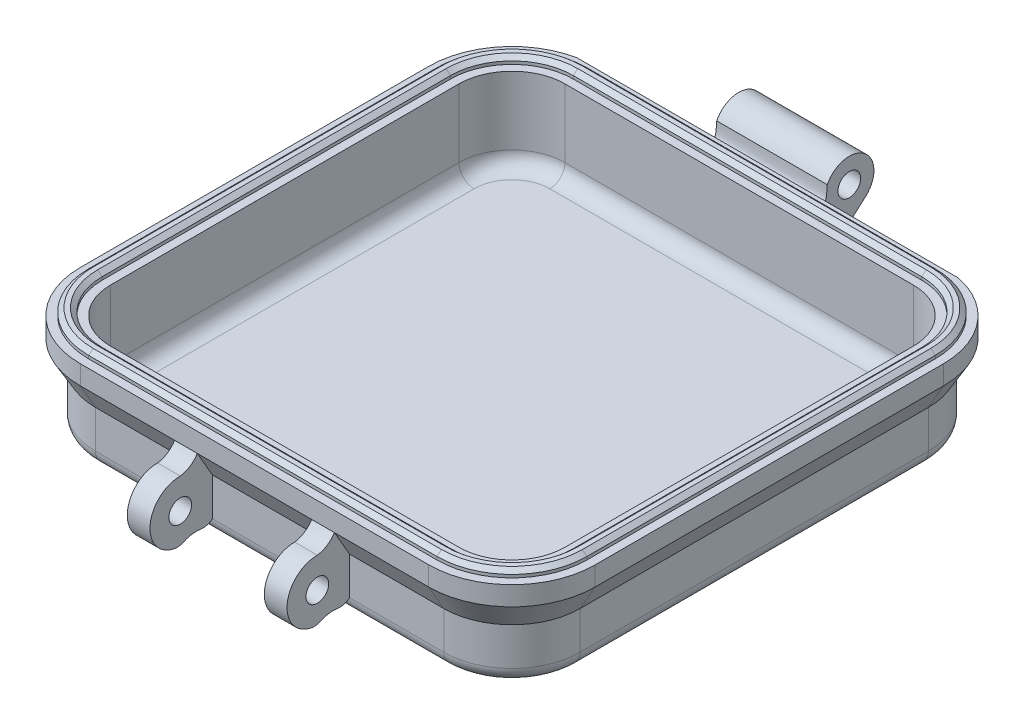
ISO-10303-21;
HEADER;
FILE_DESCRIPTION(('STEP AP214'),'2;1');
FILE_NAME('part.step','',(''),(''),'','','');
FILE_SCHEMA(('AUTOMOTIVE_DESIGN { 1 0 10303 214 1 1 1 1 }'));
ENDSEC;
DATA;
#1=APPLICATION_CONTEXT('core data for automotive mechanical design processes');
#2=APPLICATION_PROTOCOL_DEFINITION('international standard','automotive_design',2000,#1);
#3=PRODUCT_CONTEXT('',#1,'mechanical');
#4=PRODUCT('Part','Part','',(#3));
#5=PRODUCT_RELATED_PRODUCT_CATEGORY('part','',(#4));
#6=PRODUCT_DEFINITION_FORMATION('','',#4);
#7=PRODUCT_DEFINITION_CONTEXT('part definition',#1,'design');
#8=PRODUCT_DEFINITION('design','',#6,#7);
#9=PRODUCT_DEFINITION_SHAPE('','',#8);
#10=(LENGTH_UNIT() NAMED_UNIT(*) SI_UNIT(.MILLI.,.METRE.));
#11=(NAMED_UNIT(*) PLANE_ANGLE_UNIT() SI_UNIT($,.RADIAN.));
#12=(NAMED_UNIT(*) SI_UNIT($,.STERADIAN.) SOLID_ANGLE_UNIT());
#13=UNCERTAINTY_MEASURE_WITH_UNIT(LENGTH_MEASURE(1.E-05),#10,'distance_accuracy_value','');
#14=(GEOMETRIC_REPRESENTATION_CONTEXT(3) GLOBAL_UNCERTAINTY_ASSIGNED_CONTEXT((#13)) GLOBAL_UNIT_ASSIGNED_CONTEXT((#10,
#11,#12)) REPRESENTATION_CONTEXT('',''));
#15=CARTESIAN_POINT('',(0.,0.,0.));
#16=DIRECTION('',(0.,0.,1.));
#17=DIRECTION('',(1.,0.,0.));
#18=AXIS2_PLACEMENT_3D('',#15,#16,#17);
#19=CARTESIAN_POINT('',(23.,13.,-23.));
#20=DIRECTION('',(0.,1.,0.));
#21=DIRECTION('',(0.,0.,1.));
#22=AXIS2_PLACEMENT_3D('',#19,#20,#21);
#23=PLANE('',#22);
#24=DIRECTION('',(1.,0.,0.));
#25=VECTOR('',#24,1.);
#26=CARTESIAN_POINT('',(-34.,13.,-33.7782543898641));
#27=LINE('',#26,#25);
#28=CARTESIAN_POINT('',(-25.1975514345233,13.,-33.7782543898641));
#29=VERTEX_POINT('',#28);
#30=CARTESIAN_POINT('',(25.1975514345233,13.,-33.7782543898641));
#31=VERTEX_POINT('',#30);
#32=EDGE_CURVE('E2421',#29,#31,#27,.T.);
#33=ORIENTED_EDGE('',*,*,#32,.F.);
#34=CARTESIAN_POINT('',(-23.,13.,-23.));
#35=DIRECTION('',(0.,1.,0.));
#36=DIRECTION('',(0.,0.,1.));
#37=AXIS2_PLACEMENT_3D('',#34,#35,#36);
#38=CIRCLE('',#37,11.);
#39=CARTESIAN_POINT('',(-34.,13.,-23.));
#40=VERTEX_POINT('',#39);
#41=EDGE_CURVE('E972',#29,#40,#38,.T.);
#42=ORIENTED_EDGE('',*,*,#41,.T.);
#43=DIRECTION('',(0.,0.,1.));
#44=VECTOR('',#43,1.);
#45=CARTESIAN_POINT('',(-34.,13.,-23.));
#46=LINE('',#45,#44);
#47=CARTESIAN_POINT('',(-34.,13.,23.));
#48=VERTEX_POINT('',#47);
#49=EDGE_CURVE('E970',#40,#48,#46,.T.);
#50=ORIENTED_EDGE('',*,*,#49,.T.);
#51=CARTESIAN_POINT('',(-23.,13.,23.));
#52=DIRECTION('',(0.,1.,0.));
#53=DIRECTION('',(0.,0.,1.));
#54=AXIS2_PLACEMENT_3D('',#51,#52,#53);
#55=CIRCLE('',#54,11.);
#56=CARTESIAN_POINT('',(-23.,13.,34.));
#57=VERTEX_POINT('',#56);
#58=EDGE_CURVE('E968',#48,#57,#55,.T.);
#59=ORIENTED_EDGE('',*,*,#58,.T.);
#60=DIRECTION('',(1.,0.,0.));
#61=VECTOR('',#60,1.);
#62=CARTESIAN_POINT('',(-23.,13.,34.));
#63=LINE('',#62,#61);
#64=CARTESIAN_POINT('',(23.,13.,34.));
#65=VERTEX_POINT('',#64);
#66=EDGE_CURVE('E967',#57,#65,#63,.T.);
#67=ORIENTED_EDGE('',*,*,#66,.T.);
#68=CARTESIAN_POINT('',(23.,13.,23.));
#69=DIRECTION('',(0.,-1.,0.));
#70=DIRECTION('',(0.,0.,1.));
#71=AXIS2_PLACEMENT_3D('',#68,#69,#70);
#72=CIRCLE('',#71,11.);
#73=CARTESIAN_POINT('',(34.,13.,23.));
#74=VERTEX_POINT('',#73);
#75=EDGE_CURVE('E687',#74,#65,#72,.T.);
#76=ORIENTED_EDGE('',*,*,#75,.F.);
#77=DIRECTION('',(0.,0.,1.));
#78=VECTOR('',#77,1.);
#79=CARTESIAN_POINT('',(34.,13.,-23.));
#80=LINE('',#79,#78);
#81=CARTESIAN_POINT('',(34.,13.,-23.));
#82=VERTEX_POINT('',#81);
#83=EDGE_CURVE('E690',#82,#74,#80,.T.);
#84=ORIENTED_EDGE('',*,*,#83,.F.);
#85=CARTESIAN_POINT('',(23.,13.,-23.));
#86=DIRECTION('',(0.,-1.,0.));
#87=DIRECTION('',(0.,0.,1.));
#88=AXIS2_PLACEMENT_3D('',#85,#86,#87);
#89=CIRCLE('',#88,11.);
#90=EDGE_CURVE('E693',#31,#82,#89,.T.);
#91=ORIENTED_EDGE('',*,*,#90,.F.);
#92=EDGE_LOOP('',(#33,#42,#50,#59,#67,#76,#84,#91));
#93=FACE_BOUND('',#92,.T.);
#94=CARTESIAN_POINT('',(-23.,13.,-23.));
#95=DIRECTION('',(0.,1.,0.));
#96=DIRECTION('',(0.,0.,1.));
#97=AXIS2_PLACEMENT_3D('',#94,#95,#96);
#98=CIRCLE('',#97,9.9);
#99=CARTESIAN_POINT('',(-23.,13.,-32.9));
#100=VERTEX_POINT('',#99);
#101=CARTESIAN_POINT('',(-32.9,13.,-23.));
#102=VERTEX_POINT('',#101);
#103=EDGE_CURVE('E835',#100,#102,#98,.T.);
#104=ORIENTED_EDGE('',*,*,#103,.F.);
#105=DIRECTION('',(1.,0.,0.));
#106=VECTOR('',#105,1.);
#107=CARTESIAN_POINT('',(23.,13.,-32.9));
#108=LINE('',#107,#106);
#109=CARTESIAN_POINT('',(23.,13.,-32.9));
#110=VERTEX_POINT('',#109);
#111=EDGE_CURVE('E1041',#100,#110,#108,.T.);
#112=ORIENTED_EDGE('',*,*,#111,.T.);
#113=CARTESIAN_POINT('',(23.,13.,-23.));
#114=DIRECTION('',(0.,-1.,0.));
#115=DIRECTION('',(0.,0.,1.));
#116=AXIS2_PLACEMENT_3D('',#113,#114,#115);
#117=CIRCLE('',#116,9.9);
#118=CARTESIAN_POINT('',(32.9,13.,-23.));
#119=VERTEX_POINT('',#118);
#120=EDGE_CURVE('E555',#110,#119,#117,.T.);
#121=ORIENTED_EDGE('',*,*,#120,.T.);
#122=DIRECTION('',(0.,0.,1.));
#123=VECTOR('',#122,1.);
#124=CARTESIAN_POINT('',(32.9,13.,-23.));
#125=LINE('',#124,#123);
#126=CARTESIAN_POINT('',(32.9,13.,23.));
#127=VERTEX_POINT('',#126);
#128=EDGE_CURVE('E559',#119,#127,#125,.T.);
#129=ORIENTED_EDGE('',*,*,#128,.T.);
#130=CARTESIAN_POINT('',(23.,13.,23.));
#131=DIRECTION('',(0.,-1.,0.));
#132=DIRECTION('',(0.,0.,1.));
#133=AXIS2_PLACEMENT_3D('',#130,#131,#132);
#134=CIRCLE('',#133,9.9);
#135=CARTESIAN_POINT('',(23.,13.,32.9));
#136=VERTEX_POINT('',#135);
#137=EDGE_CURVE('E562',#127,#136,#134,.T.);
#138=ORIENTED_EDGE('',*,*,#137,.T.);
#139=DIRECTION('',(1.,0.,0.));
#140=VECTOR('',#139,1.);
#141=CARTESIAN_POINT('',(-23.,13.,32.9));
#142=LINE('',#141,#140);
#143=CARTESIAN_POINT('',(-23.,13.,32.9));
#144=VERTEX_POINT('',#143);
#145=EDGE_CURVE('E844',#144,#136,#142,.T.);
#146=ORIENTED_EDGE('',*,*,#145,.F.);
#147=CARTESIAN_POINT('',(-23.,13.,23.));
#148=DIRECTION('',(0.,1.,0.));
#149=DIRECTION('',(0.,0.,1.));
#150=AXIS2_PLACEMENT_3D('',#147,#148,#149);
#151=CIRCLE('',#150,9.9);
#152=CARTESIAN_POINT('',(-32.9,13.,23.));
#153=VERTEX_POINT('',#152);
#154=EDGE_CURVE('E841',#153,#144,#151,.T.);
#155=ORIENTED_EDGE('',*,*,#154,.F.);
#156=DIRECTION('',(0.,0.,1.));
#157=VECTOR('',#156,1.);
#158=CARTESIAN_POINT('',(-32.9,13.,-23.));
#159=LINE('',#158,#157);
#160=EDGE_CURVE('E838',#102,#153,#159,.T.);
#161=ORIENTED_EDGE('',*,*,#160,.F.);
#162=EDGE_LOOP('',(#104,#112,#121,#129,#138,#146,#155,#161));
#163=FACE_BOUND('',#162,.T.);
#164=ADVANCED_FACE('F38',(#93,#163),#23,.T.);
#165=CARTESIAN_POINT('',(23.,13.,-23.));
#166=DIRECTION('',(0.,1.,0.));
#167=DIRECTION('',(0.,0.,1.));
#168=AXIS2_PLACEMENT_3D('',#165,#166,#167);
#169=CIRCLE('',#168,8.1);
#170=CARTESIAN_POINT('',(31.1,13.,-23.));
#171=VERTEX_POINT('',#170);
#172=CARTESIAN_POINT('',(23.,13.,-31.1));
#173=VERTEX_POINT('',#172);
#174=EDGE_CURVE('E552',#171,#173,#169,.T.);
#175=ORIENTED_EDGE('',*,*,#174,.T.);
#176=DIRECTION('',(1.,0.,0.));
#177=VECTOR('',#176,1.);
#178=CARTESIAN_POINT('',(-23.,13.,-31.1));
#179=LINE('',#178,#177);
#180=CARTESIAN_POINT('',(-23.,13.,-31.1));
#181=VERTEX_POINT('',#180);
#182=EDGE_CURVE('E832',#181,#173,#179,.T.);
#183=ORIENTED_EDGE('',*,*,#182,.F.);
#184=CARTESIAN_POINT('',(-23.,13.,-23.));
#185=DIRECTION('',(0.,-1.,0.));
#186=DIRECTION('',(0.,0.,1.));
#187=AXIS2_PLACEMENT_3D('',#184,#185,#186);
#188=CIRCLE('',#187,8.1);
#189=CARTESIAN_POINT('',(-31.1,13.,-23.));
#190=VERTEX_POINT('',#189);
#191=EDGE_CURVE('E829',#190,#181,#188,.T.);
#192=ORIENTED_EDGE('',*,*,#191,.F.);
#193=DIRECTION('',(0.,0.,-1.));
#194=VECTOR('',#193,1.);
#195=CARTESIAN_POINT('',(-31.1,13.,-23.));
#196=LINE('',#195,#194);
#197=CARTESIAN_POINT('',(-31.1,13.,23.));
#198=VERTEX_POINT('',#197);
#199=EDGE_CURVE('E852',#198,#190,#196,.T.);
#200=ORIENTED_EDGE('',*,*,#199,.F.);
#201=CARTESIAN_POINT('',(-23.,13.,23.));
#202=DIRECTION('',(0.,-1.,0.));
#203=DIRECTION('',(0.,0.,1.));
#204=AXIS2_PLACEMENT_3D('',#201,#202,#203);
#205=CIRCLE('',#204,8.1);
#206=CARTESIAN_POINT('',(-23.,13.,31.1));
#207=VERTEX_POINT('',#206);
#208=EDGE_CURVE('E849',#207,#198,#205,.T.);
#209=ORIENTED_EDGE('',*,*,#208,.F.);
#210=DIRECTION('',(-1.,0.,0.));
#211=VECTOR('',#210,1.);
#212=CARTESIAN_POINT('',(-23.,13.,31.1));
#213=LINE('',#212,#211);
#214=CARTESIAN_POINT('',(23.,13.,31.1));
#215=VERTEX_POINT('',#214);
#216=EDGE_CURVE('E846',#215,#207,#213,.T.);
#217=ORIENTED_EDGE('',*,*,#216,.F.);
#218=CARTESIAN_POINT('',(23.,13.,23.));
#219=DIRECTION('',(0.,1.,0.));
#220=DIRECTION('',(0.,0.,1.));
#221=AXIS2_PLACEMENT_3D('',#218,#219,#220);
#222=CIRCLE('',#221,8.1);
#223=CARTESIAN_POINT('',(31.1,13.,23.));
#224=VERTEX_POINT('',#223);
#225=EDGE_CURVE('E565',#215,#224,#222,.T.);
#226=ORIENTED_EDGE('',*,*,#225,.T.);
#227=DIRECTION('',(0.,0.,-1.));
#228=VECTOR('',#227,1.);
#229=CARTESIAN_POINT('',(31.1,13.,-23.));
#230=LINE('',#229,#228);
#231=EDGE_CURVE('E568',#224,#171,#230,.T.);
#232=ORIENTED_EDGE('',*,*,#231,.T.);
#233=EDGE_LOOP('',(#175,#183,#192,#200,#209,#217,#226,#232));
#234=FACE_BOUND('',#233,.T.);
#235=DIRECTION('',(-1.,0.,0.));
#236=VECTOR('',#235,1.);
#237=CARTESIAN_POINT('',(23.,13.,-30.));
#238=LINE('',#237,#236);
#239=CARTESIAN_POINT('',(23.,13.,-30.));
#240=VERTEX_POINT('',#239);
#241=CARTESIAN_POINT('',(-23.,13.,-30.));
#242=VERTEX_POINT('',#241);
#243=EDGE_CURVE('E876',#240,#242,#238,.T.);
#244=ORIENTED_EDGE('',*,*,#243,.F.);
#245=CARTESIAN_POINT('',(23.,13.,-23.));
#246=DIRECTION('',(0.,-1.,0.));
#247=DIRECTION('',(0.,0.,1.));
#248=AXIS2_PLACEMENT_3D('',#245,#246,#247);
#249=CIRCLE('',#248,7.);
#250=CARTESIAN_POINT('',(30.,13.,-23.));
#251=VERTEX_POINT('',#250);
#252=EDGE_CURVE('E595',#240,#251,#249,.T.);
#253=ORIENTED_EDGE('',*,*,#252,.T.);
#254=DIRECTION('',(0.,0.,1.));
#255=VECTOR('',#254,1.);
#256=CARTESIAN_POINT('',(30.,13.,-23.));
#257=LINE('',#256,#255);
#258=CARTESIAN_POINT('',(30.,13.,23.));
#259=VERTEX_POINT('',#258);
#260=EDGE_CURVE('E698',#251,#259,#257,.T.);
#261=ORIENTED_EDGE('',*,*,#260,.T.);
#262=CARTESIAN_POINT('',(23.,13.,23.));
#263=DIRECTION('',(0.,-1.,0.));
#264=DIRECTION('',(0.,0.,1.));
#265=AXIS2_PLACEMENT_3D('',#262,#263,#264);
#266=CIRCLE('',#265,7.);
#267=CARTESIAN_POINT('',(23.,13.,30.));
#268=VERTEX_POINT('',#267);
#269=EDGE_CURVE('E695',#259,#268,#266,.T.);
#270=ORIENTED_EDGE('',*,*,#269,.T.);
#271=DIRECTION('',(1.,0.,0.));
#272=VECTOR('',#271,1.);
#273=CARTESIAN_POINT('',(-23.,13.,30.));
#274=LINE('',#273,#272);
#275=CARTESIAN_POINT('',(-23.,13.,30.));
#276=VERTEX_POINT('',#275);
#277=EDGE_CURVE('E974',#276,#268,#274,.T.);
#278=ORIENTED_EDGE('',*,*,#277,.F.);
#279=CARTESIAN_POINT('',(-23.,13.,23.));
#280=DIRECTION('',(0.,1.,0.));
#281=DIRECTION('',(0.,0.,1.));
#282=AXIS2_PLACEMENT_3D('',#279,#280,#281);
#283=CIRCLE('',#282,7.);
#284=CARTESIAN_POINT('',(-30.,13.,23.));
#285=VERTEX_POINT('',#284);
#286=EDGE_CURVE('E975',#285,#276,#283,.T.);
#287=ORIENTED_EDGE('',*,*,#286,.F.);
#288=DIRECTION('',(0.,0.,1.));
#289=VECTOR('',#288,1.);
#290=CARTESIAN_POINT('',(-30.,13.,-23.));
#291=LINE('',#290,#289);
#292=CARTESIAN_POINT('',(-30.,13.,-23.));
#293=VERTEX_POINT('',#292);
#294=EDGE_CURVE('E978',#293,#285,#291,.T.);
#295=ORIENTED_EDGE('',*,*,#294,.F.);
#296=CARTESIAN_POINT('',(-23.,13.,-23.));
#297=DIRECTION('',(0.,1.,0.));
#298=DIRECTION('',(0.,0.,1.));
#299=AXIS2_PLACEMENT_3D('',#296,#297,#298);
#300=CIRCLE('',#299,7.);
#301=EDGE_CURVE('E981',#242,#293,#300,.T.);
#302=ORIENTED_EDGE('',*,*,#301,.F.);
#303=EDGE_LOOP('',(#244,#253,#261,#270,#278,#287,#295,#302));
#304=FACE_BOUND('',#303,.T.);
#305=ADVANCED_FACE('F1383',(#234,#304),#23,.T.);
#306=CARTESIAN_POINT('',(-23.,0.,-23.));
#307=DIRECTION('',(0.,1.,0.));
#308=DIRECTION('',(0.,0.,1.));
#309=AXIS2_PLACEMENT_3D('',#306,#307,#308);
#310=PLANE('',#309);
#311=DIRECTION('',(-1.,0.,0.));
#312=VECTOR('',#311,1.);
#313=CARTESIAN_POINT('',(-23.,0.,-30.));
#314=LINE('',#313,#312);
#315=CARTESIAN_POINT('',(-23.,0.,-30.));
#316=VERTEX_POINT('',#315);
#317=CARTESIAN_POINT('',(23.,0.,-30.));
#318=VERTEX_POINT('',#317);
#319=EDGE_CURVE('E921',#316,#318,#314,.F.);
#320=ORIENTED_EDGE('',*,*,#319,.T.);
#321=CARTESIAN_POINT('',(23.,0.,-23.));
#322=DIRECTION('',(0.,-1.,0.));
#323=DIRECTION('',(0.,0.,1.));
#324=AXIS2_PLACEMENT_3D('',#321,#322,#323);
#325=CIRCLE('',#324,7.);
#326=CARTESIAN_POINT('',(30.,0.,-23.));
#327=VERTEX_POINT('',#326);
#328=EDGE_CURVE('E637',#327,#318,#325,.F.);
#329=ORIENTED_EDGE('',*,*,#328,.F.);
#330=DIRECTION('',(0.,0.,1.));
#331=VECTOR('',#330,1.);
#332=CARTESIAN_POINT('',(30.,0.,-23.));
#333=LINE('',#332,#331);
#334=CARTESIAN_POINT('',(30.,0.,23.));
#335=VERTEX_POINT('',#334);
#336=EDGE_CURVE('E631',#335,#327,#333,.F.);
#337=ORIENTED_EDGE('',*,*,#336,.F.);
#338=CARTESIAN_POINT('',(23.,0.,23.));
#339=DIRECTION('',(0.,-1.,0.));
#340=DIRECTION('',(0.,0.,1.));
#341=AXIS2_PLACEMENT_3D('',#338,#339,#340);
#342=CIRCLE('',#341,7.);
#343=CARTESIAN_POINT('',(23.,0.,30.));
#344=VERTEX_POINT('',#343);
#345=EDGE_CURVE('E634',#344,#335,#342,.F.);
#346=ORIENTED_EDGE('',*,*,#345,.F.);
#347=DIRECTION('',(1.,0.,0.));
#348=VECTOR('',#347,1.);
#349=CARTESIAN_POINT('',(-23.,0.,30.));
#350=LINE('',#349,#348);
#351=CARTESIAN_POINT('',(-23.,0.,30.));
#352=VERTEX_POINT('',#351);
#353=EDGE_CURVE('E917',#344,#352,#350,.F.);
#354=ORIENTED_EDGE('',*,*,#353,.T.);
#355=CARTESIAN_POINT('',(-23.,0.,23.));
#356=DIRECTION('',(0.,1.,0.));
#357=DIRECTION('',(0.,0.,1.));
#358=AXIS2_PLACEMENT_3D('',#355,#356,#357);
#359=CIRCLE('',#358,7.);
#360=CARTESIAN_POINT('',(-30.,0.,23.));
#361=VERTEX_POINT('',#360);
#362=EDGE_CURVE('E915',#352,#361,#359,.F.);
#363=ORIENTED_EDGE('',*,*,#362,.T.);
#364=DIRECTION('',(0.,0.,1.));
#365=VECTOR('',#364,1.);
#366=CARTESIAN_POINT('',(-30.,0.,-23.));
#367=LINE('',#366,#365);
#368=CARTESIAN_POINT('',(-30.,0.,-23.));
#369=VERTEX_POINT('',#368);
#370=EDGE_CURVE('E911',#361,#369,#367,.F.);
#371=ORIENTED_EDGE('',*,*,#370,.T.);
#372=CARTESIAN_POINT('',(-23.,0.,-23.));
#373=DIRECTION('',(0.,1.,0.));
#374=DIRECTION('',(0.,0.,1.));
#375=AXIS2_PLACEMENT_3D('',#372,#373,#374);
#376=CIRCLE('',#375,7.);
#377=EDGE_CURVE('E918',#369,#316,#376,.F.);
#378=ORIENTED_EDGE('',*,*,#377,.T.);
#379=EDGE_LOOP('',(#320,#329,#337,#346,#354,#363,#371,#378));
#380=FACE_BOUND('',#379,.T.);
#381=ADVANCED_FACE('F1249',(#380),#310,.F.);
#382=CARTESIAN_POINT('',(-23.,7.,32.));
#383=DIRECTION('',(0.,0.,-1.));
#384=DIRECTION('',(-1.,0.,0.));
#385=AXIS2_PLACEMENT_3D('',#382,#383,#384);
#386=PLANE('',#385);
#387=DIRECTION('',(1.,0.,0.));
#388=VECTOR('',#387,1.);
#389=CARTESIAN_POINT('',(-23.,2.,32.));
#390=LINE('',#389,#388);
#391=CARTESIAN_POINT('',(-7.55,2.,32.));
#392=VERTEX_POINT('',#391);
#393=CARTESIAN_POINT('',(7.55,2.,32.));
#394=VERTEX_POINT('',#393);
#395=EDGE_CURVE('E912',#392,#394,#390,.T.);
#396=ORIENTED_EDGE('',*,*,#395,.T.);
#397=DIRECTION('',(0.,-1.,0.));
#398=VECTOR('',#397,1.);
#399=CARTESIAN_POINT('',(7.55,0.,32.));
#400=LINE('',#399,#398);
#401=CARTESIAN_POINT('',(7.55,7.,32.));
#402=VERTEX_POINT('',#401);
#403=EDGE_CURVE('E707',#402,#394,#400,.T.);
#404=ORIENTED_EDGE('',*,*,#403,.F.);
#405=DIRECTION('',(1.,0.,0.));
#406=VECTOR('',#405,1.);
#407=CARTESIAN_POINT('',(-23.,7.,32.));
#408=LINE('',#407,#406);
#409=CARTESIAN_POINT('',(-7.55,7.,32.));
#410=VERTEX_POINT('',#409);
#411=EDGE_CURVE('E940',#410,#402,#408,.T.);
#412=ORIENTED_EDGE('',*,*,#411,.F.);
#413=DIRECTION('',(0.,-1.,0.));
#414=VECTOR('',#413,1.);
#415=CARTESIAN_POINT('',(-7.55,0.,32.));
#416=LINE('',#415,#414);
#417=EDGE_CURVE('E988',#410,#392,#416,.T.);
#418=ORIENTED_EDGE('',*,*,#417,.T.);
#419=EDGE_LOOP('',(#396,#404,#412,#418));
#420=FACE_BOUND('',#419,.T.);
#421=ADVANCED_FACE('F1197',(#420),#386,.F.);
#422=CARTESIAN_POINT('',(-23.,10.4641016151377,34.));
#423=DIRECTION('',(0.,0.500000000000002,-0.866025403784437));
#424=DIRECTION('',(1.,0.,0.));
#425=AXIS2_PLACEMENT_3D('',#422,#423,#424);
#426=PLANE('',#425);
#427=ORIENTED_EDGE('',*,*,#411,.T.);
#428=DIRECTION('',(0.,-0.866025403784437,-0.500000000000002));
#429=VECTOR('',#428,1.);
#430=CARTESIAN_POINT('',(7.55,-26.8297043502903,12.4684110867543));
#431=LINE('',#430,#429);
#432=CARTESIAN_POINT('',(7.55,10.4641016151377,34.));
#433=VERTEX_POINT('',#432);
#434=EDGE_CURVE('E703',#402,#433,#431,.F.);
#435=ORIENTED_EDGE('',*,*,#434,.T.);
#436=DIRECTION('',(1.,0.,0.));
#437=VECTOR('',#436,1.);
#438=CARTESIAN_POINT('',(-23.,10.4641016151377,34.));
#439=LINE('',#438,#437);
#440=CARTESIAN_POINT('',(-7.55,10.4641016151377,34.));
#441=VERTEX_POINT('',#440);
#442=EDGE_CURVE('E891',#441,#433,#439,.T.);
#443=ORIENTED_EDGE('',*,*,#442,.F.);
#444=DIRECTION('',(0.,-0.866025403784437,-0.500000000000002));
#445=VECTOR('',#444,1.);
#446=CARTESIAN_POINT('',(-7.55,-26.8297043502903,12.4684110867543));
#447=LINE('',#446,#445);
#448=EDGE_CURVE('E984',#410,#441,#447,.F.);
#449=ORIENTED_EDGE('',*,*,#448,.F.);
#450=EDGE_LOOP('',(#427,#435,#443,#449));
#451=FACE_BOUND('',#450,.T.);
#452=ADVANCED_FACE('F1304',(#451),#426,.F.);
#453=CARTESIAN_POINT('',(-23.,2.,30.));
#454=DIRECTION('',(1.,0.,0.));
#455=DIRECTION('',(0.,0.,-1.));
#456=AXIS2_PLACEMENT_3D('',#453,#454,#455);
#457=CYLINDRICAL_SURFACE('',#456,2.);
#458=ORIENTED_EDGE('',*,*,#353,.F.);
#459=CARTESIAN_POINT('',(23.,2.,30.));
#460=DIRECTION('',(-1.,0.,0.));
#461=DIRECTION('',(0.,0.,1.));
#462=AXIS2_PLACEMENT_3D('',#459,#460,#461);
#463=CIRCLE('',#462,2.);
#464=CARTESIAN_POINT('',(23.,2.,32.));
#465=VERTEX_POINT('',#464);
#466=EDGE_CURVE('E616',#344,#465,#463,.T.);
#467=ORIENTED_EDGE('',*,*,#466,.T.);
#468=DIRECTION('',(-1.,0.,0.));
#469=VECTOR('',#468,1.);
#470=CARTESIAN_POINT('',(23.,2.,32.));
#471=LINE('',#470,#469);
#472=CARTESIAN_POINT('',(10.55,2.,32.));
#473=VERTEX_POINT('',#472);
#474=EDGE_CURVE('E628',#465,#473,#471,.T.);
#475=ORIENTED_EDGE('',*,*,#474,.T.);
#476=DIRECTION('',(1.,0.,0.));
#477=VECTOR('',#476,1.);
#478=CARTESIAN_POINT('',(-34.,2.00000000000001,32.));
#479=LINE('',#478,#477);
#480=EDGE_CURVE('E738',#394,#473,#479,.T.);
#481=ORIENTED_EDGE('',*,*,#480,.F.);
#482=ORIENTED_EDGE('',*,*,#395,.F.);
#483=DIRECTION('',(-1.,0.,0.));
#484=VECTOR('',#483,1.);
#485=CARTESIAN_POINT('',(34.,2.00000000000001,32.));
#486=LINE('',#485,#484);
#487=CARTESIAN_POINT('',(-10.55,2.,32.));
#488=VERTEX_POINT('',#487);
#489=EDGE_CURVE('E1016',#392,#488,#486,.T.);
#490=ORIENTED_EDGE('',*,*,#489,.T.);
#491=CARTESIAN_POINT('',(-23.,2.,32.));
#492=VERTEX_POINT('',#491);
#493=EDGE_CURVE('E1023',#492,#488,#390,.T.);
#494=ORIENTED_EDGE('',*,*,#493,.F.);
#495=CARTESIAN_POINT('',(-23.,2.,30.));
#496=DIRECTION('',(-1.,0.,0.));
#497=DIRECTION('',(0.,0.,1.));
#498=AXIS2_PLACEMENT_3D('',#495,#496,#497);
#499=CIRCLE('',#498,2.);
#500=EDGE_CURVE('E897',#352,#492,#499,.T.);
#501=ORIENTED_EDGE('',*,*,#500,.F.);
#502=EDGE_LOOP('',(#458,#467,#475,#481,#482,#490,#494,#501));
#503=FACE_BOUND('',#502,.T.);
#504=ADVANCED_FACE('F1201',(#503),#457,.T.);
#505=CARTESIAN_POINT('',(-23.,13.,34.));
#506=DIRECTION('',(0.,0.,-1.));
#507=DIRECTION('',(-1.,0.,0.));
#508=AXIS2_PLACEMENT_3D('',#505,#506,#507);
#509=PLANE('',#508);
#510=ORIENTED_EDGE('',*,*,#442,.T.);
#511=DIRECTION('',(1.,0.,0.));
#512=VECTOR('',#511,1.);
#513=CARTESIAN_POINT('',(-34.,10.4641016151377,34.));
#514=LINE('',#513,#512);
#515=CARTESIAN_POINT('',(10.55,10.4641016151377,34.));
#516=VERTEX_POINT('',#515);
#517=EDGE_CURVE('E753',#433,#516,#514,.T.);
#518=ORIENTED_EDGE('',*,*,#517,.T.);
#519=DIRECTION('',(-1.,0.,0.));
#520=VECTOR('',#519,1.);
#521=CARTESIAN_POINT('',(23.,10.4641016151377,34.));
#522=LINE('',#521,#520);
#523=CARTESIAN_POINT('',(23.,10.4641016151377,34.));
#524=VERTEX_POINT('',#523);
#525=EDGE_CURVE('E605',#524,#516,#522,.T.);
#526=ORIENTED_EDGE('',*,*,#525,.F.);
#527=DIRECTION('',(0.,-1.,0.));
#528=VECTOR('',#527,1.);
#529=CARTESIAN_POINT('',(23.,13.,34.));
#530=LINE('',#529,#528);
#531=EDGE_CURVE('E684',#65,#524,#530,.T.);
#532=ORIENTED_EDGE('',*,*,#531,.F.);
#533=ORIENTED_EDGE('',*,*,#66,.F.);
#534=DIRECTION('',(0.,-1.,0.));
#535=VECTOR('',#534,1.);
#536=CARTESIAN_POINT('',(-23.,13.,34.));
#537=LINE('',#536,#535);
#538=CARTESIAN_POINT('',(-23.,10.4641016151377,34.));
#539=VERTEX_POINT('',#538);
#540=EDGE_CURVE('E964',#57,#539,#537,.T.);
#541=ORIENTED_EDGE('',*,*,#540,.T.);
#542=CARTESIAN_POINT('',(-10.55,10.4641016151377,34.));
#543=VERTEX_POINT('',#542);
#544=EDGE_CURVE('E887',#539,#543,#439,.T.);
#545=ORIENTED_EDGE('',*,*,#544,.T.);
#546=DIRECTION('',(-1.,0.,0.));
#547=VECTOR('',#546,1.);
#548=CARTESIAN_POINT('',(34.,10.4641016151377,34.));
#549=LINE('',#548,#547);
#550=EDGE_CURVE('E1039',#441,#543,#549,.T.);
#551=ORIENTED_EDGE('',*,*,#550,.F.);
#552=EDGE_LOOP('',(#510,#518,#526,#532,#533,#541,#545,#551));
#553=FACE_BOUND('',#552,.T.);
#554=ADVANCED_FACE('F1224',(#553),#509,.F.);
#555=CARTESIAN_POINT('',(-23.,2.,-23.));
#556=DIRECTION('',(0.,1.,0.));
#557=DIRECTION('',(0.,0.,1.));
#558=AXIS2_PLACEMENT_3D('',#555,#556,#557);
#559=PLANE('',#558);
#560=DIRECTION('',(0.,0.,-1.));
#561=VECTOR('',#560,1.);
#562=CARTESIAN_POINT('',(-28.,2.,23.));
#563=LINE('',#562,#561);
#564=CARTESIAN_POINT('',(-28.,2.,-23.));
#565=VERTEX_POINT('',#564);
#566=CARTESIAN_POINT('',(-28.,2.,23.));
#567=VERTEX_POINT('',#566);
#568=EDGE_CURVE('E1118',#565,#567,#563,.F.);
#569=ORIENTED_EDGE('',*,*,#568,.T.);
#570=CARTESIAN_POINT('',(-23.,2.,23.));
#571=DIRECTION('',(0.,1.,0.));
#572=DIRECTION('',(0.,0.,1.));
#573=AXIS2_PLACEMENT_3D('',#570,#571,#572);
#574=CIRCLE('',#573,5.);
#575=CARTESIAN_POINT('',(-23.,2.,28.));
#576=VERTEX_POINT('',#575);
#577=EDGE_CURVE('E1120',#567,#576,#574,.T.);
#578=ORIENTED_EDGE('',*,*,#577,.T.);
#579=DIRECTION('',(1.,0.,0.));
#580=VECTOR('',#579,1.);
#581=CARTESIAN_POINT('',(23.,2.,28.));
#582=LINE('',#581,#580);
#583=CARTESIAN_POINT('',(23.,2.,28.));
#584=VERTEX_POINT('',#583);
#585=EDGE_CURVE('E526',#576,#584,#582,.T.);
#586=ORIENTED_EDGE('',*,*,#585,.T.);
#587=CARTESIAN_POINT('',(23.,2.,23.));
#588=DIRECTION('',(0.,1.,0.));
#589=DIRECTION('',(0.,0.,1.));
#590=AXIS2_PLACEMENT_3D('',#587,#588,#589);
#591=CIRCLE('',#590,5.);
#592=CARTESIAN_POINT('',(28.,2.,23.));
#593=VERTEX_POINT('',#592);
#594=EDGE_CURVE('E1108',#584,#593,#591,.T.);
#595=ORIENTED_EDGE('',*,*,#594,.T.);
#596=DIRECTION('',(0.,0.,-1.));
#597=VECTOR('',#596,1.);
#598=CARTESIAN_POINT('',(28.,2.,-23.));
#599=LINE('',#598,#597);
#600=CARTESIAN_POINT('',(28.,2.,-23.));
#601=VERTEX_POINT('',#600);
#602=EDGE_CURVE('E1110',#593,#601,#599,.T.);
#603=ORIENTED_EDGE('',*,*,#602,.T.);
#604=CARTESIAN_POINT('',(23.,2.,-23.));
#605=DIRECTION('',(0.,1.,0.));
#606=DIRECTION('',(0.,0.,1.));
#607=AXIS2_PLACEMENT_3D('',#604,#605,#606);
#608=CIRCLE('',#607,5.);
#609=CARTESIAN_POINT('',(23.,2.,-28.));
#610=VERTEX_POINT('',#609);
#611=EDGE_CURVE('E1112',#601,#610,#608,.T.);
#612=ORIENTED_EDGE('',*,*,#611,.T.);
#613=DIRECTION('',(1.,0.,0.));
#614=VECTOR('',#613,1.);
#615=CARTESIAN_POINT('',(-23.,2.,-28.));
#616=LINE('',#615,#614);
#617=CARTESIAN_POINT('',(-23.,2.,-28.));
#618=VERTEX_POINT('',#617);
#619=EDGE_CURVE('E1114',#610,#618,#616,.F.);
#620=ORIENTED_EDGE('',*,*,#619,.T.);
#621=CARTESIAN_POINT('',(-23.,2.,-23.));
#622=DIRECTION('',(0.,1.,0.));
#623=DIRECTION('',(0.,0.,1.));
#624=AXIS2_PLACEMENT_3D('',#621,#622,#623);
#625=CIRCLE('',#624,5.);
#626=EDGE_CURVE('E1116',#618,#565,#625,.T.);
#627=ORIENTED_EDGE('',*,*,#626,.T.);
#628=EDGE_LOOP('',(#569,#578,#586,#595,#603,#612,#620,#627));
#629=FACE_BOUND('',#628,.T.);
#630=ADVANCED_FACE('F1396',(#629),#559,.T.);
#631=CARTESIAN_POINT('',(-23.,7.,30.));
#632=DIRECTION('',(0.,0.,-1.));
#633=DIRECTION('',(-1.,0.,0.));
#634=AXIS2_PLACEMENT_3D('',#631,#632,#633);
#635=PLANE('',#634);
#636=DIRECTION('',(0.,1.,0.));
#637=VECTOR('',#636,1.);
#638=CARTESIAN_POINT('',(23.,7.,30.));
#639=LINE('',#638,#637);
#640=CARTESIAN_POINT('',(23.,4.,30.));
#641=VERTEX_POINT('',#640);
#642=EDGE_CURVE('E665',#268,#641,#639,.F.);
#643=ORIENTED_EDGE('',*,*,#642,.T.);
#644=DIRECTION('',(1.,0.,0.));
#645=VECTOR('',#644,1.);
#646=CARTESIAN_POINT('',(-23.,4.,30.));
#647=LINE('',#646,#645);
#648=CARTESIAN_POINT('',(-23.,4.,30.));
#649=VERTEX_POINT('',#648);
#650=EDGE_CURVE('E1138',#641,#649,#647,.F.);
#651=ORIENTED_EDGE('',*,*,#650,.T.);
#652=DIRECTION('',(0.,1.,0.));
#653=VECTOR('',#652,1.);
#654=CARTESIAN_POINT('',(-23.,7.,30.));
#655=LINE('',#654,#653);
#656=EDGE_CURVE('E945',#276,#649,#655,.F.);
#657=ORIENTED_EDGE('',*,*,#656,.F.);
#658=ORIENTED_EDGE('',*,*,#277,.T.);
#659=EDGE_LOOP('',(#643,#651,#657,#658));
#660=FACE_BOUND('',#659,.T.);
#661=ADVANCED_FACE('F1399',(#660),#635,.T.);
#662=CARTESIAN_POINT('',(-23.,7.,-30.));
#663=DIRECTION('',(0.,0.,1.));
#664=DIRECTION('',(1.,0.,0.));
#665=AXIS2_PLACEMENT_3D('',#662,#663,#664);
#666=PLANE('',#665);
#667=DIRECTION('',(0.,-1.,0.));
#668=VECTOR('',#667,1.);
#669=CARTESIAN_POINT('',(-23.,7.,-30.));
#670=LINE('',#669,#668);
#671=CARTESIAN_POINT('',(-23.,4.,-30.));
#672=VERTEX_POINT('',#671);
#673=EDGE_CURVE('E948',#242,#672,#670,.T.);
#674=ORIENTED_EDGE('',*,*,#673,.T.);
#675=DIRECTION('',(1.,0.,0.));
#676=VECTOR('',#675,1.);
#677=CARTESIAN_POINT('',(23.,4.,-30.));
#678=LINE('',#677,#676);
#679=CARTESIAN_POINT('',(23.,4.,-30.));
#680=VERTEX_POINT('',#679);
#681=EDGE_CURVE('E1130',#672,#680,#678,.T.);
#682=ORIENTED_EDGE('',*,*,#681,.T.);
#683=DIRECTION('',(0.,-1.,0.));
#684=VECTOR('',#683,1.);
#685=CARTESIAN_POINT('',(23.,7.,-30.));
#686=LINE('',#685,#684);
#687=EDGE_CURVE('E668',#240,#680,#686,.T.);
#688=ORIENTED_EDGE('',*,*,#687,.F.);
#689=ORIENTED_EDGE('',*,*,#243,.T.);
#690=EDGE_LOOP('',(#674,#682,#688,#689));
#691=FACE_BOUND('',#690,.T.);
#692=ADVANCED_FACE('F1395',(#691),#666,.T.);
#693=CARTESIAN_POINT('',(-8.7672209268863,13.,-37.25));
#694=DIRECTION('',(1.,0.,0.));
#695=DIRECTION('',(0.,1.,0.));
#696=AXIS2_PLACEMENT_3D('',#693,#694,#695);
#697=CYLINDRICAL_SURFACE('',#696,3.25);
#698=DIRECTION('',(1.,0.,0.));
#699=VECTOR('',#698,1.);
#700=CARTESIAN_POINT('',(-34.,14.4496907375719,-34.3412379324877));
#701=LINE('',#700,#699);
#702=CARTESIAN_POINT('',(7.30000000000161,14.4496907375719,-34.3412379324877));
#703=VERTEX_POINT('',#702);
#704=CARTESIAN_POINT('',(-7.30000000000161,14.4496907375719,-34.3412379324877));
#705=VERTEX_POINT('',#704);
#706=EDGE_CURVE('E519',#703,#705,#701,.F.);
#707=ORIENTED_EDGE('',*,*,#706,.F.);
#708=CARTESIAN_POINT('',(7.30000000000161,13.,-37.25));
#709=DIRECTION('',(-1.,0.,0.));
#710=DIRECTION('',(0.,-1.,0.));
#711=AXIS2_PLACEMENT_3D('',#708,#709,#710);
#712=CIRCLE('',#711,3.25);
#713=CARTESIAN_POINT('',(7.3000000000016,10.568473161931,-39.4064269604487));
#714=VERTEX_POINT('',#713);
#715=EDGE_CURVE('E533',#703,#714,#712,.T.);
#716=ORIENTED_EDGE('',*,*,#715,.T.);
#717=DIRECTION('',(1.,0.,0.));
#718=VECTOR('',#717,1.);
#719=CARTESIAN_POINT('',(-7.3000000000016,10.568473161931,-39.4064269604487));
#720=LINE('',#719,#718);
#721=CARTESIAN_POINT('',(-7.3000000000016,10.568473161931,-39.4064269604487));
#722=VERTEX_POINT('',#721);
#723=EDGE_CURVE('E823',#722,#714,#720,.T.);
#724=ORIENTED_EDGE('',*,*,#723,.F.);
#725=CARTESIAN_POINT('',(-7.30000000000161,13.,-37.25));
#726=DIRECTION('',(-1.,0.,0.));
#727=DIRECTION('',(0.,-1.,0.));
#728=AXIS2_PLACEMENT_3D('',#725,#726,#727);
#729=CIRCLE('',#728,3.25);
#730=EDGE_CURVE('E535',#705,#722,#729,.T.);
#731=ORIENTED_EDGE('',*,*,#730,.F.);
#732=EDGE_LOOP('',(#707,#716,#724,#731));
#733=FACE_BOUND('',#732,.T.);
#734=ADVANCED_FACE('F531',(#733),#697,.T.);
#735=CARTESIAN_POINT('',(-34.,13.,-37.25));
#736=DIRECTION('',(1.,0.,0.));
#737=DIRECTION('',(0.,0.,-1.));
#738=AXIS2_PLACEMENT_3D('',#735,#736,#737);
#739=CYLINDRICAL_SURFACE('',#738,1.5);
#740=CARTESIAN_POINT('',(-7.30000000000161,13.,-37.25));
#741=DIRECTION('',(-1.,0.,0.));
#742=DIRECTION('',(0.,-1.,0.));
#743=AXIS2_PLACEMENT_3D('',#740,#741,#742);
#744=CIRCLE('',#743,1.5);
#745=CARTESIAN_POINT('',(-7.3000000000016,11.5,-37.25));
#746=VERTEX_POINT('',#745);
#747=EDGE_CURVE('E813',#746,#746,#744,.T.);
#748=ORIENTED_EDGE('',*,*,#747,.T.);
#749=EDGE_LOOP('',(#748));
#750=FACE_BOUND('',#749,.T.);
#751=CARTESIAN_POINT('',(7.30000000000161,13.,-37.25));
#752=DIRECTION('',(-1.,0.,0.));
#753=DIRECTION('',(0.,-1.,0.));
#754=AXIS2_PLACEMENT_3D('',#751,#752,#753);
#755=CIRCLE('',#754,1.5);
#756=CARTESIAN_POINT('',(7.3000000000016,11.5,-37.25));
#757=VERTEX_POINT('',#756);
#758=EDGE_CURVE('E2420',#757,#757,#755,.T.);
#759=ORIENTED_EDGE('',*,*,#758,.F.);
#760=EDGE_LOOP('',(#759));
#761=FACE_BOUND('',#760,.T.);
#762=ADVANCED_FACE('F1391',(#750,#761),#739,.F.);
#763=CARTESIAN_POINT('',(-23.,7.,-23.));
#764=DIRECTION('',(0.,-1.,0.));
#765=DIRECTION('',(0.,0.,-1.));
#766=AXIS2_PLACEMENT_3D('',#763,#764,#765);
#767=CYLINDRICAL_SURFACE('',#766,9.);
#768=DIRECTION('',(0.,-1.,0.));
#769=VECTOR('',#768,1.);
#770=CARTESIAN_POINT('',(-23.,7.,-32.));
#771=LINE('',#770,#769);
#772=CARTESIAN_POINT('',(-23.,7.,-32.));
#773=VERTEX_POINT('',#772);
#774=CARTESIAN_POINT('',(-23.,2.,-32.));
#775=VERTEX_POINT('',#774);
#776=EDGE_CURVE('E933',#773,#775,#771,.T.);
#777=ORIENTED_EDGE('',*,*,#776,.T.);
#778=CARTESIAN_POINT('',(-23.,2.,-23.));
#779=DIRECTION('',(0.,1.,0.));
#780=DIRECTION('',(0.,0.,1.));
#781=AXIS2_PLACEMENT_3D('',#778,#779,#780);
#782=CIRCLE('',#781,9.);
#783=CARTESIAN_POINT('',(-32.,2.,-23.));
#784=VERTEX_POINT('',#783);
#785=EDGE_CURVE('E906',#775,#784,#782,.T.);
#786=ORIENTED_EDGE('',*,*,#785,.T.);
#787=DIRECTION('',(0.,-1.,0.));
#788=VECTOR('',#787,1.);
#789=CARTESIAN_POINT('',(-32.,7.,-23.));
#790=LINE('',#789,#788);
#791=CARTESIAN_POINT('',(-32.,7.,-23.));
#792=VERTEX_POINT('',#791);
#793=EDGE_CURVE('E924',#792,#784,#790,.T.);
#794=ORIENTED_EDGE('',*,*,#793,.F.);
#795=CARTESIAN_POINT('',(-23.,7.,-23.));
#796=DIRECTION('',(0.,1.,0.));
#797=DIRECTION('',(0.,0.,1.));
#798=AXIS2_PLACEMENT_3D('',#795,#796,#797);
#799=CIRCLE('',#798,9.);
#800=EDGE_CURVE('E898',#773,#792,#799,.T.);
#801=ORIENTED_EDGE('',*,*,#800,.F.);
#802=EDGE_LOOP('',(#777,#786,#794,#801));
#803=FACE_BOUND('',#802,.T.);
#804=ADVANCED_FACE('F1340',(#803),#767,.T.);
#805=CARTESIAN_POINT('',(-32.,7.,23.));
#806=DIRECTION('',(1.,0.,0.));
#807=DIRECTION('',(0.,0.,-1.));
#808=AXIS2_PLACEMENT_3D('',#805,#806,#807);
#809=PLANE('',#808);
#810=ORIENTED_EDGE('',*,*,#793,.T.);
#811=DIRECTION('',(0.,0.,1.));
#812=VECTOR('',#811,1.);
#813=CARTESIAN_POINT('',(-32.,2.,23.));
#814=LINE('',#813,#812);
#815=CARTESIAN_POINT('',(-32.,2.,23.));
#816=VERTEX_POINT('',#815);
#817=EDGE_CURVE('E920',#784,#816,#814,.T.);
#818=ORIENTED_EDGE('',*,*,#817,.T.);
#819=DIRECTION('',(0.,-1.,0.));
#820=VECTOR('',#819,1.);
#821=CARTESIAN_POINT('',(-32.,7.,23.));
#822=LINE('',#821,#820);
#823=CARTESIAN_POINT('',(-32.,7.,23.));
#824=VERTEX_POINT('',#823);
#825=EDGE_CURVE('E927',#824,#816,#822,.T.);
#826=ORIENTED_EDGE('',*,*,#825,.F.);
#827=DIRECTION('',(0.,0.,1.));
#828=VECTOR('',#827,1.);
#829=CARTESIAN_POINT('',(-32.,7.,23.));
#830=LINE('',#829,#828);
#831=EDGE_CURVE('E939',#792,#824,#830,.T.);
#832=ORIENTED_EDGE('',*,*,#831,.F.);
#833=EDGE_LOOP('',(#810,#818,#826,#832));
#834=FACE_BOUND('',#833,.T.);
#835=ADVANCED_FACE('F2230',(#834),#809,.F.);
#836=CARTESIAN_POINT('',(-23.,7.,23.));
#837=DIRECTION('',(0.,-1.,0.));
#838=DIRECTION('',(0.,0.,-1.));
#839=AXIS2_PLACEMENT_3D('',#836,#837,#838);
#840=CYLINDRICAL_SURFACE('',#839,9.);
#841=ORIENTED_EDGE('',*,*,#825,.T.);
#842=CARTESIAN_POINT('',(-23.,2.,23.));
#843=DIRECTION('',(0.,1.,0.));
#844=DIRECTION('',(0.,0.,1.));
#845=AXIS2_PLACEMENT_3D('',#842,#843,#844);
#846=CIRCLE('',#845,9.);
#847=EDGE_CURVE('E909',#816,#492,#846,.T.);
#848=ORIENTED_EDGE('',*,*,#847,.T.);
#849=DIRECTION('',(0.,-1.,0.));
#850=VECTOR('',#849,1.);
#851=CARTESIAN_POINT('',(-23.,7.,32.));
#852=LINE('',#851,#850);
#853=CARTESIAN_POINT('',(-23.,7.,32.));
#854=VERTEX_POINT('',#853);
#855=EDGE_CURVE('E930',#854,#492,#852,.T.);
#856=ORIENTED_EDGE('',*,*,#855,.F.);
#857=CARTESIAN_POINT('',(-23.,7.,23.));
#858=DIRECTION('',(0.,1.,0.));
#859=DIRECTION('',(0.,0.,1.));
#860=AXIS2_PLACEMENT_3D('',#857,#858,#859);
#861=CIRCLE('',#860,9.);
#862=EDGE_CURVE('E936',#824,#854,#861,.T.);
#863=ORIENTED_EDGE('',*,*,#862,.F.);
#864=EDGE_LOOP('',(#841,#848,#856,#863));
#865=FACE_BOUND('',#864,.T.);
#866=ADVANCED_FACE('F1238',(#865),#840,.T.);
#867=ORIENTED_EDGE('',*,*,#493,.T.);
#868=DIRECTION('',(0.,-1.,0.));
#869=VECTOR('',#868,1.);
#870=CARTESIAN_POINT('',(-10.55,0.,32.));
#871=LINE('',#870,#869);
#872=CARTESIAN_POINT('',(-10.55,7.,32.));
#873=VERTEX_POINT('',#872);
#874=EDGE_CURVE('E987',#873,#488,#871,.T.);
#875=ORIENTED_EDGE('',*,*,#874,.F.);
#876=EDGE_CURVE('E1029',#854,#873,#408,.T.);
#877=ORIENTED_EDGE('',*,*,#876,.F.);
#878=ORIENTED_EDGE('',*,*,#855,.T.);
#879=EDGE_LOOP('',(#867,#875,#877,#878));
#880=FACE_BOUND('',#879,.T.);
#881=ADVANCED_FACE('F1241',(#880),#386,.F.);
#882=CARTESIAN_POINT('',(-23.,7.,-32.));
#883=DIRECTION('',(0.,0.,1.));
#884=DIRECTION('',(1.,0.,0.));
#885=AXIS2_PLACEMENT_3D('',#882,#883,#884);
#886=PLANE('',#885);
#887=DIRECTION('',(0.,-1.,0.));
#888=VECTOR('',#887,1.);
#889=CARTESIAN_POINT('',(-7.29999999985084,-291552.47636288,-31.9999999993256));
#890=LINE('',#889,#888);
#891=CARTESIAN_POINT('',(-7.3000000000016,7.,-32.));
#892=VERTEX_POINT('',#891);
#893=CARTESIAN_POINT('',(-7.3000000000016,3.99999999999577,-32.));
#894=VERTEX_POINT('',#893);
#895=EDGE_CURVE('E816',#892,#894,#890,.T.);
#896=ORIENTED_EDGE('',*,*,#895,.T.);
#897=DIRECTION('',(1.,0.,0.));
#898=VECTOR('',#897,1.);
#899=CARTESIAN_POINT('',(-7.3000000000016,4.0000000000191,-32.0000000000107));
#900=LINE('',#899,#898);
#901=CARTESIAN_POINT('',(7.3000000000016,3.99999999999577,-32.));
#902=VERTEX_POINT('',#901);
#903=EDGE_CURVE('E822',#894,#902,#900,.T.);
#904=ORIENTED_EDGE('',*,*,#903,.T.);
#905=DIRECTION('',(0.,-1.,0.));
#906=VECTOR('',#905,1.);
#907=CARTESIAN_POINT('',(7.29999999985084,-291552.47636288,-31.9999999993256));
#908=LINE('',#907,#906);
#909=CARTESIAN_POINT('',(7.3000000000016,7.,-32.));
#910=VERTEX_POINT('',#909);
#911=EDGE_CURVE('E548',#910,#902,#908,.T.);
#912=ORIENTED_EDGE('',*,*,#911,.F.);
#913=DIRECTION('',(1.,0.,0.));
#914=VECTOR('',#913,1.);
#915=CARTESIAN_POINT('',(23.,7.,-32.));
#916=LINE('',#915,#914);
#917=CARTESIAN_POINT('',(23.,7.,-32.));
#918=VERTEX_POINT('',#917);
#919=EDGE_CURVE('E655',#910,#918,#916,.T.);
#920=ORIENTED_EDGE('',*,*,#919,.T.);
#921=DIRECTION('',(0.,-1.,0.));
#922=VECTOR('',#921,1.);
#923=CARTESIAN_POINT('',(23.,7.,-32.));
#924=LINE('',#923,#922);
#925=CARTESIAN_POINT('',(23.,2.,-32.));
#926=VERTEX_POINT('',#925);
#927=EDGE_CURVE('E652',#918,#926,#924,.T.);
#928=ORIENTED_EDGE('',*,*,#927,.T.);
#929=DIRECTION('',(-1.,0.,0.));
#930=VECTOR('',#929,1.);
#931=CARTESIAN_POINT('',(-23.,2.,-32.));
#932=LINE('',#931,#930);
#933=EDGE_CURVE('E908',#926,#775,#932,.T.);
#934=ORIENTED_EDGE('',*,*,#933,.T.);
#935=ORIENTED_EDGE('',*,*,#776,.F.);
#936=DIRECTION('',(-1.,0.,0.));
#937=VECTOR('',#936,1.);
#938=CARTESIAN_POINT('',(-23.,7.,-32.));
#939=LINE('',#938,#937);
#940=EDGE_CURVE('E935',#892,#773,#939,.T.);
#941=ORIENTED_EDGE('',*,*,#940,.F.);
#942=EDGE_LOOP('',(#896,#904,#912,#920,#928,#934,#935,#941));
#943=FACE_BOUND('',#942,.T.);
#944=ADVANCED_FACE('F1343',(#943),#886,.F.);
#945=CARTESIAN_POINT('',(-23.,2.,-30.));
#946=DIRECTION('',(-1.,0.,0.));
#947=DIRECTION('',(0.,0.,1.));
#948=AXIS2_PLACEMENT_3D('',#945,#946,#947);
#949=CYLINDRICAL_SURFACE('',#948,2.);
#950=ORIENTED_EDGE('',*,*,#933,.F.);
#951=CARTESIAN_POINT('',(23.,2.,-30.));
#952=DIRECTION('',(-1.,0.,0.));
#953=DIRECTION('',(0.,0.,1.));
#954=AXIS2_PLACEMENT_3D('',#951,#952,#953);
#955=CIRCLE('',#954,2.);
#956=EDGE_CURVE('E613',#926,#318,#955,.T.);
#957=ORIENTED_EDGE('',*,*,#956,.T.);
#958=ORIENTED_EDGE('',*,*,#319,.F.);
#959=CARTESIAN_POINT('',(-23.,2.,-30.));
#960=DIRECTION('',(-1.,0.,0.));
#961=DIRECTION('',(0.,0.,1.));
#962=AXIS2_PLACEMENT_3D('',#959,#960,#961);
#963=CIRCLE('',#962,2.);
#964=EDGE_CURVE('E894',#775,#316,#963,.T.);
#965=ORIENTED_EDGE('',*,*,#964,.F.);
#966=EDGE_LOOP('',(#950,#957,#958,#965));
#967=FACE_BOUND('',#966,.T.);
#968=ADVANCED_FACE('F1263',(#967),#949,.T.);
#969=CARTESIAN_POINT('',(-23.,2.,-23.));
#970=DIRECTION('',(0.,1.,0.));
#971=DIRECTION('',(0.,0.,1.));
#972=AXIS2_PLACEMENT_3D('',#969,#970,#971);
#973=TOROIDAL_SURFACE('',#972,7.,2.);
#974=ORIENTED_EDGE('',*,*,#964,.T.);
#975=ORIENTED_EDGE('',*,*,#377,.F.);
#976=CARTESIAN_POINT('',(-30.,2.,-23.));
#977=DIRECTION('',(0.,0.,1.));
#978=DIRECTION('',(1.,0.,0.));
#979=AXIS2_PLACEMENT_3D('',#976,#977,#978);
#980=CIRCLE('',#979,2.);
#981=EDGE_CURVE('E901',#784,#369,#980,.T.);
#982=ORIENTED_EDGE('',*,*,#981,.F.);
#983=ORIENTED_EDGE('',*,*,#785,.F.);
#984=EDGE_LOOP('',(#974,#975,#982,#983));
#985=FACE_BOUND('',#984,.T.);
#986=ADVANCED_FACE('F1258',(#985),#973,.T.);
#987=CARTESIAN_POINT('',(-23.,2.,23.));
#988=DIRECTION('',(0.,1.,0.));
#989=DIRECTION('',(0.,0.,1.));
#990=AXIS2_PLACEMENT_3D('',#987,#988,#989);
#991=TOROIDAL_SURFACE('',#990,7.,2.);
#992=ORIENTED_EDGE('',*,*,#500,.T.);
#993=ORIENTED_EDGE('',*,*,#847,.F.);
#994=CARTESIAN_POINT('',(-30.,2.,23.));
#995=DIRECTION('',(0.,0.,-1.));
#996=DIRECTION('',(-1.,0.,0.));
#997=AXIS2_PLACEMENT_3D('',#994,#995,#996);
#998=CIRCLE('',#997,2.);
#999=EDGE_CURVE('E903',#361,#816,#998,.T.);
#1000=ORIENTED_EDGE('',*,*,#999,.F.);
#1001=ORIENTED_EDGE('',*,*,#362,.F.);
#1002=EDGE_LOOP('',(#992,#993,#1000,#1001));
#1003=FACE_BOUND('',#1002,.T.);
#1004=ADVANCED_FACE('F1245',(#1003),#991,.T.);
#1005=CARTESIAN_POINT('',(-30.,2.,23.));
#1006=DIRECTION('',(0.,0.,1.));
#1007=DIRECTION('',(1.,0.,0.));
#1008=AXIS2_PLACEMENT_3D('',#1005,#1006,#1007);
#1009=CYLINDRICAL_SURFACE('',#1008,2.);
#1010=ORIENTED_EDGE('',*,*,#981,.T.);
#1011=ORIENTED_EDGE('',*,*,#370,.F.);
#1012=ORIENTED_EDGE('',*,*,#999,.T.);
#1013=ORIENTED_EDGE('',*,*,#817,.F.);
#1014=EDGE_LOOP('',(#1010,#1011,#1012,#1013));
#1015=FACE_BOUND('',#1014,.T.);
#1016=ADVANCED_FACE('F1252',(#1015),#1009,.T.);
#1017=CARTESIAN_POINT('',(23.,13.,-34.));
#1018=DIRECTION('',(0.,0.,1.));
#1019=DIRECTION('',(1.,0.,0.));
#1020=AXIS2_PLACEMENT_3D('',#1017,#1018,#1019);
#1021=PLANE('',#1020);
#1022=DIRECTION('',(0.,-1.,0.));
#1023=VECTOR('',#1022,1.);
#1024=CARTESIAN_POINT('',(-23.,13.,-34.));
#1025=LINE('',#1024,#1023);
#1026=CARTESIAN_POINT('',(-23.,12.65,-34.));
#1027=VERTEX_POINT('',#1026);
#1028=CARTESIAN_POINT('',(-23.,10.4641016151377,-34.));
#1029=VERTEX_POINT('',#1028);
#1030=EDGE_CURVE('E956',#1027,#1029,#1025,.T.);
#1031=ORIENTED_EDGE('',*,*,#1030,.F.);
#1032=DIRECTION('',(1.,0.,0.));
#1033=VECTOR('',#1032,1.);
#1034=CARTESIAN_POINT('',(-34.,12.65,-34.));
#1035=LINE('',#1034,#1033);
#1036=CARTESIAN_POINT('',(-7.3000000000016,12.65,-34.));
#1037=VERTEX_POINT('',#1036);
#1038=EDGE_CURVE('E2437',#1027,#1037,#1035,.T.);
#1039=ORIENTED_EDGE('',*,*,#1038,.T.);
#1040=DIRECTION('',(0.,-1.,0.));
#1041=VECTOR('',#1040,1.);
#1042=CARTESIAN_POINT('',(-7.3000000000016,13.,-34.));
#1043=LINE('',#1042,#1041);
#1044=CARTESIAN_POINT('',(-7.3000000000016,10.4641016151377,-34.));
#1045=VERTEX_POINT('',#1044);
#1046=EDGE_CURVE('E825',#1037,#1045,#1043,.T.);
#1047=ORIENTED_EDGE('',*,*,#1046,.T.);
#1048=DIRECTION('',(-1.,0.,0.));
#1049=VECTOR('',#1048,1.);
#1050=CARTESIAN_POINT('',(23.,10.4641016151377,-34.));
#1051=LINE('',#1050,#1049);
#1052=EDGE_CURVE('E893',#1045,#1029,#1051,.T.);
#1053=ORIENTED_EDGE('',*,*,#1052,.T.);
#1054=EDGE_LOOP('',(#1031,#1039,#1047,#1053));
#1055=FACE_BOUND('',#1054,.T.);
#1056=ADVANCED_FACE('F1831',(#1055),#1021,.F.);
#1057=CARTESIAN_POINT('',(-23.,13.,-23.));
#1058=DIRECTION('',(0.,-1.,0.));
#1059=DIRECTION('',(0.,0.,-1.));
#1060=AXIS2_PLACEMENT_3D('',#1057,#1058,#1059);
#1061=CYLINDRICAL_SURFACE('',#1060,11.);
#1062=ORIENTED_EDGE('',*,*,#41,.F.);
#1063=CARTESIAN_POINT('',(-25.1975514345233,13.,-33.7782543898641));
#1064=CARTESIAN_POINT('',(-25.1553187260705,12.973075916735,-33.786867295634));
#1065=CARTESIAN_POINT('',(-25.1119887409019,12.9478723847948,-33.7954410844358));
#1066=CARTESIAN_POINT('',(-25.0234644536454,12.9009875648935,-33.8123821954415));
#1067=CARTESIAN_POINT('',(-24.9782715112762,12.879303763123,-33.8207496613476));
#1068=CARTESIAN_POINT('',(-24.8871459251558,12.8398710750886,-33.8370098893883));
#1069=CARTESIAN_POINT('',(-24.8412426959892,12.8220564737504,-33.8449085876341));
#1070=CARTESIAN_POINT('',(-24.7482286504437,12.7897375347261,-33.8602911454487));
#1071=CARTESIAN_POINT('',(-24.7011178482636,12.7752331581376,-33.8677750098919));
#1072=CARTESIAN_POINT('',(-24.5513188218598,12.7344167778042,-33.8905490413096));
#1073=CARTESIAN_POINT('',(-24.4469592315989,12.7136829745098,-33.9049299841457));
#1074=CARTESIAN_POINT('',(-24.2363027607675,12.682789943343,-33.9308229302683));
#1075=CARTESIAN_POINT('',(-24.1300022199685,12.6726533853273,-33.9423287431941));
#1076=CARTESIAN_POINT('',(-23.9154944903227,12.6587729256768,-33.9623726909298));
#1077=CARTESIAN_POINT('',(-23.8072796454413,12.6551063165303,-33.970873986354));
#1078=CARTESIAN_POINT('',(-23.5906999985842,12.6508576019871,-33.9846641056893));
#1079=CARTESIAN_POINT('',(-23.4823353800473,12.6502730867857,-33.989955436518));
#1080=CARTESIAN_POINT('',(-23.3113526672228,12.6499327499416,-33.9957709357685));
#1081=CARTESIAN_POINT('',(-23.2487688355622,12.6499310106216,-33.9973648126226));
#1082=CARTESIAN_POINT('',(-23.1241235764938,12.6499768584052,-33.999474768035));
#1083=CARTESIAN_POINT('',(-23.0620623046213,12.6500240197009,-34.0000000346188));
#1084=CARTESIAN_POINT('',(-23.,12.65,-34.));
#1085=B_SPLINE_CURVE_WITH_KNOTS('',3,(#1063,#1064,#1065,#1066,#1067,#1068,#1069,#1070,#1071,
#1072,#1073,#1074,#1075,#1076,#1077,#1078,#1079,#1080,#1081,#1082,#1083,#1084),.UNSPECIFIED.,
.F.,.F.,(4,2,2,2,2,2,2,2,2,2,4),(0.,0.152411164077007,0.304712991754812,0.454180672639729,
0.603646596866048,0.924824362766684,1.24668780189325,1.57237095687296,1.89779943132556,
2.08560376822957,2.27178640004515),.UNSPECIFIED.);
#1086=EDGE_CURVE('E2412',#29,#1027,#1085,.T.);
#1087=ORIENTED_EDGE('',*,*,#1086,.T.);
#1088=ORIENTED_EDGE('',*,*,#1030,.T.);
#1089=CARTESIAN_POINT('',(-23.,10.4641016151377,-23.));
#1090=DIRECTION('',(0.,1.,0.));
#1091=DIRECTION('',(0.,0.,1.));
#1092=AXIS2_PLACEMENT_3D('',#1089,#1090,#1091);
#1093=CIRCLE('',#1092,11.);
#1094=CARTESIAN_POINT('',(-34.,10.4641016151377,-23.));
#1095=VERTEX_POINT('',#1094);
#1096=EDGE_CURVE('E890',#1029,#1095,#1093,.T.);
#1097=ORIENTED_EDGE('',*,*,#1096,.T.);
#1098=DIRECTION('',(0.,-1.,0.));
#1099=VECTOR('',#1098,1.);
#1100=CARTESIAN_POINT('',(-34.,13.,-23.));
#1101=LINE('',#1100,#1099);
#1102=EDGE_CURVE('E958',#40,#1095,#1101,.T.);
#1103=ORIENTED_EDGE('',*,*,#1102,.F.);
#1104=EDGE_LOOP('',(#1062,#1087,#1088,#1097,#1103));
#1105=FACE_BOUND('',#1104,.T.);
#1106=ADVANCED_FACE('F1827',(#1105),#1061,.T.);
#1107=CARTESIAN_POINT('',(-34.,13.,-23.));
#1108=DIRECTION('',(1.,0.,0.));
#1109=DIRECTION('',(0.,0.,-1.));
#1110=AXIS2_PLACEMENT_3D('',#1107,#1108,#1109);
#1111=PLANE('',#1110);
#1112=ORIENTED_EDGE('',*,*,#1102,.T.);
#1113=DIRECTION('',(0.,0.,1.));
#1114=VECTOR('',#1113,1.);
#1115=CARTESIAN_POINT('',(-34.,10.4641016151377,-23.));
#1116=LINE('',#1115,#1114);
#1117=CARTESIAN_POINT('',(-34.,10.4641016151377,23.));
#1118=VERTEX_POINT('',#1117);
#1119=EDGE_CURVE('E888',#1095,#1118,#1116,.T.);
#1120=ORIENTED_EDGE('',*,*,#1119,.T.);
#1121=DIRECTION('',(0.,-1.,0.));
#1122=VECTOR('',#1121,1.);
#1123=CARTESIAN_POINT('',(-34.,13.,23.));
#1124=LINE('',#1123,#1122);
#1125=EDGE_CURVE('E961',#48,#1118,#1124,.T.);
#1126=ORIENTED_EDGE('',*,*,#1125,.F.);
#1127=ORIENTED_EDGE('',*,*,#49,.F.);
#1128=EDGE_LOOP('',(#1112,#1120,#1126,#1127));
#1129=FACE_BOUND('',#1128,.T.);
#1130=ADVANCED_FACE('F1326',(#1129),#1111,.F.);
#1131=CARTESIAN_POINT('',(-23.,13.,23.));
#1132=DIRECTION('',(0.,-1.,0.));
#1133=DIRECTION('',(0.,0.,-1.));
#1134=AXIS2_PLACEMENT_3D('',#1131,#1132,#1133);
#1135=CYLINDRICAL_SURFACE('',#1134,11.);
#1136=ORIENTED_EDGE('',*,*,#1125,.T.);
#1137=CARTESIAN_POINT('',(-23.,10.4641016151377,23.));
#1138=DIRECTION('',(0.,1.,0.));
#1139=DIRECTION('',(0.,0.,1.));
#1140=AXIS2_PLACEMENT_3D('',#1137,#1138,#1139);
#1141=CIRCLE('',#1140,11.);
#1142=EDGE_CURVE('E871',#1118,#539,#1141,.T.);
#1143=ORIENTED_EDGE('',*,*,#1142,.T.);
#1144=ORIENTED_EDGE('',*,*,#540,.F.);
#1145=ORIENTED_EDGE('',*,*,#58,.F.);
#1146=EDGE_LOOP('',(#1136,#1143,#1144,#1145));
#1147=FACE_BOUND('',#1146,.T.);
#1148=ADVANCED_FACE('F1324',(#1147),#1135,.T.);
#1149=CARTESIAN_POINT('',(-30.,7.,23.));
#1150=DIRECTION('',(1.,0.,0.));
#1151=DIRECTION('',(0.,0.,-1.));
#1152=AXIS2_PLACEMENT_3D('',#1149,#1150,#1151);
#1153=PLANE('',#1152);
#1154=DIRECTION('',(0.,-1.,0.));
#1155=VECTOR('',#1154,1.);
#1156=CARTESIAN_POINT('',(-30.,7.,23.));
#1157=LINE('',#1156,#1155);
#1158=CARTESIAN_POINT('',(-30.,4.,23.));
#1159=VERTEX_POINT('',#1158);
#1160=EDGE_CURVE('E949',#285,#1159,#1157,.T.);
#1161=ORIENTED_EDGE('',*,*,#1160,.T.);
#1162=DIRECTION('',(0.,0.,-1.));
#1163=VECTOR('',#1162,1.);
#1164=CARTESIAN_POINT('',(-30.,4.,-23.));
#1165=LINE('',#1164,#1163);
#1166=CARTESIAN_POINT('',(-30.,4.,-23.));
#1167=VERTEX_POINT('',#1166);
#1168=EDGE_CURVE('E1126',#1159,#1167,#1165,.T.);
#1169=ORIENTED_EDGE('',*,*,#1168,.T.);
#1170=DIRECTION('',(0.,1.,0.));
#1171=VECTOR('',#1170,1.);
#1172=CARTESIAN_POINT('',(-30.,7.,-23.));
#1173=LINE('',#1172,#1171);
#1174=EDGE_CURVE('E905',#293,#1167,#1173,.F.);
#1175=ORIENTED_EDGE('',*,*,#1174,.F.);
#1176=ORIENTED_EDGE('',*,*,#294,.T.);
#1177=EDGE_LOOP('',(#1161,#1169,#1175,#1176));
#1178=FACE_BOUND('',#1177,.T.);
#1179=ADVANCED_FACE('F1734',(#1178),#1153,.T.);
#1180=CARTESIAN_POINT('',(-23.,7.,23.));
#1181=DIRECTION('',(0.,-1.,0.));
#1182=DIRECTION('',(0.,0.,-1.));
#1183=AXIS2_PLACEMENT_3D('',#1180,#1181,#1182);
#1184=CYLINDRICAL_SURFACE('',#1183,7.);
#1185=ORIENTED_EDGE('',*,*,#656,.T.);
#1186=CARTESIAN_POINT('',(-23.,4.,23.));
#1187=DIRECTION('',(0.,1.,0.));
#1188=DIRECTION('',(0.,0.,1.));
#1189=AXIS2_PLACEMENT_3D('',#1186,#1187,#1188);
#1190=CIRCLE('',#1189,7.);
#1191=EDGE_CURVE('E1123',#649,#1159,#1190,.F.);
#1192=ORIENTED_EDGE('',*,*,#1191,.T.);
#1193=ORIENTED_EDGE('',*,*,#1160,.F.);
#1194=ORIENTED_EDGE('',*,*,#286,.T.);
#1195=EDGE_LOOP('',(#1185,#1192,#1193,#1194));
#1196=FACE_BOUND('',#1195,.T.);
#1197=ADVANCED_FACE('F1721',(#1196),#1184,.F.);
#1198=CARTESIAN_POINT('',(-23.,7.,-23.));
#1199=DIRECTION('',(0.,-1.,0.));
#1200=DIRECTION('',(0.,0.,-1.));
#1201=AXIS2_PLACEMENT_3D('',#1198,#1199,#1200);
#1202=CYLINDRICAL_SURFACE('',#1201,7.);
#1203=ORIENTED_EDGE('',*,*,#1174,.T.);
#1204=CARTESIAN_POINT('',(-23.,4.,-23.));
#1205=DIRECTION('',(0.,1.,0.));
#1206=DIRECTION('',(0.,0.,1.));
#1207=AXIS2_PLACEMENT_3D('',#1204,#1205,#1206);
#1208=CIRCLE('',#1207,7.);
#1209=EDGE_CURVE('E1128',#1167,#672,#1208,.F.);
#1210=ORIENTED_EDGE('',*,*,#1209,.T.);
#1211=ORIENTED_EDGE('',*,*,#673,.F.);
#1212=ORIENTED_EDGE('',*,*,#301,.T.);
#1213=EDGE_LOOP('',(#1203,#1210,#1211,#1212));
#1214=FACE_BOUND('',#1213,.T.);
#1215=ADVANCED_FACE('F1716',(#1214),#1202,.F.);
#1216=CARTESIAN_POINT('',(-23.,10.4641016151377,23.));
#1217=DIRECTION('',(0.,1.,0.));
#1218=DIRECTION('',(0.,0.,1.));
#1219=AXIS2_PLACEMENT_3D('',#1216,#1217,#1218);
#1220=CONICAL_SURFACE('',#1219,11.,0.5235987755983);
#1221=DIRECTION('',(-0.500000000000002,0.866025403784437,0.));
#1222=VECTOR('',#1221,1.);
#1223=CARTESIAN_POINT('',(-32.,7.,23.));
#1224=LINE('',#1223,#1222);
#1225=EDGE_CURVE('E875',#824,#1118,#1224,.T.);
#1226=ORIENTED_EDGE('',*,*,#1225,.F.);
#1227=ORIENTED_EDGE('',*,*,#862,.T.);
#1228=DIRECTION('',(0.,-0.866025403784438,-0.500000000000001));
#1229=VECTOR('',#1228,1.);
#1230=CARTESIAN_POINT('',(-23.,10.4641016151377,34.));
#1231=LINE('',#1230,#1229);
#1232=EDGE_CURVE('E872',#539,#854,#1231,.T.);
#1233=ORIENTED_EDGE('',*,*,#1232,.F.);
#1234=ORIENTED_EDGE('',*,*,#1142,.F.);
#1235=EDGE_LOOP('',(#1226,#1227,#1233,#1234));
#1236=FACE_BOUND('',#1235,.T.);
#1237=ADVANCED_FACE('F1235',(#1236),#1220,.T.);
#1238=DIRECTION('',(0.,-0.866025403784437,-0.500000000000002));
#1239=VECTOR('',#1238,1.);
#1240=CARTESIAN_POINT('',(-10.55,-26.8297043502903,12.4684110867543));
#1241=LINE('',#1240,#1239);
#1242=EDGE_CURVE('E885',#873,#543,#1241,.F.);
#1243=ORIENTED_EDGE('',*,*,#1242,.T.);
#1244=ORIENTED_EDGE('',*,*,#544,.F.);
#1245=ORIENTED_EDGE('',*,*,#1232,.T.);
#1246=ORIENTED_EDGE('',*,*,#876,.T.);
#1247=EDGE_LOOP('',(#1243,#1244,#1245,#1246));
#1248=FACE_BOUND('',#1247,.T.);
#1249=ADVANCED_FACE('F1221',(#1248),#426,.F.);
#1250=CARTESIAN_POINT('',(-34.,10.4641016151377,-23.));
#1251=DIRECTION('',(0.866025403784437,0.500000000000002,0.));
#1252=DIRECTION('',(0.,0.,1.));
#1253=AXIS2_PLACEMENT_3D('',#1250,#1251,#1252);
#1254=PLANE('',#1253);
#1255=ORIENTED_EDGE('',*,*,#1225,.T.);
#1256=ORIENTED_EDGE('',*,*,#1119,.F.);
#1257=DIRECTION('',(-0.500000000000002,0.866025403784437,0.));
#1258=VECTOR('',#1257,1.);
#1259=CARTESIAN_POINT('',(-32.,7.,-23.));
#1260=LINE('',#1259,#1258);
#1261=EDGE_CURVE('E879',#792,#1095,#1260,.T.);
#1262=ORIENTED_EDGE('',*,*,#1261,.F.);
#1263=ORIENTED_EDGE('',*,*,#831,.T.);
#1264=EDGE_LOOP('',(#1255,#1256,#1262,#1263));
#1265=FACE_BOUND('',#1264,.T.);
#1266=ADVANCED_FACE('F1331',(#1265),#1254,.F.);
#1267=CARTESIAN_POINT('',(-23.,10.4641016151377,-23.));
#1268=DIRECTION('',(0.,1.,0.));
#1269=DIRECTION('',(0.,0.,1.));
#1270=AXIS2_PLACEMENT_3D('',#1267,#1268,#1269);
#1271=CONICAL_SURFACE('',#1270,11.,0.5235987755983);
#1272=ORIENTED_EDGE('',*,*,#1261,.T.);
#1273=ORIENTED_EDGE('',*,*,#1096,.F.);
#1274=DIRECTION('',(0.,0.866025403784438,-0.500000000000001));
#1275=VECTOR('',#1274,1.);
#1276=CARTESIAN_POINT('',(-23.,7.,-32.));
#1277=LINE('',#1276,#1275);
#1278=EDGE_CURVE('E882',#773,#1029,#1277,.T.);
#1279=ORIENTED_EDGE('',*,*,#1278,.F.);
#1280=ORIENTED_EDGE('',*,*,#800,.T.);
#1281=EDGE_LOOP('',(#1272,#1273,#1279,#1280));
#1282=FACE_BOUND('',#1281,.T.);
#1283=ADVANCED_FACE('F1334',(#1282),#1271,.T.);
#1284=CARTESIAN_POINT('',(23.,10.4641016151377,-34.));
#1285=DIRECTION('',(0.,0.500000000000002,0.866025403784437));
#1286=DIRECTION('',(-1.,0.,0.));
#1287=AXIS2_PLACEMENT_3D('',#1284,#1285,#1286);
#1288=PLANE('',#1287);
#1289=DIRECTION('',(0.,-0.866025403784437,0.500000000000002));
#1290=VECTOR('',#1289,1.);
#1291=CARTESIAN_POINT('',(-7.3000000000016,10.4641016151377,-34.));
#1292=LINE('',#1291,#1290);
#1293=EDGE_CURVE('E527',#892,#1045,#1292,.F.);
#1294=ORIENTED_EDGE('',*,*,#1293,.F.);
#1295=ORIENTED_EDGE('',*,*,#940,.T.);
#1296=ORIENTED_EDGE('',*,*,#1278,.T.);
#1297=ORIENTED_EDGE('',*,*,#1052,.F.);
#1298=EDGE_LOOP('',(#1294,#1295,#1296,#1297));
#1299=FACE_BOUND('',#1298,.T.);
#1300=ADVANCED_FACE('F1586',(#1299),#1288,.F.);
#1301=CARTESIAN_POINT('',(-7.55,0.,-34.002));
#1302=DIRECTION('',(-1.,0.,0.));
#1303=DIRECTION('',(0.,-1.,0.));
#1304=AXIS2_PLACEMENT_3D('',#1301,#1302,#1303);
#1305=PLANE('',#1304);
#1306=CARTESIAN_POINT('',(-7.55,5.,36.25));
#1307=DIRECTION('',(-1.,0.,0.));
#1308=DIRECTION('',(0.,-1.,0.));
#1309=AXIS2_PLACEMENT_3D('',#1306,#1307,#1308);
#1310=CIRCLE('',#1309,1.5);
#1311=CARTESIAN_POINT('',(-7.55,3.5,36.25));
#1312=VERTEX_POINT('',#1311);
#1313=EDGE_CURVE('E995',#1312,#1312,#1310,.T.);
#1314=ORIENTED_EDGE('',*,*,#1313,.T.);
#1315=EDGE_LOOP('',(#1314));
#1316=FACE_BOUND('',#1315,.T.);
#1317=CARTESIAN_POINT('',(-7.55,5.,36.25));
#1318=DIRECTION('',(-1.,0.,0.));
#1319=DIRECTION('',(0.,-1.,0.));
#1320=AXIS2_PLACEMENT_3D('',#1317,#1318,#1319);
#1321=CIRCLE('',#1320,4.);
#1322=CARTESIAN_POINT('',(-7.55,9.,36.25));
#1323=VERTEX_POINT('',#1322);
#1324=CARTESIAN_POINT('',(-7.55,1.08922413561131,37.0901381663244));
#1325=VERTEX_POINT('',#1324);
#1326=EDGE_CURVE('E1007',#1323,#1325,#1321,.F.);
#1327=ORIENTED_EDGE('',*,*,#1326,.T.);
#1328=CARTESIAN_POINT('',(-7.55,3.04461206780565,36.6700690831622));
#1329=DIRECTION('',(-1.,0.,0.));
#1330=DIRECTION('',(0.,-1.,0.));
#1331=AXIS2_PLACEMENT_3D('',#1328,#1329,#1330);
#1332=CIRCLE('',#1331,2.);
#1333=CARTESIAN_POINT('',(-7.55,1.2334545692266,35.8217127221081));
#1334=VERTEX_POINT('',#1333);
#1335=EDGE_CURVE('E12',#1325,#1334,#1332,.F.);
#1336=ORIENTED_EDGE('',*,*,#1335,.T.);
#1337=CARTESIAN_POINT('',(-7.55,-2.38886042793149,34.125));
#1338=DIRECTION('',(-1.,0.,0.));
#1339=DIRECTION('',(0.,-1.,0.));
#1340=AXIS2_PLACEMENT_3D('',#1337,#1338,#1339);
#1341=CIRCLE('',#1340,4.);
#1342=CARTESIAN_POINT('',(-7.55,1.56983085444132,33.5516211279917));
#1343=VERTEX_POINT('',#1342);
#1344=EDGE_CURVE('E1001',#1334,#1343,#1341,.T.);
#1345=ORIENTED_EDGE('',*,*,#1344,.T.);
#1346=CARTESIAN_POINT('',(-7.55,3.54917649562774,33.2649316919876));
#1347=DIRECTION('',(-1.,0.,0.));
#1348=DIRECTION('',(0.,-1.,0.));
#1349=AXIS2_PLACEMENT_3D('',#1346,#1347,#1348);
#1350=CIRCLE('',#1349,2.);
#1351=EDGE_CURVE('E46',#1343,#392,#1350,.F.);
#1352=ORIENTED_EDGE('',*,*,#1351,.T.);
#1353=ORIENTED_EDGE('',*,*,#417,.F.);
#1354=ORIENTED_EDGE('',*,*,#448,.T.);
#1355=CARTESIAN_POINT('',(-7.55,12.0697239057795,36.6461515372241));
#1356=DIRECTION('',(-1.,0.,0.));
#1357=DIRECTION('',(0.,-1.,0.));
#1358=AXIS2_PLACEMENT_3D('',#1355,#1356,#1357);
#1359=CIRCLE('',#1358,3.09518026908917);
#1360=EDGE_CURVE('E1011',#441,#1323,#1359,.T.);
#1361=ORIENTED_EDGE('',*,*,#1360,.T.);
#1362=EDGE_LOOP('',(#1327,#1336,#1345,#1352,#1353,#1354,#1361));
#1363=FACE_BOUND('',#1362,.T.);
#1364=ADVANCED_FACE('F1189',(#1316,#1363),#1305,.F.);
#1365=CARTESIAN_POINT('',(-10.55,0.,-34.002));
#1366=DIRECTION('',(-1.,0.,0.));
#1367=DIRECTION('',(0.,0.,1.));
#1368=AXIS2_PLACEMENT_3D('',#1365,#1366,#1367);
#1369=PLANE('',#1368);
#1370=CARTESIAN_POINT('',(-10.55,-2.38886042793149,34.125));
#1371=DIRECTION('',(-1.,0.,0.));
#1372=DIRECTION('',(0.,0.,1.));
#1373=AXIS2_PLACEMENT_3D('',#1370,#1371,#1372);
#1374=CIRCLE('',#1373,4.);
#1375=CARTESIAN_POINT('',(-10.55,1.2334545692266,35.8217127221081));
#1376=VERTEX_POINT('',#1375);
#1377=CARTESIAN_POINT('',(-10.55,1.56983085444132,33.5516211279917));
#1378=VERTEX_POINT('',#1377);
#1379=EDGE_CURVE('E1004',#1376,#1378,#1374,.T.);
#1380=ORIENTED_EDGE('',*,*,#1379,.F.);
#1381=CARTESIAN_POINT('',(-10.55,3.04461206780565,36.6700690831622));
#1382=DIRECTION('',(-1.,0.,0.));
#1383=DIRECTION('',(0.,0.,1.));
#1384=AXIS2_PLACEMENT_3D('',#1381,#1382,#1383);
#1385=CIRCLE('',#1384,2.);
#1386=CARTESIAN_POINT('',(-10.55,1.08922413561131,37.0901381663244));
#1387=VERTEX_POINT('',#1386);
#1388=EDGE_CURVE('E61',#1376,#1387,#1385,.T.);
#1389=ORIENTED_EDGE('',*,*,#1388,.T.);
#1390=CARTESIAN_POINT('',(-10.55,5.,36.25));
#1391=DIRECTION('',(-1.,0.,0.));
#1392=DIRECTION('',(0.,0.,1.));
#1393=AXIS2_PLACEMENT_3D('',#1390,#1391,#1392);
#1394=CIRCLE('',#1393,4.);
#1395=CARTESIAN_POINT('',(-10.55,9.,36.25));
#1396=VERTEX_POINT('',#1395);
#1397=EDGE_CURVE('E1009',#1396,#1387,#1394,.F.);
#1398=ORIENTED_EDGE('',*,*,#1397,.F.);
#1399=CARTESIAN_POINT('',(-10.55,12.0697239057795,36.6461515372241));
#1400=DIRECTION('',(-1.,0.,0.));
#1401=DIRECTION('',(0.,0.,1.));
#1402=AXIS2_PLACEMENT_3D('',#1399,#1400,#1401);
#1403=CIRCLE('',#1402,3.09518026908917);
#1404=EDGE_CURVE('E1014',#543,#1396,#1403,.T.);
#1405=ORIENTED_EDGE('',*,*,#1404,.F.);
#1406=ORIENTED_EDGE('',*,*,#1242,.F.);
#1407=ORIENTED_EDGE('',*,*,#874,.T.);
#1408=CARTESIAN_POINT('',(-10.55,3.54917649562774,33.2649316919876));
#1409=DIRECTION('',(-1.,0.,0.));
#1410=DIRECTION('',(0.,0.,1.));
#1411=AXIS2_PLACEMENT_3D('',#1408,#1409,#1410);
#1412=CIRCLE('',#1411,2.);
#1413=EDGE_CURVE('E1183',#488,#1378,#1412,.T.);
#1414=ORIENTED_EDGE('',*,*,#1413,.T.);
#1415=EDGE_LOOP('',(#1380,#1389,#1398,#1405,#1406,#1407,#1414));
#1416=FACE_BOUND('',#1415,.T.);
#1417=CARTESIAN_POINT('',(-10.55,5.,36.25));
#1418=DIRECTION('',(-1.,0.,0.));
#1419=DIRECTION('',(0.,0.,1.));
#1420=AXIS2_PLACEMENT_3D('',#1417,#1418,#1419);
#1421=CIRCLE('',#1420,1.5);
#1422=CARTESIAN_POINT('',(-10.55,5.,37.75));
#1423=VERTEX_POINT('',#1422);
#1424=EDGE_CURVE('E998',#1423,#1423,#1421,.T.);
#1425=ORIENTED_EDGE('',*,*,#1424,.F.);
#1426=EDGE_LOOP('',(#1425));
#1427=FACE_BOUND('',#1426,.T.);
#1428=ADVANCED_FACE('F1203',(#1416,#1427),#1369,.T.);
#1429=CARTESIAN_POINT('',(-34.,5.,36.25));
#1430=DIRECTION('',(1.,0.,0.));
#1431=DIRECTION('',(0.,0.,-1.));
#1432=AXIS2_PLACEMENT_3D('',#1429,#1430,#1431);
#1433=CYLINDRICAL_SURFACE('',#1432,1.5);
#1434=ORIENTED_EDGE('',*,*,#1424,.T.);
#1435=EDGE_LOOP('',(#1434));
#1436=FACE_BOUND('',#1435,.T.);
#1437=ORIENTED_EDGE('',*,*,#1313,.F.);
#1438=EDGE_LOOP('',(#1437));
#1439=FACE_BOUND('',#1438,.T.);
#1440=ADVANCED_FACE('F1573',(#1436,#1439),#1433,.F.);
#1441=CARTESIAN_POINT('',(34.,-2.38886042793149,34.125));
#1442=DIRECTION('',(-1.,0.,0.));
#1443=DIRECTION('',(0.,-1.,0.));
#1444=AXIS2_PLACEMENT_3D('',#1441,#1442,#1443);
#1445=CYLINDRICAL_SURFACE('',#1444,4.);
#1446=ORIENTED_EDGE('',*,*,#1344,.F.);
#1447=DIRECTION('',(-1.,0.,0.));
#1448=VECTOR('',#1447,1.);
#1449=CARTESIAN_POINT('',(34.,1.23345456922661,35.8217127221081));
#1450=LINE('',#1449,#1448);
#1451=EDGE_CURVE('E1180',#1334,#1376,#1450,.T.);
#1452=ORIENTED_EDGE('',*,*,#1451,.T.);
#1453=ORIENTED_EDGE('',*,*,#1379,.T.);
#1454=DIRECTION('',(-1.,0.,0.));
#1455=VECTOR('',#1454,1.);
#1456=CARTESIAN_POINT('',(34.,1.56983085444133,33.5516211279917));
#1457=LINE('',#1456,#1455);
#1458=EDGE_CURVE('E1178',#1378,#1343,#1457,.F.);
#1459=ORIENTED_EDGE('',*,*,#1458,.T.);
#1460=EDGE_LOOP('',(#1446,#1452,#1453,#1459));
#1461=FACE_BOUND('',#1460,.T.);
#1462=ADVANCED_FACE('F1208',(#1461),#1445,.F.);
#1463=CARTESIAN_POINT('',(34.,5.00000000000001,36.25));
#1464=DIRECTION('',(-1.,0.,0.));
#1465=DIRECTION('',(0.,-1.,0.));
#1466=AXIS2_PLACEMENT_3D('',#1463,#1464,#1465);
#1467=CYLINDRICAL_SURFACE('',#1466,4.);
#1468=ORIENTED_EDGE('',*,*,#1397,.T.);
#1469=DIRECTION('',(-1.,0.,0.));
#1470=VECTOR('',#1469,1.);
#1471=CARTESIAN_POINT('',(34.,1.08922413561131,37.0901381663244));
#1472=LINE('',#1471,#1470);
#1473=EDGE_CURVE('E53',#1387,#1325,#1472,.F.);
#1474=ORIENTED_EDGE('',*,*,#1473,.T.);
#1475=ORIENTED_EDGE('',*,*,#1326,.F.);
#1476=DIRECTION('',(-1.,0.,0.));
#1477=VECTOR('',#1476,1.);
#1478=CARTESIAN_POINT('',(34.,9.00000000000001,36.25));
#1479=LINE('',#1478,#1477);
#1480=EDGE_CURVE('E1036',#1323,#1396,#1479,.T.);
#1481=ORIENTED_EDGE('',*,*,#1480,.T.);
#1482=EDGE_LOOP('',(#1468,#1474,#1475,#1481));
#1483=FACE_BOUND('',#1482,.T.);
#1484=ADVANCED_FACE('F1214',(#1483),#1467,.T.);
#1485=CARTESIAN_POINT('',(34.,12.0697239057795,36.6461515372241));
#1486=DIRECTION('',(-1.,0.,0.));
#1487=DIRECTION('',(0.,-1.,0.));
#1488=AXIS2_PLACEMENT_3D('',#1485,#1486,#1487);
#1489=CYLINDRICAL_SURFACE('',#1488,3.09518026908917);
#1490=ORIENTED_EDGE('',*,*,#550,.T.);
#1491=ORIENTED_EDGE('',*,*,#1404,.T.);
#1492=ORIENTED_EDGE('',*,*,#1480,.F.);
#1493=ORIENTED_EDGE('',*,*,#1360,.F.);
#1494=EDGE_LOOP('',(#1490,#1491,#1492,#1493));
#1495=FACE_BOUND('',#1494,.T.);
#1496=ADVANCED_FACE('F1216',(#1495),#1489,.F.);
#1497=CARTESIAN_POINT('',(-23.,13.9,-23.));
#1498=DIRECTION('',(0.,-1.,0.));
#1499=DIRECTION('',(0.,0.,-1.));
#1500=AXIS2_PLACEMENT_3D('',#1497,#1498,#1499);
#1501=CYLINDRICAL_SURFACE('',#1500,8.1);
#1502=DIRECTION('',(0.,-1.,0.));
#1503=VECTOR('',#1502,1.);
#1504=CARTESIAN_POINT('',(-23.,13.9,-31.1));
#1505=LINE('',#1504,#1503);
#1506=CARTESIAN_POINT('',(-23.,13.4,-31.1));
#1507=VERTEX_POINT('',#1506);
#1508=EDGE_CURVE('E869',#1507,#181,#1505,.T.);
#1509=ORIENTED_EDGE('',*,*,#1508,.F.);
#1510=CARTESIAN_POINT('',(-23.,13.4,-23.));
#1511=DIRECTION('',(0.,1.,0.));
#1512=DIRECTION('',(0.,0.,1.));
#1513=AXIS2_PLACEMENT_3D('',#1510,#1511,#1512);
#1514=CIRCLE('',#1513,8.1);
#1515=CARTESIAN_POINT('',(-31.1,13.4,-23.));
#1516=VERTEX_POINT('',#1515);
#1517=EDGE_CURVE('E1075',#1507,#1516,#1514,.T.);
#1518=ORIENTED_EDGE('',*,*,#1517,.T.);
#1519=DIRECTION('',(0.,-1.,0.));
#1520=VECTOR('',#1519,1.);
#1521=CARTESIAN_POINT('',(-31.1,13.9,-23.));
#1522=LINE('',#1521,#1520);
#1523=EDGE_CURVE('E855',#1516,#190,#1522,.T.);
#1524=ORIENTED_EDGE('',*,*,#1523,.T.);
#1525=ORIENTED_EDGE('',*,*,#191,.T.);
#1526=EDGE_LOOP('',(#1509,#1518,#1524,#1525));
#1527=FACE_BOUND('',#1526,.T.);
#1528=ADVANCED_FACE('F2177',(#1527),#1501,.F.);
#1529=CARTESIAN_POINT('',(-23.,13.9,-31.1));
#1530=DIRECTION('',(0.,0.,-1.));
#1531=DIRECTION('',(-1.,0.,0.));
#1532=AXIS2_PLACEMENT_3D('',#1529,#1530,#1531);
#1533=PLANE('',#1532);
#1534=ORIENTED_EDGE('',*,*,#182,.T.);
#1535=DIRECTION('',(0.,-1.,0.));
#1536=VECTOR('',#1535,1.);
#1537=CARTESIAN_POINT('',(23.,13.9,-31.1));
#1538=LINE('',#1537,#1536);
#1539=CARTESIAN_POINT('',(23.,13.4,-31.1));
#1540=VERTEX_POINT('',#1539);
#1541=EDGE_CURVE('E588',#1540,#173,#1538,.T.);
#1542=ORIENTED_EDGE('',*,*,#1541,.F.);
#1543=DIRECTION('',(-1.,0.,0.));
#1544=VECTOR('',#1543,1.);
#1545=CARTESIAN_POINT('',(-23.,13.4,-31.1));
#1546=LINE('',#1545,#1544);
#1547=EDGE_CURVE('E1073',#1540,#1507,#1546,.T.);
#1548=ORIENTED_EDGE('',*,*,#1547,.T.);
#1549=ORIENTED_EDGE('',*,*,#1508,.T.);
#1550=EDGE_LOOP('',(#1534,#1542,#1548,#1549));
#1551=FACE_BOUND('',#1550,.T.);
#1552=ADVANCED_FACE('F2165',(#1551),#1533,.F.);
#1553=CARTESIAN_POINT('',(-23.,13.9,-32.9));
#1554=DIRECTION('',(0.,0.,1.));
#1555=DIRECTION('',(1.,0.,0.));
#1556=AXIS2_PLACEMENT_3D('',#1553,#1554,#1555);
#1557=PLANE('',#1556);
#1558=DIRECTION('',(0.,-1.,0.));
#1559=VECTOR('',#1558,1.);
#1560=CARTESIAN_POINT('',(23.,13.9,-32.9));
#1561=LINE('',#1560,#1559);
#1562=CARTESIAN_POINT('',(23.,13.4,-32.9));
#1563=VERTEX_POINT('',#1562);
#1564=EDGE_CURVE('E585',#1563,#110,#1561,.T.);
#1565=ORIENTED_EDGE('',*,*,#1564,.T.);
#1566=ORIENTED_EDGE('',*,*,#111,.F.);
#1567=DIRECTION('',(0.,-1.,0.));
#1568=VECTOR('',#1567,1.);
#1569=CARTESIAN_POINT('',(-23.,13.9,-32.9));
#1570=LINE('',#1569,#1568);
#1571=CARTESIAN_POINT('',(-23.,13.4,-32.9));
#1572=VERTEX_POINT('',#1571);
#1573=EDGE_CURVE('E867',#1572,#100,#1570,.T.);
#1574=ORIENTED_EDGE('',*,*,#1573,.F.);
#1575=DIRECTION('',(1.,0.,0.));
#1576=VECTOR('',#1575,1.);
#1577=CARTESIAN_POINT('',(0.0389832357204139,13.4,-32.9));
#1578=LINE('',#1577,#1576);
#1579=EDGE_CURVE('E1063',#1572,#1563,#1578,.T.);
#1580=ORIENTED_EDGE('',*,*,#1579,.T.);
#1581=EDGE_LOOP('',(#1565,#1566,#1574,#1580));
#1582=FACE_BOUND('',#1581,.T.);
#1583=ADVANCED_FACE('F2159',(#1582),#1557,.F.);
#1584=CARTESIAN_POINT('',(-23.,13.9,-23.));
#1585=DIRECTION('',(0.,-1.,0.));
#1586=DIRECTION('',(0.,0.,-1.));
#1587=AXIS2_PLACEMENT_3D('',#1584,#1585,#1586);
#1588=CYLINDRICAL_SURFACE('',#1587,9.9);
#1589=DIRECTION('',(0.,-1.,0.));
#1590=VECTOR('',#1589,1.);
#1591=CARTESIAN_POINT('',(-32.9,13.9,-23.));
#1592=LINE('',#1591,#1590);
#1593=CARTESIAN_POINT('',(-32.9,13.4,-23.));
#1594=VERTEX_POINT('',#1593);
#1595=EDGE_CURVE('E865',#1594,#102,#1592,.T.);
#1596=ORIENTED_EDGE('',*,*,#1595,.F.);
#1597=CARTESIAN_POINT('',(-23.,13.4,-23.));
#1598=DIRECTION('',(0.,1.,0.));
#1599=DIRECTION('',(0.,0.,1.));
#1600=AXIS2_PLACEMENT_3D('',#1597,#1598,#1599);
#1601=CIRCLE('',#1600,9.9);
#1602=EDGE_CURVE('E1065',#1594,#1572,#1601,.F.);
#1603=ORIENTED_EDGE('',*,*,#1602,.T.);
#1604=ORIENTED_EDGE('',*,*,#1573,.T.);
#1605=ORIENTED_EDGE('',*,*,#103,.T.);
#1606=EDGE_LOOP('',(#1596,#1603,#1604,#1605));
#1607=FACE_BOUND('',#1606,.T.);
#1608=ADVANCED_FACE('F2164',(#1607),#1588,.T.);
#1609=CARTESIAN_POINT('',(-32.9,13.9,-23.));
#1610=DIRECTION('',(1.,0.,0.));
#1611=DIRECTION('',(0.,0.,-1.));
#1612=AXIS2_PLACEMENT_3D('',#1609,#1610,#1611);
#1613=PLANE('',#1612);
#1614=DIRECTION('',(0.,-1.,0.));
#1615=VECTOR('',#1614,1.);
#1616=CARTESIAN_POINT('',(-32.9,13.9,23.));
#1617=LINE('',#1616,#1615);
#1618=CARTESIAN_POINT('',(-32.9,13.4,23.));
#1619=VERTEX_POINT('',#1618);
#1620=EDGE_CURVE('E863',#1619,#153,#1617,.T.);
#1621=ORIENTED_EDGE('',*,*,#1620,.F.);
#1622=DIRECTION('',(0.,0.,-1.));
#1623=VECTOR('',#1622,1.);
#1624=CARTESIAN_POINT('',(-32.9,13.4,-23.));
#1625=LINE('',#1624,#1623);
#1626=EDGE_CURVE('E1067',#1619,#1594,#1625,.T.);
#1627=ORIENTED_EDGE('',*,*,#1626,.T.);
#1628=ORIENTED_EDGE('',*,*,#1595,.T.);
#1629=ORIENTED_EDGE('',*,*,#160,.T.);
#1630=EDGE_LOOP('',(#1621,#1627,#1628,#1629));
#1631=FACE_BOUND('',#1630,.T.);
#1632=ADVANCED_FACE('F2295',(#1631),#1613,.F.);
#1633=CARTESIAN_POINT('',(-23.,13.9,23.));
#1634=DIRECTION('',(0.,-1.,0.));
#1635=DIRECTION('',(0.,0.,-1.));
#1636=AXIS2_PLACEMENT_3D('',#1633,#1634,#1635);
#1637=CYLINDRICAL_SURFACE('',#1636,9.9);
#1638=DIRECTION('',(0.,-1.,0.));
#1639=VECTOR('',#1638,1.);
#1640=CARTESIAN_POINT('',(-23.,13.9,32.9));
#1641=LINE('',#1640,#1639);
#1642=CARTESIAN_POINT('',(-23.,13.4,32.9));
#1643=VERTEX_POINT('',#1642);
#1644=EDGE_CURVE('E861',#1643,#144,#1641,.T.);
#1645=ORIENTED_EDGE('',*,*,#1644,.F.);
#1646=CARTESIAN_POINT('',(-23.,13.4,23.));
#1647=DIRECTION('',(0.,1.,0.));
#1648=DIRECTION('',(0.,0.,1.));
#1649=AXIS2_PLACEMENT_3D('',#1646,#1647,#1648);
#1650=CIRCLE('',#1649,9.9);
#1651=EDGE_CURVE('E1069',#1643,#1619,#1650,.F.);
#1652=ORIENTED_EDGE('',*,*,#1651,.T.);
#1653=ORIENTED_EDGE('',*,*,#1620,.T.);
#1654=ORIENTED_EDGE('',*,*,#154,.T.);
#1655=EDGE_LOOP('',(#1645,#1652,#1653,#1654));
#1656=FACE_BOUND('',#1655,.T.);
#1657=ADVANCED_FACE('F2151',(#1656),#1637,.T.);
#1658=CARTESIAN_POINT('',(-23.,13.9,32.9));
#1659=DIRECTION('',(0.,0.,-1.));
#1660=DIRECTION('',(-1.,0.,0.));
#1661=AXIS2_PLACEMENT_3D('',#1658,#1659,#1660);
#1662=PLANE('',#1661);
#1663=ORIENTED_EDGE('',*,*,#145,.T.);
#1664=DIRECTION('',(0.,-1.,0.));
#1665=VECTOR('',#1664,1.);
#1666=CARTESIAN_POINT('',(23.,13.9,32.9));
#1667=LINE('',#1666,#1665);
#1668=CARTESIAN_POINT('',(23.,13.4,32.9));
#1669=VERTEX_POINT('',#1668);
#1670=EDGE_CURVE('E578',#1669,#136,#1667,.T.);
#1671=ORIENTED_EDGE('',*,*,#1670,.F.);
#1672=DIRECTION('',(-1.,0.,0.));
#1673=VECTOR('',#1672,1.);
#1674=CARTESIAN_POINT('',(-23.,13.4,32.9));
#1675=LINE('',#1674,#1673);
#1676=EDGE_CURVE('E1071',#1669,#1643,#1675,.T.);
#1677=ORIENTED_EDGE('',*,*,#1676,.T.);
#1678=ORIENTED_EDGE('',*,*,#1644,.T.);
#1679=EDGE_LOOP('',(#1663,#1671,#1677,#1678));
#1680=FACE_BOUND('',#1679,.T.);
#1681=ADVANCED_FACE('F2139',(#1680),#1662,.F.);
#1682=CARTESIAN_POINT('',(-23.,13.9,31.1));
#1683=DIRECTION('',(0.,0.,1.));
#1684=DIRECTION('',(1.,0.,0.));
#1685=AXIS2_PLACEMENT_3D('',#1682,#1683,#1684);
#1686=PLANE('',#1685);
#1687=DIRECTION('',(0.,-1.,0.));
#1688=VECTOR('',#1687,1.);
#1689=CARTESIAN_POINT('',(-23.,13.9,31.1));
#1690=LINE('',#1689,#1688);
#1691=CARTESIAN_POINT('',(-23.,13.4,31.1));
#1692=VERTEX_POINT('',#1691);
#1693=EDGE_CURVE('E859',#1692,#207,#1690,.T.);
#1694=ORIENTED_EDGE('',*,*,#1693,.F.);
#1695=DIRECTION('',(1.,0.,0.));
#1696=VECTOR('',#1695,1.);
#1697=CARTESIAN_POINT('',(0.,13.4,31.1));
#1698=LINE('',#1697,#1696);
#1699=CARTESIAN_POINT('',(23.,13.4,31.1));
#1700=VERTEX_POINT('',#1699);
#1701=EDGE_CURVE('E1081',#1692,#1700,#1698,.T.);
#1702=ORIENTED_EDGE('',*,*,#1701,.T.);
#1703=DIRECTION('',(0.,-1.,0.));
#1704=VECTOR('',#1703,1.);
#1705=CARTESIAN_POINT('',(23.,13.9,31.1));
#1706=LINE('',#1705,#1704);
#1707=EDGE_CURVE('E575',#1700,#215,#1706,.T.);
#1708=ORIENTED_EDGE('',*,*,#1707,.T.);
#1709=ORIENTED_EDGE('',*,*,#216,.T.);
#1710=EDGE_LOOP('',(#1694,#1702,#1708,#1709));
#1711=FACE_BOUND('',#1710,.T.);
#1712=ADVANCED_FACE('F2133',(#1711),#1686,.F.);
#1713=CARTESIAN_POINT('',(-23.,13.9,23.));
#1714=DIRECTION('',(0.,-1.,0.));
#1715=DIRECTION('',(0.,0.,-1.));
#1716=AXIS2_PLACEMENT_3D('',#1713,#1714,#1715);
#1717=CYLINDRICAL_SURFACE('',#1716,8.1);
#1718=DIRECTION('',(0.,-1.,0.));
#1719=VECTOR('',#1718,1.);
#1720=CARTESIAN_POINT('',(-31.1,13.9,23.));
#1721=LINE('',#1720,#1719);
#1722=CARTESIAN_POINT('',(-31.1,13.4,23.));
#1723=VERTEX_POINT('',#1722);
#1724=EDGE_CURVE('E857',#1723,#198,#1721,.T.);
#1725=ORIENTED_EDGE('',*,*,#1724,.F.);
#1726=CARTESIAN_POINT('',(-23.,13.4,23.));
#1727=DIRECTION('',(0.,1.,0.));
#1728=DIRECTION('',(0.,0.,1.));
#1729=AXIS2_PLACEMENT_3D('',#1726,#1727,#1728);
#1730=CIRCLE('',#1729,8.1);
#1731=EDGE_CURVE('E1079',#1723,#1692,#1730,.T.);
#1732=ORIENTED_EDGE('',*,*,#1731,.T.);
#1733=ORIENTED_EDGE('',*,*,#1693,.T.);
#1734=ORIENTED_EDGE('',*,*,#208,.T.);
#1735=EDGE_LOOP('',(#1725,#1732,#1733,#1734));
#1736=FACE_BOUND('',#1735,.T.);
#1737=ADVANCED_FACE('F2138',(#1736),#1717,.F.);
#1738=CARTESIAN_POINT('',(-31.1,13.9,-23.));
#1739=DIRECTION('',(-1.,0.,0.));
#1740=DIRECTION('',(0.,0.,1.));
#1741=AXIS2_PLACEMENT_3D('',#1738,#1739,#1740);
#1742=PLANE('',#1741);
#1743=ORIENTED_EDGE('',*,*,#1523,.F.);
#1744=DIRECTION('',(0.,0.,1.));
#1745=VECTOR('',#1744,1.);
#1746=CARTESIAN_POINT('',(-31.1,13.4,23.));
#1747=LINE('',#1746,#1745);
#1748=EDGE_CURVE('E1077',#1516,#1723,#1747,.T.);
#1749=ORIENTED_EDGE('',*,*,#1748,.T.);
#1750=ORIENTED_EDGE('',*,*,#1724,.T.);
#1751=ORIENTED_EDGE('',*,*,#199,.T.);
#1752=EDGE_LOOP('',(#1743,#1749,#1750,#1751));
#1753=FACE_BOUND('',#1752,.T.);
#1754=ADVANCED_FACE('F2125',(#1753),#1742,.F.);
#1755=CARTESIAN_POINT('',(-23.,13.9,-23.));
#1756=DIRECTION('',(0.,1.,0.));
#1757=DIRECTION('',(0.,0.,1.));
#1758=AXIS2_PLACEMENT_3D('',#1755,#1756,#1757);
#1759=PLANE('',#1758);
#1760=CARTESIAN_POINT('',(23.,13.9,-23.));
#1761=DIRECTION('',(0.,-1.,0.));
#1762=DIRECTION('',(0.,0.,1.));
#1763=AXIS2_PLACEMENT_3D('',#1760,#1761,#1762);
#1764=CIRCLE('',#1763,9.30412320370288);
#1765=CARTESIAN_POINT('',(23.,13.9,-32.3041232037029));
#1766=VERTEX_POINT('',#1765);
#1767=CARTESIAN_POINT('',(32.3041232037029,13.9,-23.));
#1768=VERTEX_POINT('',#1767);
#1769=EDGE_CURVE('E771',#1766,#1768,#1764,.T.);
#1770=ORIENTED_EDGE('',*,*,#1769,.F.);
#1771=DIRECTION('',(-1.,0.,0.));
#1772=VECTOR('',#1771,1.);
#1773=CARTESIAN_POINT('',(-23.,13.9,-32.3041232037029));
#1774=LINE('',#1773,#1772);
#1775=CARTESIAN_POINT('',(-23.,13.9,-32.3041232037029));
#1776=VERTEX_POINT('',#1775);
#1777=EDGE_CURVE('E1061',#1766,#1776,#1774,.T.);
#1778=ORIENTED_EDGE('',*,*,#1777,.T.);
#1779=CARTESIAN_POINT('',(-23.,13.9,-23.));
#1780=DIRECTION('',(0.,1.,0.));
#1781=DIRECTION('',(0.,0.,1.));
#1782=AXIS2_PLACEMENT_3D('',#1779,#1780,#1781);
#1783=CIRCLE('',#1782,9.30412320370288);
#1784=CARTESIAN_POINT('',(-32.3041232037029,13.9,-23.));
#1785=VERTEX_POINT('',#1784);
#1786=EDGE_CURVE('E1059',#1776,#1785,#1783,.T.);
#1787=ORIENTED_EDGE('',*,*,#1786,.T.);
#1788=DIRECTION('',(0.,0.,1.));
#1789=VECTOR('',#1788,1.);
#1790=CARTESIAN_POINT('',(-32.3041232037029,13.9,23.));
#1791=LINE('',#1790,#1789);
#1792=CARTESIAN_POINT('',(-32.3041232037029,13.9,23.));
#1793=VERTEX_POINT('',#1792);
#1794=EDGE_CURVE('E1057',#1785,#1793,#1791,.T.);
#1795=ORIENTED_EDGE('',*,*,#1794,.T.);
#1796=CARTESIAN_POINT('',(-23.,13.9,23.));
#1797=DIRECTION('',(0.,1.,0.));
#1798=DIRECTION('',(0.,0.,1.));
#1799=AXIS2_PLACEMENT_3D('',#1796,#1797,#1798);
#1800=CIRCLE('',#1799,9.30412320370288);
#1801=CARTESIAN_POINT('',(-23.,13.9,32.3041232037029));
#1802=VERTEX_POINT('',#1801);
#1803=EDGE_CURVE('E1055',#1793,#1802,#1800,.T.);
#1804=ORIENTED_EDGE('',*,*,#1803,.T.);
#1805=DIRECTION('',(1.,0.,0.));
#1806=VECTOR('',#1805,1.);
#1807=CARTESIAN_POINT('',(0.,13.9,32.3041232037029));
#1808=LINE('',#1807,#1806);
#1809=CARTESIAN_POINT('',(23.,13.9,32.3041232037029));
#1810=VERTEX_POINT('',#1809);
#1811=EDGE_CURVE('E1053',#1802,#1810,#1808,.T.);
#1812=ORIENTED_EDGE('',*,*,#1811,.T.);
#1813=CARTESIAN_POINT('',(23.,13.9,23.));
#1814=DIRECTION('',(0.,-1.,0.));
#1815=DIRECTION('',(0.,0.,1.));
#1816=AXIS2_PLACEMENT_3D('',#1813,#1814,#1815);
#1817=CIRCLE('',#1816,9.30412320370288);
#1818=CARTESIAN_POINT('',(32.3041232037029,13.9,23.));
#1819=VERTEX_POINT('',#1818);
#1820=EDGE_CURVE('E765',#1819,#1810,#1817,.T.);
#1821=ORIENTED_EDGE('',*,*,#1820,.F.);
#1822=DIRECTION('',(0.,0.,1.));
#1823=VECTOR('',#1822,1.);
#1824=CARTESIAN_POINT('',(32.3041232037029,13.9,23.));
#1825=LINE('',#1824,#1823);
#1826=EDGE_CURVE('E768',#1768,#1819,#1825,.T.);
#1827=ORIENTED_EDGE('',*,*,#1826,.F.);
#1828=EDGE_LOOP('',(#1770,#1778,#1787,#1795,#1804,#1812,#1821,#1827));
#1829=FACE_BOUND('',#1828,.T.);
#1830=DIRECTION('',(1.,0.,0.));
#1831=VECTOR('',#1830,1.);
#1832=CARTESIAN_POINT('',(0.,13.9,-31.6958767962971));
#1833=LINE('',#1832,#1831);
#1834=CARTESIAN_POINT('',(-23.,13.9,-31.6958767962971));
#1835=VERTEX_POINT('',#1834);
#1836=CARTESIAN_POINT('',(23.,13.9,-31.6958767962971));
#1837=VERTEX_POINT('',#1836);
#1838=EDGE_CURVE('E1051',#1835,#1837,#1833,.T.);
#1839=ORIENTED_EDGE('',*,*,#1838,.T.);
#1840=CARTESIAN_POINT('',(23.,13.9,-23.));
#1841=DIRECTION('',(0.,-1.,0.));
#1842=DIRECTION('',(0.,0.,1.));
#1843=AXIS2_PLACEMENT_3D('',#1840,#1841,#1842);
#1844=CIRCLE('',#1843,8.69587679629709);
#1845=CARTESIAN_POINT('',(31.6958767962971,13.9,-23.));
#1846=VERTEX_POINT('',#1845);
#1847=EDGE_CURVE('E762',#1846,#1837,#1844,.F.);
#1848=ORIENTED_EDGE('',*,*,#1847,.F.);
#1849=DIRECTION('',(0.,0.,-1.));
#1850=VECTOR('',#1849,1.);
#1851=CARTESIAN_POINT('',(31.6958767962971,13.9,-23.));
#1852=LINE('',#1851,#1850);
#1853=CARTESIAN_POINT('',(31.6958767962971,13.9,23.));
#1854=VERTEX_POINT('',#1853);
#1855=EDGE_CURVE('E759',#1854,#1846,#1852,.T.);
#1856=ORIENTED_EDGE('',*,*,#1855,.F.);
#1857=CARTESIAN_POINT('',(23.,13.9,23.));
#1858=DIRECTION('',(0.,-1.,0.));
#1859=DIRECTION('',(0.,0.,1.));
#1860=AXIS2_PLACEMENT_3D('',#1857,#1858,#1859);
#1861=CIRCLE('',#1860,8.6958767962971);
#1862=CARTESIAN_POINT('',(23.,13.9,31.6958767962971));
#1863=VERTEX_POINT('',#1862);
#1864=EDGE_CURVE('E756',#1863,#1854,#1861,.F.);
#1865=ORIENTED_EDGE('',*,*,#1864,.F.);
#1866=DIRECTION('',(-1.,0.,0.));
#1867=VECTOR('',#1866,1.);
#1868=CARTESIAN_POINT('',(-23.,13.9,31.6958767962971));
#1869=LINE('',#1868,#1867);
#1870=CARTESIAN_POINT('',(-23.,13.9,31.6958767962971));
#1871=VERTEX_POINT('',#1870);
#1872=EDGE_CURVE('E1043',#1863,#1871,#1869,.T.);
#1873=ORIENTED_EDGE('',*,*,#1872,.T.);
#1874=CARTESIAN_POINT('',(-23.,13.9,23.));
#1875=DIRECTION('',(0.,1.,0.));
#1876=DIRECTION('',(0.,0.,1.));
#1877=AXIS2_PLACEMENT_3D('',#1874,#1875,#1876);
#1878=CIRCLE('',#1877,8.6958767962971);
#1879=CARTESIAN_POINT('',(-31.6958767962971,13.9,23.));
#1880=VERTEX_POINT('',#1879);
#1881=EDGE_CURVE('E1045',#1871,#1880,#1878,.F.);
#1882=ORIENTED_EDGE('',*,*,#1881,.T.);
#1883=DIRECTION('',(0.,0.,-1.));
#1884=VECTOR('',#1883,1.);
#1885=CARTESIAN_POINT('',(-31.6958767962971,13.9,-23.));
#1886=LINE('',#1885,#1884);
#1887=CARTESIAN_POINT('',(-31.6958767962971,13.9,-23.));
#1888=VERTEX_POINT('',#1887);
#1889=EDGE_CURVE('E1047',#1880,#1888,#1886,.T.);
#1890=ORIENTED_EDGE('',*,*,#1889,.T.);
#1891=CARTESIAN_POINT('',(-23.,13.9,-23.));
#1892=DIRECTION('',(0.,1.,0.));
#1893=DIRECTION('',(0.,0.,1.));
#1894=AXIS2_PLACEMENT_3D('',#1891,#1892,#1893);
#1895=CIRCLE('',#1894,8.69587679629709);
#1896=EDGE_CURVE('E1049',#1888,#1835,#1895,.F.);
#1897=ORIENTED_EDGE('',*,*,#1896,.T.);
#1898=EDGE_LOOP('',(#1839,#1848,#1856,#1865,#1873,#1882,#1890,#1897));
#1899=FACE_BOUND('',#1898,.T.);
#1900=ADVANCED_FACE('F1431',(#1829,#1899),#1759,.T.);
#1901=CARTESIAN_POINT('',(-23.,13.9,32.3041232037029));
#1902=DIRECTION('',(0.,0.766044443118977,0.64278760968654));
#1903=DIRECTION('',(-1.,0.,0.));
#1904=AXIS2_PLACEMENT_3D('',#1901,#1902,#1903);
#1905=PLANE('',#1904);
#1906=ORIENTED_EDGE('',*,*,#1676,.F.);
#1907=DIRECTION('',(0.,0.64278760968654,-0.766044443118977));
#1908=VECTOR('',#1907,1.);
#1909=CARTESIAN_POINT('',(23.,13.4,32.9));
#1910=LINE('',#1909,#1908);
#1911=EDGE_CURVE('E556',#1669,#1810,#1910,.T.);
#1912=ORIENTED_EDGE('',*,*,#1911,.T.);
#1913=ORIENTED_EDGE('',*,*,#1811,.F.);
#1914=DIRECTION('',(0.,0.64278760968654,-0.766044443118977));
#1915=VECTOR('',#1914,1.);
#1916=CARTESIAN_POINT('',(-23.,13.4,32.9));
#1917=LINE('',#1916,#1915);
#1918=EDGE_CURVE('E833',#1643,#1802,#1917,.T.);
#1919=ORIENTED_EDGE('',*,*,#1918,.F.);
#1920=EDGE_LOOP('',(#1906,#1912,#1913,#1919));
#1921=FACE_BOUND('',#1920,.T.);
#1922=ADVANCED_FACE('F1427',(#1921),#1905,.T.);
#1923=CARTESIAN_POINT('',(-23.,13.9,23.));
#1924=DIRECTION('',(0.,-1.,0.));
#1925=DIRECTION('',(0.,0.,-1.));
#1926=AXIS2_PLACEMENT_3D('',#1923,#1924,#1925);
#1927=CONICAL_SURFACE('',#1926,9.30412320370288,0.872664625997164);
#1928=ORIENTED_EDGE('',*,*,#1918,.T.);
#1929=ORIENTED_EDGE('',*,*,#1803,.F.);
#1930=DIRECTION('',(0.766044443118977,0.64278760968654,0.));
#1931=VECTOR('',#1930,1.);
#1932=CARTESIAN_POINT('',(-32.9,13.4,23.));
#1933=LINE('',#1932,#1931);
#1934=EDGE_CURVE('E1090',#1619,#1793,#1933,.T.);
#1935=ORIENTED_EDGE('',*,*,#1934,.F.);
#1936=ORIENTED_EDGE('',*,*,#1651,.F.);
#1937=EDGE_LOOP('',(#1928,#1929,#1935,#1936));
#1938=FACE_BOUND('',#1937,.T.);
#1939=ADVANCED_FACE('F1423',(#1938),#1927,.T.);
#1940=CARTESIAN_POINT('',(-32.3041232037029,13.9,-23.));
#1941=DIRECTION('',(-0.64278760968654,0.766044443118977,0.));
#1942=DIRECTION('',(0.,0.,-1.));
#1943=AXIS2_PLACEMENT_3D('',#1940,#1941,#1942);
#1944=PLANE('',#1943);
#1945=ORIENTED_EDGE('',*,*,#1934,.T.);
#1946=ORIENTED_EDGE('',*,*,#1794,.F.);
#1947=DIRECTION('',(0.766044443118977,0.64278760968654,0.));
#1948=VECTOR('',#1947,1.);
#1949=CARTESIAN_POINT('',(-32.9,13.4,-23.));
#1950=LINE('',#1949,#1948);
#1951=EDGE_CURVE('E1086',#1594,#1785,#1950,.T.);
#1952=ORIENTED_EDGE('',*,*,#1951,.F.);
#1953=ORIENTED_EDGE('',*,*,#1626,.F.);
#1954=EDGE_LOOP('',(#1945,#1946,#1952,#1953));
#1955=FACE_BOUND('',#1954,.T.);
#1956=ADVANCED_FACE('F1419',(#1955),#1944,.T.);
#1957=CARTESIAN_POINT('',(-23.,13.9,-23.));
#1958=DIRECTION('',(0.,-1.,0.));
#1959=DIRECTION('',(0.,0.,-1.));
#1960=AXIS2_PLACEMENT_3D('',#1957,#1958,#1959);
#1961=CONICAL_SURFACE('',#1960,9.30412320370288,0.872664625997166);
#1962=ORIENTED_EDGE('',*,*,#1951,.T.);
#1963=ORIENTED_EDGE('',*,*,#1786,.F.);
#1964=DIRECTION('',(0.,0.64278760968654,0.766044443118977));
#1965=VECTOR('',#1964,1.);
#1966=CARTESIAN_POINT('',(-23.,13.4,-32.9));
#1967=LINE('',#1966,#1965);
#1968=EDGE_CURVE('E1083',#1572,#1776,#1967,.T.);
#1969=ORIENTED_EDGE('',*,*,#1968,.F.);
#1970=ORIENTED_EDGE('',*,*,#1602,.F.);
#1971=EDGE_LOOP('',(#1962,#1963,#1969,#1970));
#1972=FACE_BOUND('',#1971,.T.);
#1973=ADVANCED_FACE('F1415',(#1972),#1961,.T.);
#1974=CARTESIAN_POINT('',(-23.,13.9,-32.3041232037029));
#1975=DIRECTION('',(0.,0.766044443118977,-0.64278760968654));
#1976=DIRECTION('',(1.,0.,0.));
#1977=AXIS2_PLACEMENT_3D('',#1974,#1975,#1976);
#1978=PLANE('',#1977);
#1979=DIRECTION('',(0.,0.64278760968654,0.766044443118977));
#1980=VECTOR('',#1979,1.);
#1981=CARTESIAN_POINT('',(23.,13.4,-32.9));
#1982=LINE('',#1981,#1980);
#1983=EDGE_CURVE('E793',#1563,#1766,#1982,.T.);
#1984=ORIENTED_EDGE('',*,*,#1983,.F.);
#1985=ORIENTED_EDGE('',*,*,#1579,.F.);
#1986=ORIENTED_EDGE('',*,*,#1968,.T.);
#1987=ORIENTED_EDGE('',*,*,#1777,.F.);
#1988=EDGE_LOOP('',(#1984,#1985,#1986,#1987));
#1989=FACE_BOUND('',#1988,.T.);
#1990=ADVANCED_FACE('F1411',(#1989),#1978,.T.);
#1991=CARTESIAN_POINT('',(-23.,13.9,31.6958767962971));
#1992=DIRECTION('',(0.,0.766044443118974,-0.642787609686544));
#1993=DIRECTION('',(1.,0.,0.));
#1994=AXIS2_PLACEMENT_3D('',#1991,#1992,#1993);
#1995=PLANE('',#1994);
#1996=ORIENTED_EDGE('',*,*,#1872,.F.);
#1997=DIRECTION('',(0.,-0.642787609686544,-0.766044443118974));
#1998=VECTOR('',#1997,1.);
#1999=CARTESIAN_POINT('',(23.,13.9,31.6958767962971));
#2000=LINE('',#1999,#1998);
#2001=EDGE_CURVE('E797',#1863,#1700,#2000,.T.);
#2002=ORIENTED_EDGE('',*,*,#2001,.T.);
#2003=ORIENTED_EDGE('',*,*,#1701,.F.);
#2004=DIRECTION('',(0.,-0.642787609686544,-0.766044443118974));
#2005=VECTOR('',#2004,1.);
#2006=CARTESIAN_POINT('',(-23.,13.9,31.6958767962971));
#2007=LINE('',#2006,#2005);
#2008=EDGE_CURVE('E1087',#1871,#1692,#2007,.T.);
#2009=ORIENTED_EDGE('',*,*,#2008,.F.);
#2010=EDGE_LOOP('',(#1996,#2002,#2003,#2009));
#2011=FACE_BOUND('',#2010,.T.);
#2012=ADVANCED_FACE('F1414',(#2011),#1995,.T.);
#2013=CARTESIAN_POINT('',(-23.,13.9,23.));
#2014=DIRECTION('',(0.,1.,0.));
#2015=DIRECTION('',(0.,0.,1.));
#2016=AXIS2_PLACEMENT_3D('',#2013,#2014,#2015);
#2017=CONICAL_SURFACE('',#2016,8.6958767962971,0.872664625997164);
#2018=ORIENTED_EDGE('',*,*,#2008,.T.);
#2019=ORIENTED_EDGE('',*,*,#1731,.F.);
#2020=DIRECTION('',(0.766044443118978,-0.64278760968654,0.));
#2021=VECTOR('',#2020,1.);
#2022=CARTESIAN_POINT('',(-31.6958767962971,13.9,23.));
#2023=LINE('',#2022,#2021);
#2024=EDGE_CURVE('E1100',#1880,#1723,#2023,.T.);
#2025=ORIENTED_EDGE('',*,*,#2024,.F.);
#2026=ORIENTED_EDGE('',*,*,#1881,.F.);
#2027=EDGE_LOOP('',(#2018,#2019,#2025,#2026));
#2028=FACE_BOUND('',#2027,.T.);
#2029=ADVANCED_FACE('F1445',(#2028),#2017,.F.);
#2030=CARTESIAN_POINT('',(-31.6958767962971,13.9,-23.));
#2031=DIRECTION('',(0.64278760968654,0.766044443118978,0.));
#2032=DIRECTION('',(0.,0.,1.));
#2033=AXIS2_PLACEMENT_3D('',#2030,#2031,#2032);
#2034=PLANE('',#2033);
#2035=ORIENTED_EDGE('',*,*,#2024,.T.);
#2036=ORIENTED_EDGE('',*,*,#1748,.F.);
#2037=DIRECTION('',(0.766044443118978,-0.64278760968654,0.));
#2038=VECTOR('',#2037,1.);
#2039=CARTESIAN_POINT('',(-31.6958767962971,13.9,-23.));
#2040=LINE('',#2039,#2038);
#2041=EDGE_CURVE('E1097',#1888,#1516,#2040,.T.);
#2042=ORIENTED_EDGE('',*,*,#2041,.F.);
#2043=ORIENTED_EDGE('',*,*,#1889,.F.);
#2044=EDGE_LOOP('',(#2035,#2036,#2042,#2043));
#2045=FACE_BOUND('',#2044,.T.);
#2046=ADVANCED_FACE('F1441',(#2045),#2034,.T.);
#2047=CARTESIAN_POINT('',(-23.,13.9,-23.));
#2048=DIRECTION('',(0.,1.,0.));
#2049=DIRECTION('',(0.,0.,1.));
#2050=AXIS2_PLACEMENT_3D('',#2047,#2048,#2049);
#2051=CONICAL_SURFACE('',#2050,8.69587679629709,0.872664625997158);
#2052=ORIENTED_EDGE('',*,*,#2041,.T.);
#2053=ORIENTED_EDGE('',*,*,#1517,.F.);
#2054=DIRECTION('',(0.,-0.642787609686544,0.766044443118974));
#2055=VECTOR('',#2054,1.);
#2056=CARTESIAN_POINT('',(-23.,13.9,-31.6958767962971));
#2057=LINE('',#2056,#2055);
#2058=EDGE_CURVE('E828',#1835,#1507,#2057,.T.);
#2059=ORIENTED_EDGE('',*,*,#2058,.F.);
#2060=ORIENTED_EDGE('',*,*,#1896,.F.);
#2061=EDGE_LOOP('',(#2052,#2053,#2059,#2060));
#2062=FACE_BOUND('',#2061,.T.);
#2063=ADVANCED_FACE('F1437',(#2062),#2051,.F.);
#2064=CARTESIAN_POINT('',(-23.,13.9,-31.6958767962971));
#2065=DIRECTION('',(0.,0.766044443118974,0.642787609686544));
#2066=DIRECTION('',(-1.,0.,0.));
#2067=AXIS2_PLACEMENT_3D('',#2064,#2065,#2066);
#2068=PLANE('',#2067);
#2069=DIRECTION('',(0.,-0.642787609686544,0.766044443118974));
#2070=VECTOR('',#2069,1.);
#2071=CARTESIAN_POINT('',(23.,13.9,-31.6958767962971));
#2072=LINE('',#2071,#2070);
#2073=EDGE_CURVE('E546',#1837,#1540,#2072,.T.);
#2074=ORIENTED_EDGE('',*,*,#2073,.F.);
#2075=ORIENTED_EDGE('',*,*,#1838,.F.);
#2076=ORIENTED_EDGE('',*,*,#2058,.T.);
#2077=ORIENTED_EDGE('',*,*,#1547,.F.);
#2078=EDGE_LOOP('',(#2074,#2075,#2076,#2077));
#2079=FACE_BOUND('',#2078,.T.);
#2080=ADVANCED_FACE('F1433',(#2079),#2068,.T.);
#2081=CARTESIAN_POINT('',(-7.30000000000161,13.,-37.25));
#2082=DIRECTION('',(-1.,0.,0.));
#2083=DIRECTION('',(0.,-1.,0.));
#2084=AXIS2_PLACEMENT_3D('',#2081,#2082,#2083);
#2085=PLANE('',#2084);
#2086=CARTESIAN_POINT('',(-7.3000000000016,16.65,-33.8327642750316));
#2087=DIRECTION('',(1.,0.,0.));
#2088=DIRECTION('',(0.,-0.99912715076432,-0.0417724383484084));
#2089=AXIS2_PLACEMENT_3D('',#2086,#2087,#2088);
#2090=ELLIPSE('',#2089,4.00349444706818,0.499999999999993);
#2091=EDGE_CURVE('E2435',#705,#1037,#2090,.F.);
#2092=ORIENTED_EDGE('',*,*,#2091,.F.);
#2093=ORIENTED_EDGE('',*,*,#730,.T.);
#2094=DIRECTION('',(0.,0.663515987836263,-0.748162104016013));
#2095=VECTOR('',#2094,1.);
#2096=CARTESIAN_POINT('',(-7.29999999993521,-128390.740549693,144742.324952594));
#2097=LINE('',#2096,#2095);
#2098=EDGE_CURVE('E818',#894,#722,#2097,.T.);
#2099=ORIENTED_EDGE('',*,*,#2098,.F.);
#2100=ORIENTED_EDGE('',*,*,#895,.F.);
#2101=ORIENTED_EDGE('',*,*,#1293,.T.);
#2102=ORIENTED_EDGE('',*,*,#1046,.F.);
#2103=EDGE_LOOP('',(#2092,#2093,#2099,#2100,#2101,#2102));
#2104=FACE_BOUND('',#2103,.T.);
#2105=ORIENTED_EDGE('',*,*,#747,.F.);
#2106=EDGE_LOOP('',(#2105));
#2107=FACE_BOUND('',#2106,.T.);
#2108=ADVANCED_FACE('F1436',(#2104,#2107),#2085,.T.);
#2109=CARTESIAN_POINT('',(-7.29999999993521,-128390.740549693,144742.324952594));
#2110=DIRECTION('',(0.,-0.748162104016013,-0.663515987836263));
#2111=DIRECTION('',(0.,0.663515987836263,-0.748162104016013));
#2112=AXIS2_PLACEMENT_3D('',#2109,#2110,#2111);
#2113=PLANE('',#2112);
#2114=ORIENTED_EDGE('',*,*,#723,.T.);
#2115=DIRECTION('',(0.,0.663515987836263,-0.748162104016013));
#2116=VECTOR('',#2115,1.);
#2117=CARTESIAN_POINT('',(7.29999999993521,-128390.740549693,144742.324952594));
#2118=LINE('',#2117,#2116);
#2119=EDGE_CURVE('E543',#902,#714,#2118,.T.);
#2120=ORIENTED_EDGE('',*,*,#2119,.F.);
#2121=ORIENTED_EDGE('',*,*,#903,.F.);
#2122=ORIENTED_EDGE('',*,*,#2098,.T.);
#2123=EDGE_LOOP('',(#2114,#2120,#2121,#2122));
#2124=FACE_BOUND('',#2123,.T.);
#2125=ADVANCED_FACE('F1818',(#2124),#2113,.T.);
#2126=CARTESIAN_POINT('',(23.,7.,-23.));
#2127=DIRECTION('',(0.,-1.,0.));
#2128=DIRECTION('',(0.,0.,-1.));
#2129=AXIS2_PLACEMENT_3D('',#2126,#2127,#2128);
#2130=CYLINDRICAL_SURFACE('',#2129,9.);
#2131=ORIENTED_EDGE('',*,*,#927,.F.);
#2132=CARTESIAN_POINT('',(23.,7.,-23.));
#2133=DIRECTION('',(0.,-1.,0.));
#2134=DIRECTION('',(0.,0.,1.));
#2135=AXIS2_PLACEMENT_3D('',#2132,#2133,#2134);
#2136=CIRCLE('',#2135,9.);
#2137=CARTESIAN_POINT('',(32.,7.,-23.));
#2138=VERTEX_POINT('',#2137);
#2139=EDGE_CURVE('E617',#918,#2138,#2136,.T.);
#2140=ORIENTED_EDGE('',*,*,#2139,.T.);
#2141=DIRECTION('',(0.,-1.,0.));
#2142=VECTOR('',#2141,1.);
#2143=CARTESIAN_POINT('',(32.,7.,-23.));
#2144=LINE('',#2143,#2142);
#2145=CARTESIAN_POINT('',(32.,2.,-23.));
#2146=VERTEX_POINT('',#2145);
#2147=EDGE_CURVE('E643',#2138,#2146,#2144,.T.);
#2148=ORIENTED_EDGE('',*,*,#2147,.T.);
#2149=CARTESIAN_POINT('',(23.,2.,-23.));
#2150=DIRECTION('',(0.,-1.,0.));
#2151=DIRECTION('',(0.,0.,1.));
#2152=AXIS2_PLACEMENT_3D('',#2149,#2150,#2151);
#2153=CIRCLE('',#2152,9.);
#2154=EDGE_CURVE('E625',#926,#2146,#2153,.T.);
#2155=ORIENTED_EDGE('',*,*,#2154,.F.);
#2156=EDGE_LOOP('',(#2131,#2140,#2148,#2155));
#2157=FACE_BOUND('',#2156,.T.);
#2158=ADVANCED_FACE('F1350',(#2157),#2130,.T.);
#2159=CARTESIAN_POINT('',(32.,7.,23.));
#2160=DIRECTION('',(-1.,0.,0.));
#2161=DIRECTION('',(0.,0.,-1.));
#2162=AXIS2_PLACEMENT_3D('',#2159,#2160,#2161);
#2163=PLANE('',#2162);
#2164=ORIENTED_EDGE('',*,*,#2147,.F.);
#2165=DIRECTION('',(0.,0.,1.));
#2166=VECTOR('',#2165,1.);
#2167=CARTESIAN_POINT('',(32.,7.,23.));
#2168=LINE('',#2167,#2166);
#2169=CARTESIAN_POINT('',(32.,7.,23.));
#2170=VERTEX_POINT('',#2169);
#2171=EDGE_CURVE('E659',#2138,#2170,#2168,.T.);
#2172=ORIENTED_EDGE('',*,*,#2171,.T.);
#2173=DIRECTION('',(0.,-1.,0.));
#2174=VECTOR('',#2173,1.);
#2175=CARTESIAN_POINT('',(32.,7.,23.));
#2176=LINE('',#2175,#2174);
#2177=CARTESIAN_POINT('',(32.,2.,23.));
#2178=VERTEX_POINT('',#2177);
#2179=EDGE_CURVE('E646',#2170,#2178,#2176,.T.);
#2180=ORIENTED_EDGE('',*,*,#2179,.T.);
#2181=DIRECTION('',(0.,0.,1.));
#2182=VECTOR('',#2181,1.);
#2183=CARTESIAN_POINT('',(32.,2.,23.));
#2184=LINE('',#2183,#2182);
#2185=EDGE_CURVE('E640',#2146,#2178,#2184,.T.);
#2186=ORIENTED_EDGE('',*,*,#2185,.F.);
#2187=EDGE_LOOP('',(#2164,#2172,#2180,#2186));
#2188=FACE_BOUND('',#2187,.T.);
#2189=ADVANCED_FACE('F1353',(#2188),#2163,.F.);
#2190=CARTESIAN_POINT('',(23.,7.,23.));
#2191=DIRECTION('',(0.,-1.,0.));
#2192=DIRECTION('',(0.,0.,-1.));
#2193=AXIS2_PLACEMENT_3D('',#2190,#2191,#2192);
#2194=CYLINDRICAL_SURFACE('',#2193,9.);
#2195=ORIENTED_EDGE('',*,*,#2179,.F.);
#2196=CARTESIAN_POINT('',(23.,7.,23.));
#2197=DIRECTION('',(0.,-1.,0.));
#2198=DIRECTION('',(0.,0.,1.));
#2199=AXIS2_PLACEMENT_3D('',#2196,#2197,#2198);
#2200=CIRCLE('',#2199,9.);
#2201=CARTESIAN_POINT('',(23.,7.,32.));
#2202=VERTEX_POINT('',#2201);
#2203=EDGE_CURVE('E656',#2170,#2202,#2200,.T.);
#2204=ORIENTED_EDGE('',*,*,#2203,.T.);
#2205=DIRECTION('',(0.,-1.,0.));
#2206=VECTOR('',#2205,1.);
#2207=CARTESIAN_POINT('',(23.,7.,32.));
#2208=LINE('',#2207,#2206);
#2209=EDGE_CURVE('E649',#2202,#465,#2208,.T.);
#2210=ORIENTED_EDGE('',*,*,#2209,.T.);
#2211=CARTESIAN_POINT('',(23.,2.,23.));
#2212=DIRECTION('',(0.,-1.,0.));
#2213=DIRECTION('',(0.,0.,1.));
#2214=AXIS2_PLACEMENT_3D('',#2211,#2212,#2213);
#2215=CIRCLE('',#2214,9.);
#2216=EDGE_CURVE('E629',#2178,#465,#2215,.T.);
#2217=ORIENTED_EDGE('',*,*,#2216,.F.);
#2218=EDGE_LOOP('',(#2195,#2204,#2210,#2217));
#2219=FACE_BOUND('',#2218,.T.);
#2220=ADVANCED_FACE('F1357',(#2219),#2194,.T.);
#2221=CARTESIAN_POINT('',(23.,7.,32.));
#2222=DIRECTION('',(0.,0.,-1.));
#2223=DIRECTION('',(1.,0.,0.));
#2224=AXIS2_PLACEMENT_3D('',#2221,#2222,#2223);
#2225=PLANE('',#2224);
#2226=ORIENTED_EDGE('',*,*,#474,.F.);
#2227=ORIENTED_EDGE('',*,*,#2209,.F.);
#2228=DIRECTION('',(-1.,0.,0.));
#2229=VECTOR('',#2228,1.);
#2230=CARTESIAN_POINT('',(23.,7.,32.));
#2231=LINE('',#2230,#2229);
#2232=CARTESIAN_POINT('',(10.55,7.,32.));
#2233=VERTEX_POINT('',#2232);
#2234=EDGE_CURVE('E660',#2202,#2233,#2231,.T.);
#2235=ORIENTED_EDGE('',*,*,#2234,.T.);
#2236=DIRECTION('',(0.,-1.,0.));
#2237=VECTOR('',#2236,1.);
#2238=CARTESIAN_POINT('',(10.55,0.,32.));
#2239=LINE('',#2238,#2237);
#2240=EDGE_CURVE('E706',#2233,#473,#2239,.T.);
#2241=ORIENTED_EDGE('',*,*,#2240,.T.);
#2242=EDGE_LOOP('',(#2226,#2227,#2235,#2241));
#2243=FACE_BOUND('',#2242,.T.);
#2244=ADVANCED_FACE('F1358',(#2243),#2225,.F.);
#2245=CARTESIAN_POINT('',(23.,2.,-23.));
#2246=DIRECTION('',(0.,1.,0.));
#2247=DIRECTION('',(0.,0.,1.));
#2248=AXIS2_PLACEMENT_3D('',#2245,#2246,#2247);
#2249=TOROIDAL_SURFACE('',#2248,7.,2.);
#2250=ORIENTED_EDGE('',*,*,#956,.F.);
#2251=ORIENTED_EDGE('',*,*,#2154,.T.);
#2252=CARTESIAN_POINT('',(30.,2.,-23.));
#2253=DIRECTION('',(0.,0.,-1.));
#2254=DIRECTION('',(-1.,0.,0.));
#2255=AXIS2_PLACEMENT_3D('',#2252,#2253,#2254);
#2256=CIRCLE('',#2255,2.);
#2257=EDGE_CURVE('E620',#2146,#327,#2256,.T.);
#2258=ORIENTED_EDGE('',*,*,#2257,.T.);
#2259=ORIENTED_EDGE('',*,*,#328,.T.);
#2260=EDGE_LOOP('',(#2250,#2251,#2258,#2259));
#2261=FACE_BOUND('',#2260,.T.);
#2262=ADVANCED_FACE('F1267',(#2261),#2249,.T.);
#2263=CARTESIAN_POINT('',(23.,2.,23.));
#2264=DIRECTION('',(0.,1.,0.));
#2265=DIRECTION('',(0.,0.,1.));
#2266=AXIS2_PLACEMENT_3D('',#2263,#2264,#2265);
#2267=TOROIDAL_SURFACE('',#2266,7.,2.);
#2268=ORIENTED_EDGE('',*,*,#466,.F.);
#2269=ORIENTED_EDGE('',*,*,#345,.T.);
#2270=CARTESIAN_POINT('',(30.,2.,23.));
#2271=DIRECTION('',(0.,0.,1.));
#2272=DIRECTION('',(1.,0.,0.));
#2273=AXIS2_PLACEMENT_3D('',#2270,#2271,#2272);
#2274=CIRCLE('',#2273,2.);
#2275=EDGE_CURVE('E622',#335,#2178,#2274,.T.);
#2276=ORIENTED_EDGE('',*,*,#2275,.T.);
#2277=ORIENTED_EDGE('',*,*,#2216,.T.);
#2278=EDGE_LOOP('',(#2268,#2269,#2276,#2277));
#2279=FACE_BOUND('',#2278,.T.);
#2280=ADVANCED_FACE('F1275',(#2279),#2267,.T.);
#2281=CARTESIAN_POINT('',(30.,2.,23.));
#2282=DIRECTION('',(0.,0.,1.));
#2283=DIRECTION('',(-1.,0.,0.));
#2284=AXIS2_PLACEMENT_3D('',#2281,#2282,#2283);
#2285=CYLINDRICAL_SURFACE('',#2284,2.);
#2286=ORIENTED_EDGE('',*,*,#2257,.F.);
#2287=ORIENTED_EDGE('',*,*,#2185,.T.);
#2288=ORIENTED_EDGE('',*,*,#2275,.F.);
#2289=ORIENTED_EDGE('',*,*,#336,.T.);
#2290=EDGE_LOOP('',(#2286,#2287,#2288,#2289));
#2291=FACE_BOUND('',#2290,.T.);
#2292=ADVANCED_FACE('F1270',(#2291),#2285,.T.);
#2293=CARTESIAN_POINT('',(-23.,13.,-34.));
#2294=DIRECTION('',(0.,0.,1.));
#2295=DIRECTION('',(-1.,0.,0.));
#2296=AXIS2_PLACEMENT_3D('',#2293,#2294,#2295);
#2297=PLANE('',#2296);
#2298=DIRECTION('',(0.,-1.,0.));
#2299=VECTOR('',#2298,1.);
#2300=CARTESIAN_POINT('',(7.3000000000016,13.,-34.));
#2301=LINE('',#2300,#2299);
#2302=CARTESIAN_POINT('',(7.3000000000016,12.65,-34.));
#2303=VERTEX_POINT('',#2302);
#2304=CARTESIAN_POINT('',(7.3000000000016,10.4641016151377,-34.));
#2305=VERTEX_POINT('',#2304);
#2306=EDGE_CURVE('E544',#2303,#2305,#2301,.T.);
#2307=ORIENTED_EDGE('',*,*,#2306,.F.);
#2308=DIRECTION('',(1.,0.,0.));
#2309=VECTOR('',#2308,1.);
#2310=CARTESIAN_POINT('',(-34.,12.65,-34.));
#2311=LINE('',#2310,#2309);
#2312=CARTESIAN_POINT('',(23.,12.65,-34.));
#2313=VERTEX_POINT('',#2312);
#2314=EDGE_CURVE('E522',#2303,#2313,#2311,.T.);
#2315=ORIENTED_EDGE('',*,*,#2314,.T.);
#2316=DIRECTION('',(0.,-1.,0.));
#2317=VECTOR('',#2316,1.);
#2318=CARTESIAN_POINT('',(23.,13.,-34.));
#2319=LINE('',#2318,#2317);
#2320=CARTESIAN_POINT('',(23.,10.4641016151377,-34.));
#2321=VERTEX_POINT('',#2320);
#2322=EDGE_CURVE('E676',#2313,#2321,#2319,.T.);
#2323=ORIENTED_EDGE('',*,*,#2322,.T.);
#2324=DIRECTION('',(1.,0.,0.));
#2325=VECTOR('',#2324,1.);
#2326=CARTESIAN_POINT('',(-23.,10.4641016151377,-34.));
#2327=LINE('',#2326,#2325);
#2328=EDGE_CURVE('E612',#2305,#2321,#2327,.T.);
#2329=ORIENTED_EDGE('',*,*,#2328,.F.);
#2330=EDGE_LOOP('',(#2307,#2315,#2323,#2329));
#2331=FACE_BOUND('',#2330,.T.);
#2332=ADVANCED_FACE('F1795',(#2331),#2297,.F.);
#2333=CARTESIAN_POINT('',(23.,13.,-23.));
#2334=DIRECTION('',(0.,-1.,0.));
#2335=DIRECTION('',(0.,0.,-1.));
#2336=AXIS2_PLACEMENT_3D('',#2333,#2334,#2335);
#2337=CYLINDRICAL_SURFACE('',#2336,11.);
#2338=ORIENTED_EDGE('',*,*,#2322,.F.);
#2339=CARTESIAN_POINT('',(23.,12.65,-34.));
#2340=CARTESIAN_POINT('',(23.0208258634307,12.6499997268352,-33.9999999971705));
#2341=CARTESIAN_POINT('',(23.0416515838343,12.649997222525,-33.999940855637));
#2342=CARTESIAN_POINT('',(23.0832820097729,12.6499884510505,-33.9997044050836));
#2343=CARTESIAN_POINT('',(23.1040867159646,12.6499821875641,-33.9995272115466));
#2344=CARTESIAN_POINT('',(23.2080600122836,12.6499432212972,-33.9983466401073));
#2345=CARTESIAN_POINT('',(23.2912206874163,12.6498875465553,-33.996458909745));
#2346=CARTESIAN_POINT('',(23.457705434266,12.6502292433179,-33.9907898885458));
#2347=CARTESIAN_POINT('',(23.5410293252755,12.650627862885,-33.9870033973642));
#2348=CARTESIAN_POINT('',(23.7166068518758,12.6530015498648,-33.9770224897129));
#2349=CARTESIAN_POINT('',(23.8088469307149,12.6551432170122,-33.9706111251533));
#2350=CARTESIAN_POINT('',(23.993046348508,12.663198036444,-33.9554733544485));
#2351=CARTESIAN_POINT('',(24.0850055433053,12.669112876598,-33.9467459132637));
#2352=CARTESIAN_POINT('',(24.2673581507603,12.6871300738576,-33.9271285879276));
#2353=CARTESIAN_POINT('',(24.3577582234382,12.699180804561,-33.9162572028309));
#2354=CARTESIAN_POINT('',(24.5366660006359,12.7320409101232,-33.8925095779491));
#2355=CARTESIAN_POINT('',(24.625176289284,12.7528373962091,-33.8796363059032));
#2356=CARTESIAN_POINT('',(24.754383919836,12.7918553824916,-33.8592816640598));
#2357=CARTESIAN_POINT('',(24.7964300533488,12.8059746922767,-33.8524013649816));
#2358=CARTESIAN_POINT('',(24.8794599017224,12.8369343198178,-33.838330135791));
#2359=CARTESIAN_POINT('',(24.9204436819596,12.8537744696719,-33.8311392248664));
#2360=CARTESIAN_POINT('',(25.001706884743,12.8905066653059,-33.8164180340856));
#2361=CARTESIAN_POINT('',(25.041967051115,12.9104399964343,-33.8088843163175));
#2362=CARTESIAN_POINT('',(25.1209618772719,12.9531232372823,-33.7936623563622));
#2363=CARTESIAN_POINT('',(25.1596957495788,12.9758745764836,-33.785974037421));
#2364=CARTESIAN_POINT('',(25.1975514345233,13.,-33.7782543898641));
#2365=B_SPLINE_CURVE_WITH_KNOTS('',3,(#2339,#2340,#2341,#2342,#2343,#2344,#2345,#2346,#2347,
#2348,#2349,#2350,#2351,#2352,#2353,#2354,#2355,#2356,#2357,#2358,#2359,#2360,#2361,#2362,#2363,
#2364),.UNSPECIFIED.,.F.,.F.,(4,2,2,2,2,2,2,2,2,2,2,2,4),(0.,0.0624772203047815,
0.124893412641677,0.374415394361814,0.624624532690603,0.902022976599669,1.17954559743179,
1.45477084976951,1.72959191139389,1.86416185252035,1.99872349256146,2.13526642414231,
2.27187890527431),.UNSPECIFIED.);
#2366=EDGE_CURVE('E536',#2313,#31,#2365,.T.);
#2367=ORIENTED_EDGE('',*,*,#2366,.T.);
#2368=ORIENTED_EDGE('',*,*,#90,.T.);
#2369=DIRECTION('',(0.,-1.,0.));
#2370=VECTOR('',#2369,1.);
#2371=CARTESIAN_POINT('',(34.,13.,-23.));
#2372=LINE('',#2371,#2370);
#2373=CARTESIAN_POINT('',(34.,10.4641016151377,-23.));
#2374=VERTEX_POINT('',#2373);
#2375=EDGE_CURVE('E678',#82,#2374,#2372,.T.);
#2376=ORIENTED_EDGE('',*,*,#2375,.T.);
#2377=CARTESIAN_POINT('',(23.,10.4641016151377,-23.));
#2378=DIRECTION('',(0.,-1.,0.));
#2379=DIRECTION('',(0.,0.,1.));
#2380=AXIS2_PLACEMENT_3D('',#2377,#2378,#2379);
#2381=CIRCLE('',#2380,11.);
#2382=EDGE_CURVE('E609',#2321,#2374,#2381,.T.);
#2383=ORIENTED_EDGE('',*,*,#2382,.F.);
#2384=EDGE_LOOP('',(#2338,#2367,#2368,#2376,#2383));
#2385=FACE_BOUND('',#2384,.T.);
#2386=ADVANCED_FACE('F1789',(#2385),#2337,.T.);
#2387=CARTESIAN_POINT('',(34.,13.,-23.));
#2388=DIRECTION('',(-1.,0.,0.));
#2389=DIRECTION('',(0.,0.,-1.));
#2390=AXIS2_PLACEMENT_3D('',#2387,#2388,#2389);
#2391=PLANE('',#2390);
#2392=ORIENTED_EDGE('',*,*,#2375,.F.);
#2393=ORIENTED_EDGE('',*,*,#83,.T.);
#2394=DIRECTION('',(0.,-1.,0.));
#2395=VECTOR('',#2394,1.);
#2396=CARTESIAN_POINT('',(34.,13.,23.));
#2397=LINE('',#2396,#2395);
#2398=CARTESIAN_POINT('',(34.,10.4641016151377,23.));
#2399=VERTEX_POINT('',#2398);
#2400=EDGE_CURVE('E681',#74,#2399,#2397,.T.);
#2401=ORIENTED_EDGE('',*,*,#2400,.T.);
#2402=DIRECTION('',(0.,0.,1.));
#2403=VECTOR('',#2402,1.);
#2404=CARTESIAN_POINT('',(34.,10.4641016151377,-23.));
#2405=LINE('',#2404,#2403);
#2406=EDGE_CURVE('E606',#2374,#2399,#2405,.T.);
#2407=ORIENTED_EDGE('',*,*,#2406,.F.);
#2408=EDGE_LOOP('',(#2392,#2393,#2401,#2407));
#2409=FACE_BOUND('',#2408,.T.);
#2410=ADVANCED_FACE('F1794',(#2409),#2391,.F.);
#2411=CARTESIAN_POINT('',(23.,13.,23.));
#2412=DIRECTION('',(0.,-1.,0.));
#2413=DIRECTION('',(0.,0.,-1.));
#2414=AXIS2_PLACEMENT_3D('',#2411,#2412,#2413);
#2415=CYLINDRICAL_SURFACE('',#2414,11.);
#2416=ORIENTED_EDGE('',*,*,#2400,.F.);
#2417=ORIENTED_EDGE('',*,*,#75,.T.);
#2418=ORIENTED_EDGE('',*,*,#531,.T.);
#2419=CARTESIAN_POINT('',(23.,10.4641016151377,23.));
#2420=DIRECTION('',(0.,-1.,0.));
#2421=DIRECTION('',(0.,0.,1.));
#2422=AXIS2_PLACEMENT_3D('',#2419,#2420,#2421);
#2423=CIRCLE('',#2422,11.);
#2424=EDGE_CURVE('E591',#2399,#524,#2423,.T.);
#2425=ORIENTED_EDGE('',*,*,#2424,.F.);
#2426=EDGE_LOOP('',(#2416,#2417,#2418,#2425));
#2427=FACE_BOUND('',#2426,.T.);
#2428=ADVANCED_FACE('F1315',(#2427),#2415,.T.);
#2429=CARTESIAN_POINT('',(30.,7.,23.));
#2430=DIRECTION('',(-1.,0.,0.));
#2431=DIRECTION('',(0.,0.,-1.));
#2432=AXIS2_PLACEMENT_3D('',#2429,#2430,#2431);
#2433=PLANE('',#2432);
#2434=DIRECTION('',(0.,1.,0.));
#2435=VECTOR('',#2434,1.);
#2436=CARTESIAN_POINT('',(30.,7.,-23.));
#2437=LINE('',#2436,#2435);
#2438=CARTESIAN_POINT('',(30.,4.,-23.));
#2439=VERTEX_POINT('',#2438);
#2440=EDGE_CURVE('E624',#251,#2439,#2437,.F.);
#2441=ORIENTED_EDGE('',*,*,#2440,.T.);
#2442=DIRECTION('',(0.,0.,-1.));
#2443=VECTOR('',#2442,1.);
#2444=CARTESIAN_POINT('',(30.,4.,23.));
#2445=LINE('',#2444,#2443);
#2446=CARTESIAN_POINT('',(30.,4.,23.));
#2447=VERTEX_POINT('',#2446);
#2448=EDGE_CURVE('E1134',#2439,#2447,#2445,.F.);
#2449=ORIENTED_EDGE('',*,*,#2448,.T.);
#2450=DIRECTION('',(0.,-1.,0.));
#2451=VECTOR('',#2450,1.);
#2452=CARTESIAN_POINT('',(30.,7.,23.));
#2453=LINE('',#2452,#2451);
#2454=EDGE_CURVE('E669',#259,#2447,#2453,.T.);
#2455=ORIENTED_EDGE('',*,*,#2454,.F.);
#2456=ORIENTED_EDGE('',*,*,#260,.F.);
#2457=EDGE_LOOP('',(#2441,#2449,#2455,#2456));
#2458=FACE_BOUND('',#2457,.T.);
#2459=ADVANCED_FACE('F1698',(#2458),#2433,.T.);
#2460=CARTESIAN_POINT('',(23.,7.,23.));
#2461=DIRECTION('',(0.,-1.,0.));
#2462=DIRECTION('',(0.,0.,-1.));
#2463=AXIS2_PLACEMENT_3D('',#2460,#2461,#2462);
#2464=CYLINDRICAL_SURFACE('',#2463,7.);
#2465=ORIENTED_EDGE('',*,*,#2454,.T.);
#2466=CARTESIAN_POINT('',(23.,4.,23.));
#2467=DIRECTION('',(0.,1.,0.));
#2468=DIRECTION('',(0.,0.,1.));
#2469=AXIS2_PLACEMENT_3D('',#2466,#2467,#2468);
#2470=CIRCLE('',#2469,7.);
#2471=EDGE_CURVE('E1136',#2447,#641,#2470,.F.);
#2472=ORIENTED_EDGE('',*,*,#2471,.T.);
#2473=ORIENTED_EDGE('',*,*,#642,.F.);
#2474=ORIENTED_EDGE('',*,*,#269,.F.);
#2475=EDGE_LOOP('',(#2465,#2472,#2473,#2474));
#2476=FACE_BOUND('',#2475,.T.);
#2477=ADVANCED_FACE('F1685',(#2476),#2464,.F.);
#2478=CARTESIAN_POINT('',(23.,7.,-23.));
#2479=DIRECTION('',(0.,-1.,0.));
#2480=DIRECTION('',(0.,0.,-1.));
#2481=AXIS2_PLACEMENT_3D('',#2478,#2479,#2480);
#2482=CYLINDRICAL_SURFACE('',#2481,7.);
#2483=ORIENTED_EDGE('',*,*,#687,.T.);
#2484=CARTESIAN_POINT('',(23.,4.,-23.));
#2485=DIRECTION('',(0.,1.,0.));
#2486=DIRECTION('',(0.,0.,1.));
#2487=AXIS2_PLACEMENT_3D('',#2484,#2485,#2486);
#2488=CIRCLE('',#2487,7.);
#2489=EDGE_CURVE('E1132',#680,#2439,#2488,.F.);
#2490=ORIENTED_EDGE('',*,*,#2489,.T.);
#2491=ORIENTED_EDGE('',*,*,#2440,.F.);
#2492=ORIENTED_EDGE('',*,*,#252,.F.);
#2493=EDGE_LOOP('',(#2483,#2490,#2491,#2492));
#2494=FACE_BOUND('',#2493,.T.);
#2495=ADVANCED_FACE('F1680',(#2494),#2482,.F.);
#2496=CARTESIAN_POINT('',(23.,10.4641016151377,23.));
#2497=DIRECTION('',(0.,1.,0.));
#2498=DIRECTION('',(0.,0.,1.));
#2499=AXIS2_PLACEMENT_3D('',#2496,#2497,#2498);
#2500=CONICAL_SURFACE('',#2499,11.,0.5235987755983);
#2501=DIRECTION('',(0.500000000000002,0.866025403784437,0.));
#2502=VECTOR('',#2501,1.);
#2503=CARTESIAN_POINT('',(32.,7.,23.));
#2504=LINE('',#2503,#2502);
#2505=EDGE_CURVE('E594',#2170,#2399,#2504,.T.);
#2506=ORIENTED_EDGE('',*,*,#2505,.T.);
#2507=ORIENTED_EDGE('',*,*,#2424,.T.);
#2508=DIRECTION('',(0.,-0.866025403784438,-0.500000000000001));
#2509=VECTOR('',#2508,1.);
#2510=CARTESIAN_POINT('',(23.,10.4641016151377,34.));
#2511=LINE('',#2510,#2509);
#2512=EDGE_CURVE('E592',#524,#2202,#2511,.T.);
#2513=ORIENTED_EDGE('',*,*,#2512,.T.);
#2514=ORIENTED_EDGE('',*,*,#2203,.F.);
#2515=EDGE_LOOP('',(#2506,#2507,#2513,#2514));
#2516=FACE_BOUND('',#2515,.T.);
#2517=ADVANCED_FACE('F1313',(#2516),#2500,.T.);
#2518=CARTESIAN_POINT('',(23.,10.4641016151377,34.));
#2519=DIRECTION('',(0.,0.500000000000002,-0.866025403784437));
#2520=DIRECTION('',(-1.,0.,0.));
#2521=AXIS2_PLACEMENT_3D('',#2518,#2519,#2520);
#2522=PLANE('',#2521);
#2523=DIRECTION('',(0.,-0.866025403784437,-0.500000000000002));
#2524=VECTOR('',#2523,1.);
#2525=CARTESIAN_POINT('',(10.55,-26.8297043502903,12.4684110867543));
#2526=LINE('',#2525,#2524);
#2527=EDGE_CURVE('E602',#2233,#516,#2526,.F.);
#2528=ORIENTED_EDGE('',*,*,#2527,.F.);
#2529=ORIENTED_EDGE('',*,*,#2234,.F.);
#2530=ORIENTED_EDGE('',*,*,#2512,.F.);
#2531=ORIENTED_EDGE('',*,*,#525,.T.);
#2532=EDGE_LOOP('',(#2528,#2529,#2530,#2531));
#2533=FACE_BOUND('',#2532,.T.);
#2534=ADVANCED_FACE('F1307',(#2533),#2522,.F.);
#2535=CARTESIAN_POINT('',(34.,10.4641016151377,-23.));
#2536=DIRECTION('',(-0.866025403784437,0.500000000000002,0.));
#2537=DIRECTION('',(0.,0.,1.));
#2538=AXIS2_PLACEMENT_3D('',#2535,#2536,#2537);
#2539=PLANE('',#2538);
#2540=ORIENTED_EDGE('',*,*,#2505,.F.);
#2541=ORIENTED_EDGE('',*,*,#2171,.F.);
#2542=DIRECTION('',(0.500000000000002,0.866025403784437,0.));
#2543=VECTOR('',#2542,1.);
#2544=CARTESIAN_POINT('',(32.,7.,-23.));
#2545=LINE('',#2544,#2543);
#2546=EDGE_CURVE('E597',#2138,#2374,#2545,.T.);
#2547=ORIENTED_EDGE('',*,*,#2546,.T.);
#2548=ORIENTED_EDGE('',*,*,#2406,.T.);
#2549=EDGE_LOOP('',(#2540,#2541,#2547,#2548));
#2550=FACE_BOUND('',#2549,.T.);
#2551=ADVANCED_FACE('F2000',(#2550),#2539,.F.);
#2552=CARTESIAN_POINT('',(23.,10.4641016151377,-23.));
#2553=DIRECTION('',(0.,1.,0.));
#2554=DIRECTION('',(0.,0.,1.));
#2555=AXIS2_PLACEMENT_3D('',#2552,#2553,#2554);
#2556=CONICAL_SURFACE('',#2555,11.,0.5235987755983);
#2557=ORIENTED_EDGE('',*,*,#2546,.F.);
#2558=ORIENTED_EDGE('',*,*,#2139,.F.);
#2559=DIRECTION('',(0.,0.866025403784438,-0.500000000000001));
#2560=VECTOR('',#2559,1.);
#2561=CARTESIAN_POINT('',(23.,7.,-32.));
#2562=LINE('',#2561,#2560);
#2563=EDGE_CURVE('E599',#918,#2321,#2562,.T.);
#2564=ORIENTED_EDGE('',*,*,#2563,.T.);
#2565=ORIENTED_EDGE('',*,*,#2382,.T.);
#2566=EDGE_LOOP('',(#2557,#2558,#2564,#2565));
#2567=FACE_BOUND('',#2566,.T.);
#2568=ADVANCED_FACE('F1378',(#2567),#2556,.T.);
#2569=CARTESIAN_POINT('',(-23.,10.4641016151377,-34.));
#2570=DIRECTION('',(0.,0.500000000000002,0.866025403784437));
#2571=DIRECTION('',(1.,0.,0.));
#2572=AXIS2_PLACEMENT_3D('',#2569,#2570,#2571);
#2573=PLANE('',#2572);
#2574=DIRECTION('',(0.,-0.866025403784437,0.500000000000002));
#2575=VECTOR('',#2574,1.);
#2576=CARTESIAN_POINT('',(7.3000000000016,10.4641016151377,-34.));
#2577=LINE('',#2576,#2575);
#2578=EDGE_CURVE('E792',#910,#2305,#2577,.F.);
#2579=ORIENTED_EDGE('',*,*,#2578,.T.);
#2580=ORIENTED_EDGE('',*,*,#2328,.T.);
#2581=ORIENTED_EDGE('',*,*,#2563,.F.);
#2582=ORIENTED_EDGE('',*,*,#919,.F.);
#2583=EDGE_LOOP('',(#2579,#2580,#2581,#2582));
#2584=FACE_BOUND('',#2583,.T.);
#2585=ADVANCED_FACE('F1373',(#2584),#2573,.F.);
#2586=CARTESIAN_POINT('',(7.55,0.,-34.002));
#2587=DIRECTION('',(1.,0.,0.));
#2588=DIRECTION('',(0.,-1.,0.));
#2589=AXIS2_PLACEMENT_3D('',#2586,#2587,#2588);
#2590=PLANE('',#2589);
#2591=CARTESIAN_POINT('',(7.55,5.,36.25));
#2592=DIRECTION('',(-1.,0.,0.));
#2593=DIRECTION('',(0.,-1.,0.));
#2594=AXIS2_PLACEMENT_3D('',#2591,#2592,#2593);
#2595=CIRCLE('',#2594,1.5);
#2596=CARTESIAN_POINT('',(7.55,3.5,36.25));
#2597=VERTEX_POINT('',#2596);
#2598=EDGE_CURVE('E714',#2597,#2597,#2595,.T.);
#2599=ORIENTED_EDGE('',*,*,#2598,.F.);
#2600=EDGE_LOOP('',(#2599));
#2601=FACE_BOUND('',#2600,.T.);
#2602=CARTESIAN_POINT('',(7.55,-2.38886042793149,34.125));
#2603=DIRECTION('',(-1.,0.,0.));
#2604=DIRECTION('',(0.,-1.,0.));
#2605=AXIS2_PLACEMENT_3D('',#2602,#2603,#2604);
#2606=CIRCLE('',#2605,4.);
#2607=CARTESIAN_POINT('',(7.55,1.2334545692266,35.8217127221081));
#2608=VERTEX_POINT('',#2607);
#2609=CARTESIAN_POINT('',(7.55,1.56983085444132,33.5516211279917));
#2610=VERTEX_POINT('',#2609);
#2611=EDGE_CURVE('E720',#2608,#2610,#2606,.T.);
#2612=ORIENTED_EDGE('',*,*,#2611,.F.);
#2613=CARTESIAN_POINT('',(7.55,3.04461206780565,36.6700690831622));
#2614=DIRECTION('',(1.,0.,0.));
#2615=DIRECTION('',(0.,1.,0.));
#2616=AXIS2_PLACEMENT_3D('',#2613,#2614,#2615);
#2617=CIRCLE('',#2616,2.);
#2618=CARTESIAN_POINT('',(7.55,1.08922413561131,37.0901381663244));
#2619=VERTEX_POINT('',#2618);
#2620=EDGE_CURVE('E1176',#2608,#2619,#2617,.F.);
#2621=ORIENTED_EDGE('',*,*,#2620,.T.);
#2622=CARTESIAN_POINT('',(7.55,5.,36.25));
#2623=DIRECTION('',(-1.,0.,0.));
#2624=DIRECTION('',(0.,-1.,0.));
#2625=AXIS2_PLACEMENT_3D('',#2622,#2623,#2624);
#2626=CIRCLE('',#2625,4.);
#2627=CARTESIAN_POINT('',(7.55,9.,36.25));
#2628=VERTEX_POINT('',#2627);
#2629=EDGE_CURVE('E726',#2628,#2619,#2626,.F.);
#2630=ORIENTED_EDGE('',*,*,#2629,.F.);
#2631=CARTESIAN_POINT('',(7.55,12.0697239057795,36.6461515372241));
#2632=DIRECTION('',(-1.,0.,0.));
#2633=DIRECTION('',(0.,-1.,0.));
#2634=AXIS2_PLACEMENT_3D('',#2631,#2632,#2633);
#2635=CIRCLE('',#2634,3.09518026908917);
#2636=EDGE_CURVE('E732',#433,#2628,#2635,.T.);
#2637=ORIENTED_EDGE('',*,*,#2636,.F.);
#2638=ORIENTED_EDGE('',*,*,#434,.F.);
#2639=ORIENTED_EDGE('',*,*,#403,.T.);
#2640=CARTESIAN_POINT('',(7.55,3.54917649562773,33.2649316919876));
#2641=DIRECTION('',(1.,0.,0.));
#2642=DIRECTION('',(0.,1.,0.));
#2643=AXIS2_PLACEMENT_3D('',#2640,#2641,#2642);
#2644=CIRCLE('',#2643,2.);
#2645=EDGE_CURVE('E1174',#394,#2610,#2644,.F.);
#2646=ORIENTED_EDGE('',*,*,#2645,.T.);
#2647=EDGE_LOOP('',(#2612,#2621,#2630,#2637,#2638,#2639,#2646));
#2648=FACE_BOUND('',#2647,.T.);
#2649=ADVANCED_FACE('F1285',(#2601,#2648),#2590,.F.);
#2650=CARTESIAN_POINT('',(10.55,0.,-34.002));
#2651=DIRECTION('',(1.,0.,0.));
#2652=DIRECTION('',(0.,0.,1.));
#2653=AXIS2_PLACEMENT_3D('',#2650,#2651,#2652);
#2654=PLANE('',#2653);
#2655=CARTESIAN_POINT('',(10.55,5.,36.25));
#2656=DIRECTION('',(-1.,0.,0.));
#2657=DIRECTION('',(0.,0.,1.));
#2658=AXIS2_PLACEMENT_3D('',#2655,#2656,#2657);
#2659=CIRCLE('',#2658,4.);
#2660=CARTESIAN_POINT('',(10.55,9.,36.25));
#2661=VERTEX_POINT('',#2660);
#2662=CARTESIAN_POINT('',(10.55,1.08922413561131,37.0901381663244));
#2663=VERTEX_POINT('',#2662);
#2664=EDGE_CURVE('E729',#2661,#2663,#2659,.F.);
#2665=ORIENTED_EDGE('',*,*,#2664,.T.);
#2666=CARTESIAN_POINT('',(10.55,3.04461206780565,36.6700690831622));
#2667=DIRECTION('',(1.,0.,0.));
#2668=DIRECTION('',(0.,0.,-1.));
#2669=AXIS2_PLACEMENT_3D('',#2666,#2667,#2668);
#2670=CIRCLE('',#2669,2.);
#2671=CARTESIAN_POINT('',(10.55,1.2334545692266,35.8217127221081));
#2672=VERTEX_POINT('',#2671);
#2673=EDGE_CURVE('E1167',#2663,#2672,#2670,.T.);
#2674=ORIENTED_EDGE('',*,*,#2673,.T.);
#2675=CARTESIAN_POINT('',(10.55,-2.38886042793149,34.125));
#2676=DIRECTION('',(-1.,0.,0.));
#2677=DIRECTION('',(0.,0.,1.));
#2678=AXIS2_PLACEMENT_3D('',#2675,#2676,#2677);
#2679=CIRCLE('',#2678,4.);
#2680=CARTESIAN_POINT('',(10.55,1.56983085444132,33.5516211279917));
#2681=VERTEX_POINT('',#2680);
#2682=EDGE_CURVE('E723',#2672,#2681,#2679,.T.);
#2683=ORIENTED_EDGE('',*,*,#2682,.T.);
#2684=CARTESIAN_POINT('',(10.55,3.54917649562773,33.2649316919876));
#2685=DIRECTION('',(1.,0.,0.));
#2686=DIRECTION('',(0.,0.,-1.));
#2687=AXIS2_PLACEMENT_3D('',#2684,#2685,#2686);
#2688=CIRCLE('',#2687,2.);
#2689=EDGE_CURVE('E1165',#2681,#473,#2688,.T.);
#2690=ORIENTED_EDGE('',*,*,#2689,.T.);
#2691=ORIENTED_EDGE('',*,*,#2240,.F.);
#2692=ORIENTED_EDGE('',*,*,#2527,.T.);
#2693=CARTESIAN_POINT('',(10.55,12.0697239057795,36.6461515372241));
#2694=DIRECTION('',(-1.,0.,0.));
#2695=DIRECTION('',(0.,0.,1.));
#2696=AXIS2_PLACEMENT_3D('',#2693,#2694,#2695);
#2697=CIRCLE('',#2696,3.09518026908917);
#2698=EDGE_CURVE('E735',#516,#2661,#2697,.T.);
#2699=ORIENTED_EDGE('',*,*,#2698,.T.);
#2700=EDGE_LOOP('',(#2665,#2674,#2683,#2690,#2691,#2692,#2699));
#2701=FACE_BOUND('',#2700,.T.);
#2702=CARTESIAN_POINT('',(10.55,5.,36.25));
#2703=DIRECTION('',(-1.,0.,0.));
#2704=DIRECTION('',(0.,0.,1.));
#2705=AXIS2_PLACEMENT_3D('',#2702,#2703,#2704);
#2706=CIRCLE('',#2705,1.5);
#2707=CARTESIAN_POINT('',(10.55,5.,37.75));
#2708=VERTEX_POINT('',#2707);
#2709=EDGE_CURVE('E717',#2708,#2708,#2706,.T.);
#2710=ORIENTED_EDGE('',*,*,#2709,.T.);
#2711=EDGE_LOOP('',(#2710));
#2712=FACE_BOUND('',#2711,.T.);
#2713=ADVANCED_FACE('F1360',(#2701,#2712),#2654,.T.);
#2714=CARTESIAN_POINT('',(34.,5.,36.25));
#2715=DIRECTION('',(-1.,0.,0.));
#2716=DIRECTION('',(0.,0.,-1.));
#2717=AXIS2_PLACEMENT_3D('',#2714,#2715,#2716);
#2718=CYLINDRICAL_SURFACE('',#2717,1.5);
#2719=ORIENTED_EDGE('',*,*,#2709,.F.);
#2720=EDGE_LOOP('',(#2719));
#2721=FACE_BOUND('',#2720,.T.);
#2722=ORIENTED_EDGE('',*,*,#2598,.T.);
#2723=EDGE_LOOP('',(#2722));
#2724=FACE_BOUND('',#2723,.T.);
#2725=ADVANCED_FACE('F1363',(#2721,#2724),#2718,.F.);
#2726=CARTESIAN_POINT('',(-34.,-2.38886042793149,34.125));
#2727=DIRECTION('',(1.,0.,0.));
#2728=DIRECTION('',(0.,-1.,0.));
#2729=AXIS2_PLACEMENT_3D('',#2726,#2727,#2728);
#2730=CYLINDRICAL_SURFACE('',#2729,4.);
#2731=ORIENTED_EDGE('',*,*,#2682,.F.);
#2732=DIRECTION('',(1.,0.,0.));
#2733=VECTOR('',#2732,1.);
#2734=CARTESIAN_POINT('',(-34.,1.23345456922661,35.8217127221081));
#2735=LINE('',#2734,#2733);
#2736=EDGE_CURVE('E1172',#2672,#2608,#2735,.F.);
#2737=ORIENTED_EDGE('',*,*,#2736,.T.);
#2738=ORIENTED_EDGE('',*,*,#2611,.T.);
#2739=DIRECTION('',(1.,0.,0.));
#2740=VECTOR('',#2739,1.);
#2741=CARTESIAN_POINT('',(-34.,1.56983085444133,33.5516211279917));
#2742=LINE('',#2741,#2740);
#2743=EDGE_CURVE('E1169',#2610,#2681,#2742,.T.);
#2744=ORIENTED_EDGE('',*,*,#2743,.T.);
#2745=EDGE_LOOP('',(#2731,#2737,#2738,#2744));
#2746=FACE_BOUND('',#2745,.T.);
#2747=ADVANCED_FACE('F1290',(#2746),#2730,.F.);
#2748=CARTESIAN_POINT('',(-34.,5.00000000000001,36.25));
#2749=DIRECTION('',(1.,0.,0.));
#2750=DIRECTION('',(0.,-1.,0.));
#2751=AXIS2_PLACEMENT_3D('',#2748,#2749,#2750);
#2752=CYLINDRICAL_SURFACE('',#2751,4.);
#2753=ORIENTED_EDGE('',*,*,#2629,.T.);
#2754=DIRECTION('',(1.,0.,0.));
#2755=VECTOR('',#2754,1.);
#2756=CARTESIAN_POINT('',(-34.,1.08922413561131,37.0901381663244));
#2757=LINE('',#2756,#2755);
#2758=EDGE_CURVE('E1140',#2619,#2663,#2757,.T.);
#2759=ORIENTED_EDGE('',*,*,#2758,.T.);
#2760=ORIENTED_EDGE('',*,*,#2664,.F.);
#2761=DIRECTION('',(1.,0.,0.));
#2762=VECTOR('',#2761,1.);
#2763=CARTESIAN_POINT('',(-34.,9.00000000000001,36.25));
#2764=LINE('',#2763,#2762);
#2765=EDGE_CURVE('E751',#2628,#2661,#2764,.T.);
#2766=ORIENTED_EDGE('',*,*,#2765,.F.);
#2767=EDGE_LOOP('',(#2753,#2759,#2760,#2766));
#2768=FACE_BOUND('',#2767,.T.);
#2769=ADVANCED_FACE('F1298',(#2768),#2752,.T.);
#2770=CARTESIAN_POINT('',(-34.,12.0697239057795,36.6461515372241));
#2771=DIRECTION('',(1.,0.,0.));
#2772=DIRECTION('',(0.,-1.,0.));
#2773=AXIS2_PLACEMENT_3D('',#2770,#2771,#2772);
#2774=CYLINDRICAL_SURFACE('',#2773,3.09518026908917);
#2775=ORIENTED_EDGE('',*,*,#517,.F.);
#2776=ORIENTED_EDGE('',*,*,#2636,.T.);
#2777=ORIENTED_EDGE('',*,*,#2765,.T.);
#2778=ORIENTED_EDGE('',*,*,#2698,.F.);
#2779=EDGE_LOOP('',(#2775,#2776,#2777,#2778));
#2780=FACE_BOUND('',#2779,.T.);
#2781=ADVANCED_FACE('F1302',(#2780),#2774,.F.);
#2782=CARTESIAN_POINT('',(23.,13.9,-23.));
#2783=DIRECTION('',(0.,-1.,0.));
#2784=DIRECTION('',(0.,0.,-1.));
#2785=AXIS2_PLACEMENT_3D('',#2782,#2783,#2784);
#2786=CYLINDRICAL_SURFACE('',#2785,8.1);
#2787=ORIENTED_EDGE('',*,*,#1541,.T.);
#2788=ORIENTED_EDGE('',*,*,#174,.F.);
#2789=DIRECTION('',(0.,-1.,0.));
#2790=VECTOR('',#2789,1.);
#2791=CARTESIAN_POINT('',(31.1,13.9,-23.));
#2792=LINE('',#2791,#2790);
#2793=CARTESIAN_POINT('',(31.1,13.4,-23.));
#2794=VERTEX_POINT('',#2793);
#2795=EDGE_CURVE('E571',#2794,#171,#2792,.T.);
#2796=ORIENTED_EDGE('',*,*,#2795,.F.);
#2797=CARTESIAN_POINT('',(23.,13.4,-23.));
#2798=DIRECTION('',(0.,-1.,0.));
#2799=DIRECTION('',(0.,0.,1.));
#2800=AXIS2_PLACEMENT_3D('',#2797,#2798,#2799);
#2801=CIRCLE('',#2800,8.1);
#2802=EDGE_CURVE('E783',#1540,#2794,#2801,.T.);
#2803=ORIENTED_EDGE('',*,*,#2802,.F.);
#2804=EDGE_LOOP('',(#2787,#2788,#2796,#2803));
#2805=FACE_BOUND('',#2804,.T.);
#2806=ADVANCED_FACE('F1965',(#2805),#2786,.F.);
#2807=CARTESIAN_POINT('',(23.,13.9,-23.));
#2808=DIRECTION('',(0.,-1.,0.));
#2809=DIRECTION('',(0.,0.,-1.));
#2810=AXIS2_PLACEMENT_3D('',#2807,#2808,#2809);
#2811=CYLINDRICAL_SURFACE('',#2810,9.9);
#2812=DIRECTION('',(0.,-1.,0.));
#2813=VECTOR('',#2812,1.);
#2814=CARTESIAN_POINT('',(32.9,13.9,-23.));
#2815=LINE('',#2814,#2813);
#2816=CARTESIAN_POINT('',(32.9,13.4,-23.));
#2817=VERTEX_POINT('',#2816);
#2818=EDGE_CURVE('E583',#2817,#119,#2815,.T.);
#2819=ORIENTED_EDGE('',*,*,#2818,.T.);
#2820=ORIENTED_EDGE('',*,*,#120,.F.);
#2821=ORIENTED_EDGE('',*,*,#1564,.F.);
#2822=CARTESIAN_POINT('',(23.,13.4,-23.));
#2823=DIRECTION('',(0.,-1.,0.));
#2824=DIRECTION('',(0.,0.,1.));
#2825=AXIS2_PLACEMENT_3D('',#2822,#2823,#2824);
#2826=CIRCLE('',#2825,9.9);
#2827=EDGE_CURVE('E774',#2817,#1563,#2826,.F.);
#2828=ORIENTED_EDGE('',*,*,#2827,.F.);
#2829=EDGE_LOOP('',(#2819,#2820,#2821,#2828));
#2830=FACE_BOUND('',#2829,.T.);
#2831=ADVANCED_FACE('F1955',(#2830),#2811,.T.);
#2832=CARTESIAN_POINT('',(32.9,13.9,-23.));
#2833=DIRECTION('',(-1.,0.,0.));
#2834=DIRECTION('',(0.,0.,-1.));
#2835=AXIS2_PLACEMENT_3D('',#2832,#2833,#2834);
#2836=PLANE('',#2835);
#2837=DIRECTION('',(0.,-1.,0.));
#2838=VECTOR('',#2837,1.);
#2839=CARTESIAN_POINT('',(32.9,13.9,23.));
#2840=LINE('',#2839,#2838);
#2841=CARTESIAN_POINT('',(32.9,13.4,23.));
#2842=VERTEX_POINT('',#2841);
#2843=EDGE_CURVE('E581',#2842,#127,#2840,.T.);
#2844=ORIENTED_EDGE('',*,*,#2843,.T.);
#2845=ORIENTED_EDGE('',*,*,#128,.F.);
#2846=ORIENTED_EDGE('',*,*,#2818,.F.);
#2847=DIRECTION('',(0.,0.,-1.));
#2848=VECTOR('',#2847,1.);
#2849=CARTESIAN_POINT('',(32.9,13.4,-23.));
#2850=LINE('',#2849,#2848);
#2851=EDGE_CURVE('E777',#2842,#2817,#2850,.T.);
#2852=ORIENTED_EDGE('',*,*,#2851,.F.);
#2853=EDGE_LOOP('',(#2844,#2845,#2846,#2852));
#2854=FACE_BOUND('',#2853,.T.);
#2855=ADVANCED_FACE('F1945',(#2854),#2836,.F.);
#2856=CARTESIAN_POINT('',(23.,13.9,23.));
#2857=DIRECTION('',(0.,-1.,0.));
#2858=DIRECTION('',(0.,0.,-1.));
#2859=AXIS2_PLACEMENT_3D('',#2856,#2857,#2858);
#2860=CYLINDRICAL_SURFACE('',#2859,9.9);
#2861=ORIENTED_EDGE('',*,*,#1670,.T.);
#2862=ORIENTED_EDGE('',*,*,#137,.F.);
#2863=ORIENTED_EDGE('',*,*,#2843,.F.);
#2864=CARTESIAN_POINT('',(23.,13.4,23.));
#2865=DIRECTION('',(0.,-1.,0.));
#2866=DIRECTION('',(0.,0.,1.));
#2867=AXIS2_PLACEMENT_3D('',#2864,#2865,#2866);
#2868=CIRCLE('',#2867,9.9);
#2869=EDGE_CURVE('E780',#1669,#2842,#2868,.F.);
#2870=ORIENTED_EDGE('',*,*,#2869,.F.);
#2871=EDGE_LOOP('',(#2861,#2862,#2863,#2870));
#2872=FACE_BOUND('',#2871,.T.);
#2873=ADVANCED_FACE('F1935',(#2872),#2860,.T.);
#2874=CARTESIAN_POINT('',(23.,13.9,23.));
#2875=DIRECTION('',(0.,-1.,0.));
#2876=DIRECTION('',(0.,0.,-1.));
#2877=AXIS2_PLACEMENT_3D('',#2874,#2875,#2876);
#2878=CYLINDRICAL_SURFACE('',#2877,8.1);
#2879=DIRECTION('',(0.,-1.,0.));
#2880=VECTOR('',#2879,1.);
#2881=CARTESIAN_POINT('',(31.1,13.9,23.));
#2882=LINE('',#2881,#2880);
#2883=CARTESIAN_POINT('',(31.1,13.4,23.));
#2884=VERTEX_POINT('',#2883);
#2885=EDGE_CURVE('E573',#2884,#224,#2882,.T.);
#2886=ORIENTED_EDGE('',*,*,#2885,.T.);
#2887=ORIENTED_EDGE('',*,*,#225,.F.);
#2888=ORIENTED_EDGE('',*,*,#1707,.F.);
#2889=CARTESIAN_POINT('',(23.,13.4,23.));
#2890=DIRECTION('',(0.,-1.,0.));
#2891=DIRECTION('',(0.,0.,1.));
#2892=AXIS2_PLACEMENT_3D('',#2889,#2890,#2891);
#2893=CIRCLE('',#2892,8.1);
#2894=EDGE_CURVE('E789',#2884,#1700,#2893,.T.);
#2895=ORIENTED_EDGE('',*,*,#2894,.F.);
#2896=EDGE_LOOP('',(#2886,#2887,#2888,#2895));
#2897=FACE_BOUND('',#2896,.T.);
#2898=ADVANCED_FACE('F1925',(#2897),#2878,.F.);
#2899=CARTESIAN_POINT('',(31.1,13.9,-23.));
#2900=DIRECTION('',(1.,0.,0.));
#2901=DIRECTION('',(0.,0.,1.));
#2902=AXIS2_PLACEMENT_3D('',#2899,#2900,#2901);
#2903=PLANE('',#2902);
#2904=ORIENTED_EDGE('',*,*,#2795,.T.);
#2905=ORIENTED_EDGE('',*,*,#231,.F.);
#2906=ORIENTED_EDGE('',*,*,#2885,.F.);
#2907=DIRECTION('',(0.,0.,1.));
#2908=VECTOR('',#2907,1.);
#2909=CARTESIAN_POINT('',(31.1,13.4,23.));
#2910=LINE('',#2909,#2908);
#2911=EDGE_CURVE('E786',#2794,#2884,#2910,.T.);
#2912=ORIENTED_EDGE('',*,*,#2911,.F.);
#2913=EDGE_LOOP('',(#2904,#2905,#2906,#2912));
#2914=FACE_BOUND('',#2913,.T.);
#2915=ADVANCED_FACE('F1915',(#2914),#2903,.F.);
#2916=CARTESIAN_POINT('',(23.,13.9,23.));
#2917=DIRECTION('',(0.,-1.,0.));
#2918=DIRECTION('',(0.,0.,-1.));
#2919=AXIS2_PLACEMENT_3D('',#2916,#2917,#2918);
#2920=CONICAL_SURFACE('',#2919,9.30412320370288,0.872664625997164);
#2921=ORIENTED_EDGE('',*,*,#1911,.F.);
#2922=ORIENTED_EDGE('',*,*,#2869,.T.);
#2923=DIRECTION('',(-0.766044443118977,0.64278760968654,0.));
#2924=VECTOR('',#2923,1.);
#2925=CARTESIAN_POINT('',(32.9,13.4,23.));
#2926=LINE('',#2925,#2924);
#2927=EDGE_CURVE('E799',#2842,#1819,#2926,.T.);
#2928=ORIENTED_EDGE('',*,*,#2927,.T.);
#2929=ORIENTED_EDGE('',*,*,#1820,.T.);
#2930=EDGE_LOOP('',(#2921,#2922,#2928,#2929));
#2931=FACE_BOUND('',#2930,.T.);
#2932=ADVANCED_FACE('F1905',(#2931),#2920,.T.);
#2933=CARTESIAN_POINT('',(32.3041232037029,13.9,-23.));
#2934=DIRECTION('',(0.64278760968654,0.766044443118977,0.));
#2935=DIRECTION('',(0.,0.,-1.));
#2936=AXIS2_PLACEMENT_3D('',#2933,#2934,#2935);
#2937=PLANE('',#2936);
#2938=ORIENTED_EDGE('',*,*,#2927,.F.);
#2939=ORIENTED_EDGE('',*,*,#2851,.T.);
#2940=DIRECTION('',(-0.766044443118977,0.64278760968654,0.));
#2941=VECTOR('',#2940,1.);
#2942=CARTESIAN_POINT('',(32.9,13.4,-23.));
#2943=LINE('',#2942,#2941);
#2944=EDGE_CURVE('E796',#2817,#1768,#2943,.T.);
#2945=ORIENTED_EDGE('',*,*,#2944,.T.);
#2946=ORIENTED_EDGE('',*,*,#1826,.T.);
#2947=EDGE_LOOP('',(#2938,#2939,#2945,#2946));
#2948=FACE_BOUND('',#2947,.T.);
#2949=ADVANCED_FACE('F1895',(#2948),#2937,.T.);
#2950=CARTESIAN_POINT('',(23.,13.9,-23.));
#2951=DIRECTION('',(0.,-1.,0.));
#2952=DIRECTION('',(0.,0.,-1.));
#2953=AXIS2_PLACEMENT_3D('',#2950,#2951,#2952);
#2954=CONICAL_SURFACE('',#2953,9.30412320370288,0.872664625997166);
#2955=ORIENTED_EDGE('',*,*,#2944,.F.);
#2956=ORIENTED_EDGE('',*,*,#2827,.T.);
#2957=ORIENTED_EDGE('',*,*,#1983,.T.);
#2958=ORIENTED_EDGE('',*,*,#1769,.T.);
#2959=EDGE_LOOP('',(#2955,#2956,#2957,#2958));
#2960=FACE_BOUND('',#2959,.T.);
#2961=ADVANCED_FACE('F1885',(#2960),#2954,.T.);
#2962=CARTESIAN_POINT('',(23.,13.9,23.));
#2963=DIRECTION('',(0.,1.,0.));
#2964=DIRECTION('',(0.,0.,1.));
#2965=AXIS2_PLACEMENT_3D('',#2962,#2963,#2964);
#2966=CONICAL_SURFACE('',#2965,8.6958767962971,0.872664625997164);
#2967=ORIENTED_EDGE('',*,*,#2001,.F.);
#2968=ORIENTED_EDGE('',*,*,#1864,.T.);
#2969=DIRECTION('',(-0.766044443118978,-0.64278760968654,0.));
#2970=VECTOR('',#2969,1.);
#2971=CARTESIAN_POINT('',(31.6958767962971,13.9,23.));
#2972=LINE('',#2971,#2970);
#2973=EDGE_CURVE('E807',#1854,#2884,#2972,.T.);
#2974=ORIENTED_EDGE('',*,*,#2973,.T.);
#2975=ORIENTED_EDGE('',*,*,#2894,.T.);
#2976=EDGE_LOOP('',(#2967,#2968,#2974,#2975));
#2977=FACE_BOUND('',#2976,.T.);
#2978=ADVANCED_FACE('F1875',(#2977),#2966,.F.);
#2979=CARTESIAN_POINT('',(31.6958767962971,13.9,-23.));
#2980=DIRECTION('',(-0.64278760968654,0.766044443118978,0.));
#2981=DIRECTION('',(0.,0.,1.));
#2982=AXIS2_PLACEMENT_3D('',#2979,#2980,#2981);
#2983=PLANE('',#2982);
#2984=ORIENTED_EDGE('',*,*,#2973,.F.);
#2985=ORIENTED_EDGE('',*,*,#1855,.T.);
#2986=DIRECTION('',(-0.766044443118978,-0.64278760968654,0.));
#2987=VECTOR('',#2986,1.);
#2988=CARTESIAN_POINT('',(31.6958767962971,13.9,-23.));
#2989=LINE('',#2988,#2987);
#2990=EDGE_CURVE('E805',#1846,#2794,#2989,.T.);
#2991=ORIENTED_EDGE('',*,*,#2990,.T.);
#2992=ORIENTED_EDGE('',*,*,#2911,.T.);
#2993=EDGE_LOOP('',(#2984,#2985,#2991,#2992));
#2994=FACE_BOUND('',#2993,.T.);
#2995=ADVANCED_FACE('F1865',(#2994),#2983,.T.);
#2996=CARTESIAN_POINT('',(23.,13.9,-23.));
#2997=DIRECTION('',(0.,1.,0.));
#2998=DIRECTION('',(0.,0.,1.));
#2999=AXIS2_PLACEMENT_3D('',#2996,#2997,#2998);
#3000=CONICAL_SURFACE('',#2999,8.69587679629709,0.872664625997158);
#3001=ORIENTED_EDGE('',*,*,#2990,.F.);
#3002=ORIENTED_EDGE('',*,*,#1847,.T.);
#3003=ORIENTED_EDGE('',*,*,#2073,.T.);
#3004=ORIENTED_EDGE('',*,*,#2802,.T.);
#3005=EDGE_LOOP('',(#3001,#3002,#3003,#3004));
#3006=FACE_BOUND('',#3005,.T.);
#3007=ADVANCED_FACE('F1782',(#3006),#3000,.F.);
#3008=CARTESIAN_POINT('',(7.30000000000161,13.,-37.25));
#3009=DIRECTION('',(1.,0.,0.));
#3010=DIRECTION('',(0.,-1.,0.));
#3011=AXIS2_PLACEMENT_3D('',#3008,#3009,#3010);
#3012=PLANE('',#3011);
#3013=CARTESIAN_POINT('',(7.3000000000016,16.65,-33.8327642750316));
#3014=DIRECTION('',(1.,0.,0.));
#3015=DIRECTION('',(0.,-0.99912715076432,-0.0417724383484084));
#3016=AXIS2_PLACEMENT_3D('',#3013,#3014,#3015);
#3017=ELLIPSE('',#3016,4.00349444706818,0.499999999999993);
#3018=EDGE_CURVE('E516',#2303,#703,#3017,.T.);
#3019=ORIENTED_EDGE('',*,*,#3018,.F.);
#3020=ORIENTED_EDGE('',*,*,#2306,.T.);
#3021=ORIENTED_EDGE('',*,*,#2578,.F.);
#3022=ORIENTED_EDGE('',*,*,#911,.T.);
#3023=ORIENTED_EDGE('',*,*,#2119,.T.);
#3024=ORIENTED_EDGE('',*,*,#715,.F.);
#3025=EDGE_LOOP('',(#3019,#3020,#3021,#3022,#3023,#3024));
#3026=FACE_BOUND('',#3025,.T.);
#3027=ORIENTED_EDGE('',*,*,#758,.T.);
#3028=EDGE_LOOP('',(#3027));
#3029=FACE_BOUND('',#3028,.T.);
#3030=ADVANCED_FACE('F539',(#3026,#3029),#3012,.T.);
#3031=CARTESIAN_POINT('',(-34.,16.65,-33.8327642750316));
#3032=DIRECTION('',(1.,0.,0.));
#3033=DIRECTION('',(0.,-0.99912715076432,-0.0417724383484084));
#3034=AXIS2_PLACEMENT_3D('',#3031,#3032,#3033);
#3035=ELLIPSE('',#3034,4.00349444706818,0.499999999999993);
#3036=DIRECTION('',(1.,0.,0.));
#3037=VECTOR('',#3036,1.);
#3038=SURFACE_OF_LINEAR_EXTRUSION('',#3035,#3037);
#3039=ORIENTED_EDGE('',*,*,#32,.T.);
#3040=ORIENTED_EDGE('',*,*,#2366,.F.);
#3041=ORIENTED_EDGE('',*,*,#2314,.F.);
#3042=ORIENTED_EDGE('',*,*,#3018,.T.);
#3043=ORIENTED_EDGE('',*,*,#706,.T.);
#3044=ORIENTED_EDGE('',*,*,#2091,.T.);
#3045=ORIENTED_EDGE('',*,*,#1038,.F.);
#3046=ORIENTED_EDGE('',*,*,#1086,.F.);
#3047=EDGE_LOOP('',(#3039,#3040,#3041,#3042,#3043,#3044,#3045,#3046));
#3048=FACE_BOUND('',#3047,.T.);
#3049=ADVANCED_FACE('F518',(#3048),#3038,.F.);
#3050=CARTESIAN_POINT('',(23.,4.,-23.));
#3051=DIRECTION('',(0.,1.,0.));
#3052=DIRECTION('',(0.,0.,1.));
#3053=AXIS2_PLACEMENT_3D('',#3050,#3051,#3052);
#3054=TOROIDAL_SURFACE('',#3053,5.,2.);
#3055=CARTESIAN_POINT('',(28.,4.,-23.));
#3056=DIRECTION('',(0.,0.,-1.));
#3057=DIRECTION('',(-1.,0.,0.));
#3058=AXIS2_PLACEMENT_3D('',#3055,#3056,#3057);
#3059=CIRCLE('',#3058,2.);
#3060=EDGE_CURVE('E1157',#2439,#601,#3059,.T.);
#3061=ORIENTED_EDGE('',*,*,#3060,.F.);
#3062=ORIENTED_EDGE('',*,*,#2489,.F.);
#3063=CARTESIAN_POINT('',(23.,4.,-28.));
#3064=DIRECTION('',(1.,0.,0.));
#3065=DIRECTION('',(0.,0.,-1.));
#3066=AXIS2_PLACEMENT_3D('',#3063,#3064,#3065);
#3067=CIRCLE('',#3066,2.);
#3068=EDGE_CURVE('E1160',#610,#680,#3067,.T.);
#3069=ORIENTED_EDGE('',*,*,#3068,.F.);
#3070=ORIENTED_EDGE('',*,*,#611,.F.);
#3071=EDGE_LOOP('',(#3061,#3062,#3069,#3070));
#3072=FACE_BOUND('',#3071,.T.);
#3073=ADVANCED_FACE('F1480',(#3072),#3054,.F.);
#3074=CARTESIAN_POINT('',(-23.,4.,-28.));
#3075=DIRECTION('',(-1.,0.,0.));
#3076=DIRECTION('',(0.,0.,1.));
#3077=AXIS2_PLACEMENT_3D('',#3074,#3075,#3076);
#3078=CYLINDRICAL_SURFACE('',#3077,2.);
#3079=ORIENTED_EDGE('',*,*,#3068,.T.);
#3080=ORIENTED_EDGE('',*,*,#681,.F.);
#3081=CARTESIAN_POINT('',(-23.,4.,-28.));
#3082=DIRECTION('',(1.,0.,0.));
#3083=DIRECTION('',(0.,0.,-1.));
#3084=AXIS2_PLACEMENT_3D('',#3081,#3082,#3083);
#3085=CIRCLE('',#3084,2.);
#3086=EDGE_CURVE('E1154',#618,#672,#3085,.T.);
#3087=ORIENTED_EDGE('',*,*,#3086,.F.);
#3088=ORIENTED_EDGE('',*,*,#619,.F.);
#3089=EDGE_LOOP('',(#3079,#3080,#3087,#3088));
#3090=FACE_BOUND('',#3089,.T.);
#3091=ADVANCED_FACE('F1476',(#3090),#3078,.F.);
#3092=CARTESIAN_POINT('',(28.,4.,-23.));
#3093=DIRECTION('',(0.,0.,1.));
#3094=DIRECTION('',(1.,0.,0.));
#3095=AXIS2_PLACEMENT_3D('',#3092,#3093,#3094);
#3096=CYLINDRICAL_SURFACE('',#3095,2.);
#3097=ORIENTED_EDGE('',*,*,#3060,.T.);
#3098=ORIENTED_EDGE('',*,*,#602,.F.);
#3099=CARTESIAN_POINT('',(28.,4.,23.));
#3100=DIRECTION('',(0.,0.,-1.));
#3101=DIRECTION('',(-1.,0.,0.));
#3102=AXIS2_PLACEMENT_3D('',#3099,#3100,#3101);
#3103=CIRCLE('',#3102,2.);
#3104=EDGE_CURVE('E1151',#2447,#593,#3103,.T.);
#3105=ORIENTED_EDGE('',*,*,#3104,.F.);
#3106=ORIENTED_EDGE('',*,*,#2448,.F.);
#3107=EDGE_LOOP('',(#3097,#3098,#3105,#3106));
#3108=FACE_BOUND('',#3107,.T.);
#3109=ADVANCED_FACE('F1472',(#3108),#3096,.F.);
#3110=CARTESIAN_POINT('',(-23.,4.,-23.));
#3111=DIRECTION('',(0.,1.,0.));
#3112=DIRECTION('',(0.,0.,1.));
#3113=AXIS2_PLACEMENT_3D('',#3110,#3111,#3112);
#3114=TOROIDAL_SURFACE('',#3113,5.,2.);
#3115=ORIENTED_EDGE('',*,*,#3086,.T.);
#3116=ORIENTED_EDGE('',*,*,#1209,.F.);
#3117=CARTESIAN_POINT('',(-28.,4.,-23.));
#3118=DIRECTION('',(0.,0.,-1.));
#3119=DIRECTION('',(-1.,0.,0.));
#3120=AXIS2_PLACEMENT_3D('',#3117,#3118,#3119);
#3121=CIRCLE('',#3120,2.);
#3122=EDGE_CURVE('E1148',#565,#1167,#3121,.T.);
#3123=ORIENTED_EDGE('',*,*,#3122,.F.);
#3124=ORIENTED_EDGE('',*,*,#626,.F.);
#3125=EDGE_LOOP('',(#3115,#3116,#3123,#3124));
#3126=FACE_BOUND('',#3125,.T.);
#3127=ADVANCED_FACE('F1468',(#3126),#3114,.F.);
#3128=CARTESIAN_POINT('',(23.,4.,23.));
#3129=DIRECTION('',(0.,1.,0.));
#3130=DIRECTION('',(0.,0.,1.));
#3131=AXIS2_PLACEMENT_3D('',#3128,#3129,#3130);
#3132=TOROIDAL_SURFACE('',#3131,5.,2.);
#3133=ORIENTED_EDGE('',*,*,#3104,.T.);
#3134=ORIENTED_EDGE('',*,*,#594,.F.);
#3135=CARTESIAN_POINT('',(23.,4.,28.));
#3136=DIRECTION('',(1.,0.,0.));
#3137=DIRECTION('',(0.,0.,-1.));
#3138=AXIS2_PLACEMENT_3D('',#3135,#3136,#3137);
#3139=CIRCLE('',#3138,2.);
#3140=EDGE_CURVE('E1145',#641,#584,#3139,.T.);
#3141=ORIENTED_EDGE('',*,*,#3140,.F.);
#3142=ORIENTED_EDGE('',*,*,#2471,.F.);
#3143=EDGE_LOOP('',(#3133,#3134,#3141,#3142));
#3144=FACE_BOUND('',#3143,.T.);
#3145=ADVANCED_FACE('F1464',(#3144),#3132,.F.);
#3146=CARTESIAN_POINT('',(-28.,4.,23.));
#3147=DIRECTION('',(0.,0.,1.));
#3148=DIRECTION('',(1.,0.,0.));
#3149=AXIS2_PLACEMENT_3D('',#3146,#3147,#3148);
#3150=CYLINDRICAL_SURFACE('',#3149,2.);
#3151=ORIENTED_EDGE('',*,*,#3122,.T.);
#3152=ORIENTED_EDGE('',*,*,#1168,.F.);
#3153=CARTESIAN_POINT('',(-28.,4.,23.));
#3154=DIRECTION('',(0.,0.,-1.));
#3155=DIRECTION('',(-1.,0.,0.));
#3156=AXIS2_PLACEMENT_3D('',#3153,#3154,#3155);
#3157=CIRCLE('',#3156,2.);
#3158=EDGE_CURVE('E1143',#567,#1159,#3157,.T.);
#3159=ORIENTED_EDGE('',*,*,#3158,.F.);
#3160=ORIENTED_EDGE('',*,*,#568,.F.);
#3161=EDGE_LOOP('',(#3151,#3152,#3159,#3160));
#3162=FACE_BOUND('',#3161,.T.);
#3163=ADVANCED_FACE('F1460',(#3162),#3150,.F.);
#3164=CARTESIAN_POINT('',(-23.,4.,28.));
#3165=DIRECTION('',(-1.,0.,0.));
#3166=DIRECTION('',(0.,0.,1.));
#3167=AXIS2_PLACEMENT_3D('',#3164,#3165,#3166);
#3168=CYLINDRICAL_SURFACE('',#3167,2.);
#3169=ORIENTED_EDGE('',*,*,#3140,.T.);
#3170=ORIENTED_EDGE('',*,*,#585,.F.);
#3171=CARTESIAN_POINT('',(-23.,4.,28.));
#3172=DIRECTION('',(1.,0.,0.));
#3173=DIRECTION('',(0.,0.,-1.));
#3174=AXIS2_PLACEMENT_3D('',#3171,#3172,#3173);
#3175=CIRCLE('',#3174,2.);
#3176=EDGE_CURVE('E1141',#649,#576,#3175,.T.);
#3177=ORIENTED_EDGE('',*,*,#3176,.F.);
#3178=ORIENTED_EDGE('',*,*,#650,.F.);
#3179=EDGE_LOOP('',(#3169,#3170,#3177,#3178));
#3180=FACE_BOUND('',#3179,.T.);
#3181=ADVANCED_FACE('F1456',(#3180),#3168,.F.);
#3182=CARTESIAN_POINT('',(-23.,4.,23.));
#3183=DIRECTION('',(0.,1.,0.));
#3184=DIRECTION('',(0.,0.,1.));
#3185=AXIS2_PLACEMENT_3D('',#3182,#3183,#3184);
#3186=TOROIDAL_SURFACE('',#3185,5.,2.);
#3187=ORIENTED_EDGE('',*,*,#3158,.T.);
#3188=ORIENTED_EDGE('',*,*,#1191,.F.);
#3189=ORIENTED_EDGE('',*,*,#3176,.T.);
#3190=ORIENTED_EDGE('',*,*,#577,.F.);
#3191=EDGE_LOOP('',(#3187,#3188,#3189,#3190));
#3192=FACE_BOUND('',#3191,.T.);
#3193=ADVANCED_FACE('F1453',(#3192),#3186,.F.);
#3194=CARTESIAN_POINT('',(-34.,3.04461206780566,36.6700690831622));
#3195=DIRECTION('',(-1.,0.,0.));
#3196=DIRECTION('',(0.,-1.,0.));
#3197=AXIS2_PLACEMENT_3D('',#3194,#3195,#3196);
#3198=CYLINDRICAL_SURFACE('',#3197,2.);
#3199=ORIENTED_EDGE('',*,*,#2620,.F.);
#3200=ORIENTED_EDGE('',*,*,#2736,.F.);
#3201=ORIENTED_EDGE('',*,*,#2673,.F.);
#3202=ORIENTED_EDGE('',*,*,#2758,.F.);
#3203=EDGE_LOOP('',(#3199,#3200,#3201,#3202));
#3204=FACE_BOUND('',#3203,.T.);
#3205=ADVANCED_FACE('F1293',(#3204),#3198,.T.);
#3206=CARTESIAN_POINT('',(34.,3.04461206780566,36.6700690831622));
#3207=DIRECTION('',(1.,0.,0.));
#3208=DIRECTION('',(0.,1.,0.));
#3209=AXIS2_PLACEMENT_3D('',#3206,#3207,#3208);
#3210=CYLINDRICAL_SURFACE('',#3209,2.);
#3211=ORIENTED_EDGE('',*,*,#1335,.F.);
#3212=ORIENTED_EDGE('',*,*,#1473,.F.);
#3213=ORIENTED_EDGE('',*,*,#1388,.F.);
#3214=ORIENTED_EDGE('',*,*,#1451,.F.);
#3215=EDGE_LOOP('',(#3211,#3212,#3213,#3214));
#3216=FACE_BOUND('',#3215,.T.);
#3217=ADVANCED_FACE('F1212',(#3216),#3210,.T.);
#3218=CARTESIAN_POINT('',(-23.,3.54917649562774,33.2649316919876));
#3219=DIRECTION('',(1.,0.,0.));
#3220=DIRECTION('',(0.,1.,0.));
#3221=AXIS2_PLACEMENT_3D('',#3218,#3219,#3220);
#3222=CYLINDRICAL_SURFACE('',#3221,2.);
#3223=ORIENTED_EDGE('',*,*,#2645,.F.);
#3224=ORIENTED_EDGE('',*,*,#480,.T.);
#3225=ORIENTED_EDGE('',*,*,#2689,.F.);
#3226=ORIENTED_EDGE('',*,*,#2743,.F.);
#3227=EDGE_LOOP('',(#3223,#3224,#3225,#3226));
#3228=FACE_BOUND('',#3227,.T.);
#3229=ADVANCED_FACE('F1281',(#3228),#3222,.T.);
#3230=CARTESIAN_POINT('',(34.,3.54917649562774,33.2649316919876));
#3231=DIRECTION('',(-1.,0.,0.));
#3232=DIRECTION('',(0.,0.,1.));
#3233=AXIS2_PLACEMENT_3D('',#3230,#3231,#3232);
#3234=CYLINDRICAL_SURFACE('',#3233,2.);
#3235=ORIENTED_EDGE('',*,*,#1351,.F.);
#3236=ORIENTED_EDGE('',*,*,#1458,.F.);
#3237=ORIENTED_EDGE('',*,*,#1413,.F.);
#3238=ORIENTED_EDGE('',*,*,#489,.F.);
#3239=EDGE_LOOP('',(#3235,#3236,#3237,#3238));
#3240=FACE_BOUND('',#3239,.T.);
#3241=ADVANCED_FACE('F40',(#3240),#3234,.T.);
#3242=CLOSED_SHELL('',(#164,#305,#381,#421,#452,#504,#554,#630,#661,#692,#734,#762,#804,#835,
#866,#881,#944,#968,#986,#1004,#1016,#1056,#1106,#1130,#1148,#1179,#1197,#1215,#1237,#1249,
#1266,#1283,#1300,#1364,#1428,#1440,#1462,#1484,#1496,#1528,#1552,#1583,#1608,#1632,#1657,#1681,
#1712,#1737,#1754,#1900,#1922,#1939,#1956,#1973,#1990,#2012,#2029,#2046,#2063,#2080,#2108,#2125,
#2158,#2189,#2220,#2244,#2262,#2280,#2292,#2332,#2386,#2410,#2428,#2459,#2477,#2495,#2517,#2534,
#2551,#2568,#2585,#2649,#2713,#2725,#2747,#2769,#2781,#2806,#2831,#2855,#2873,#2898,#2915,#2932,
#2949,#2961,#2978,#2995,#3007,#3030,#3049,#3073,#3091,#3109,#3127,#3145,#3163,#3181,#3193,#3205,
#3217,#3229,#3241));
#3243=MANIFOLD_SOLID_BREP('B2',#3242);
#3244=ADVANCED_BREP_SHAPE_REPRESENTATION('',(#18,#3243),#14);
#3245=SHAPE_DEFINITION_REPRESENTATION(#9,#3244);
ENDSEC;
END-ISO-10303-21;
